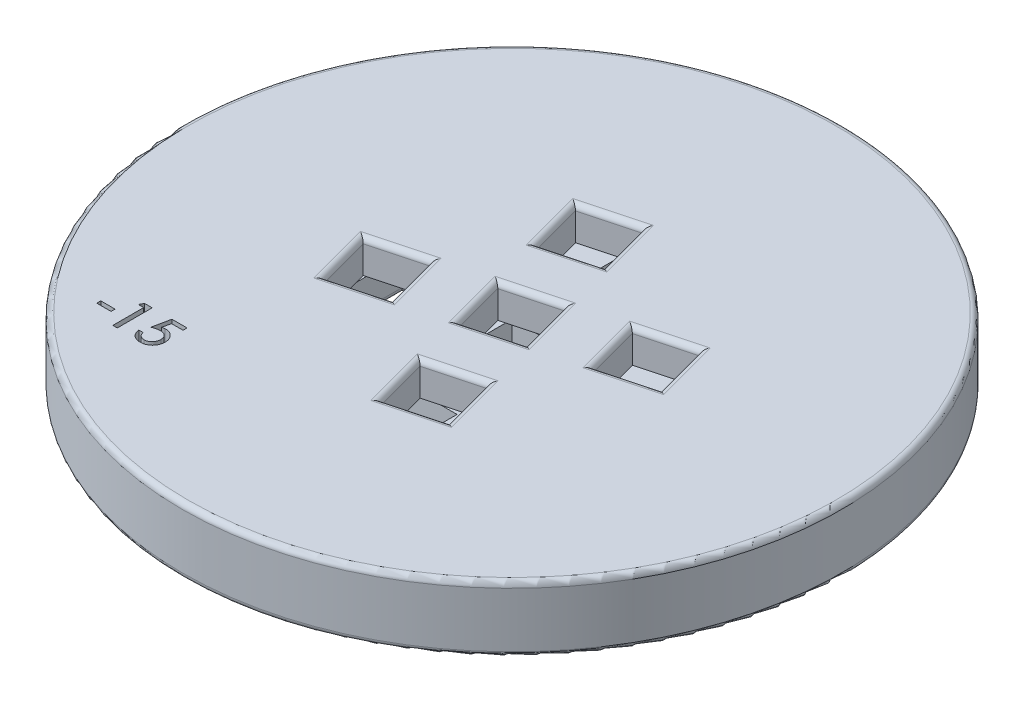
ISO-10303-21;
HEADER;
FILE_DESCRIPTION(('STEP AP214'),'2;1');
FILE_NAME('part.step','',(''),(''),'','','');
FILE_SCHEMA(('AUTOMOTIVE_DESIGN { 1 0 10303 214 1 1 1 1 }'));
ENDSEC;
DATA;
#1=APPLICATION_CONTEXT('core data for automotive mechanical design processes');
#2=APPLICATION_PROTOCOL_DEFINITION('international standard','automotive_design',2000,#1);
#3=PRODUCT_CONTEXT('',#1,'mechanical');
#4=PRODUCT('Part','Part','',(#3));
#5=PRODUCT_RELATED_PRODUCT_CATEGORY('part','',(#4));
#6=PRODUCT_DEFINITION_FORMATION('','',#4);
#7=PRODUCT_DEFINITION_CONTEXT('part definition',#1,'design');
#8=PRODUCT_DEFINITION('design','',#6,#7);
#9=PRODUCT_DEFINITION_SHAPE('','',#8);
#10=(LENGTH_UNIT() NAMED_UNIT(*) SI_UNIT(.MILLI.,.METRE.));
#11=(NAMED_UNIT(*) PLANE_ANGLE_UNIT() SI_UNIT($,.RADIAN.));
#12=(NAMED_UNIT(*) SI_UNIT($,.STERADIAN.) SOLID_ANGLE_UNIT());
#13=UNCERTAINTY_MEASURE_WITH_UNIT(LENGTH_MEASURE(1.E-05),#10,'distance_accuracy_value','');
#14=(GEOMETRIC_REPRESENTATION_CONTEXT(3) GLOBAL_UNCERTAINTY_ASSIGNED_CONTEXT((#13)) GLOBAL_UNIT_ASSIGNED_CONTEXT((#10,
#11,#12)) REPRESENTATION_CONTEXT('',''));
#15=CARTESIAN_POINT('',(0.,0.,0.));
#16=DIRECTION('',(0.,0.,1.));
#17=DIRECTION('',(1.,0.,0.));
#18=AXIS2_PLACEMENT_3D('',#15,#16,#17);
#19=CARTESIAN_POINT('',(0.,3.,0.));
#20=DIRECTION('',(0.,-1.,0.));
#21=DIRECTION('',(0.,0.,-1.));
#22=AXIS2_PLACEMENT_3D('',#19,#20,#21);
#23=PLANE('',#22);
#24=DIRECTION('',(0.,0.,-1.));
#25=VECTOR('',#24,1.);
#26=CARTESIAN_POINT('',(-12.5,3.,-2.5));
#27=LINE('',#26,#25);
#28=CARTESIAN_POINT('',(-12.5,3.,2.5));
#29=VERTEX_POINT('',#28);
#30=CARTESIAN_POINT('',(-12.5,3.,1.64565621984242));
#31=VERTEX_POINT('',#30);
#32=EDGE_CURVE('E1536',#29,#31,#27,.T.);
#33=ORIENTED_EDGE('',*,*,#32,.T.);
#34=DIRECTION('',(0.258819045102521,0.,0.965925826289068));
#35=VECTOR('',#34,1.);
#36=CARTESIAN_POINT('',(-11.427025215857,3.,5.65005262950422));
#37=LINE('',#36,#35);
#38=CARTESIAN_POINT('',(-12.2710792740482,3.,2.5));
#39=VERTEX_POINT('',#38);
#40=EDGE_CURVE('E639',#31,#39,#37,.T.);
#41=ORIENTED_EDGE('',*,*,#40,.T.);
#42=DIRECTION('',(-1.,0.,0.));
#43=VECTOR('',#42,1.);
#44=CARTESIAN_POINT('',(-7.5,3.,2.5));
#45=LINE('',#44,#43);
#46=EDGE_CURVE('E1528',#39,#29,#45,.T.);
#47=ORIENTED_EDGE('',*,*,#46,.T.);
#48=EDGE_LOOP('',(#33,#41,#47));
#49=FACE_BOUND('',#48,.T.);
#50=ADVANCED_FACE('F33',(#49),#23,.T.);
#51=DIRECTION('',(-0.258819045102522,0.,-0.965925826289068));
#52=VECTOR('',#51,1.);
#53=CARTESIAN_POINT('',(-6.5973960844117,3.,4.35595740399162));
#54=LINE('',#53,#52);
#55=CARTESIAN_POINT('',(-7.49999999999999,3.,0.987393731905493));
#56=VERTEX_POINT('',#55);
#57=CARTESIAN_POINT('',(-7.8914913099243,3.,-0.473671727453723));
#58=VERTEX_POINT('',#57);
#59=EDGE_CURVE('E655',#56,#58,#54,.T.);
#60=ORIENTED_EDGE('',*,*,#59,.T.);
#61=DIRECTION('',(-0.965925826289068,0.,0.258819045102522));
#62=VECTOR('',#61,1.);
#63=CARTESIAN_POINT('',(-12.7211204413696,3.,0.820423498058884));
#64=LINE('',#63,#62);
#65=CARTESIAN_POINT('',(-12.5,3.,0.761174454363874));
#66=VERTEX_POINT('',#65);
#67=EDGE_CURVE('E651',#58,#66,#64,.T.);
#68=ORIENTED_EDGE('',*,*,#67,.T.);
#69=CARTESIAN_POINT('',(-12.5,3.,-2.5));
#70=VERTEX_POINT('',#69);
#71=EDGE_CURVE('E1540',#66,#70,#27,.T.);
#72=ORIENTED_EDGE('',*,*,#71,.T.);
#73=DIRECTION('',(1.,0.,0.));
#74=VECTOR('',#73,1.);
#75=CARTESIAN_POINT('',(-7.5,3.,-2.5));
#76=LINE('',#75,#74);
#77=CARTESIAN_POINT('',(-7.5,3.,-2.5));
#78=VERTEX_POINT('',#77);
#79=EDGE_CURVE('E1533',#70,#78,#76,.T.);
#80=ORIENTED_EDGE('',*,*,#79,.T.);
#81=DIRECTION('',(0.,0.,1.));
#82=VECTOR('',#81,1.);
#83=CARTESIAN_POINT('',(-7.5,3.,-2.5));
#84=LINE('',#83,#82);
#85=EDGE_CURVE('E1529',#78,#56,#84,.T.);
#86=ORIENTED_EDGE('',*,*,#85,.T.);
#87=EDGE_LOOP('',(#60,#68,#72,#80,#86));
#88=FACE_BOUND('',#87,.T.);
#89=ADVANCED_FACE('F911',(#88),#23,.T.);
#90=CARTESIAN_POINT('',(0.,3.,0.));
#91=DIRECTION('',(0.,-1.,0.));
#92=DIRECTION('',(0.,0.,-1.));
#93=AXIS2_PLACEMENT_3D('',#90,#91,#92);
#94=PLANE('',#93);
#95=DIRECTION('',(0.,0.,1.));
#96=VECTOR('',#95,1.);
#97=CARTESIAN_POINT('',(12.5,3.,-2.49999999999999));
#98=LINE('',#97,#96);
#99=CARTESIAN_POINT('',(12.5,3.,-2.49999999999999));
#100=VERTEX_POINT('',#99);
#101=CARTESIAN_POINT('',(12.5,3.,-1.64565621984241));
#102=VERTEX_POINT('',#101);
#103=EDGE_CURVE('E1556',#100,#102,#98,.T.);
#104=ORIENTED_EDGE('',*,*,#103,.T.);
#105=DIRECTION('',(-0.258819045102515,0.,-0.96592582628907));
#106=VECTOR('',#105,1.);
#107=CARTESIAN_POINT('',(12.7211204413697,3.,-0.820423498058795));
#108=LINE('',#107,#106);
#109=CARTESIAN_POINT('',(12.2710792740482,3.,-2.49999999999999));
#110=VERTEX_POINT('',#109);
#111=EDGE_CURVE('E675',#102,#110,#108,.T.);
#112=ORIENTED_EDGE('',*,*,#111,.T.);
#113=DIRECTION('',(1.,0.,0.));
#114=VECTOR('',#113,1.);
#115=CARTESIAN_POINT('',(12.5,3.,-2.49999999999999));
#116=LINE('',#115,#114);
#117=EDGE_CURVE('E1563',#110,#100,#116,.T.);
#118=ORIENTED_EDGE('',*,*,#117,.T.);
#119=EDGE_LOOP('',(#104,#112,#118));
#120=FACE_BOUND('',#119,.T.);
#121=ADVANCED_FACE('F907',(#120),#94,.T.);
#122=DIRECTION('',(0.258819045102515,0.,0.96592582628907));
#123=VECTOR('',#122,1.);
#124=CARTESIAN_POINT('',(7.8914913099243,3.,0.473671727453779));
#125=LINE('',#124,#123);
#126=CARTESIAN_POINT('',(7.5,3.,-0.987393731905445));
#127=VERTEX_POINT('',#126);
#128=CARTESIAN_POINT('',(7.8914913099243,3.,0.473671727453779));
#129=VERTEX_POINT('',#128);
#130=EDGE_CURVE('E678',#127,#129,#125,.T.);
#131=ORIENTED_EDGE('',*,*,#130,.T.);
#132=DIRECTION('',(0.96592582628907,0.,-0.258819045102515));
#133=VECTOR('',#132,1.);
#134=CARTESIAN_POINT('',(12.7211204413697,3.,-0.820423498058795));
#135=LINE('',#134,#133);
#136=CARTESIAN_POINT('',(12.5,3.,-0.761174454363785));
#137=VERTEX_POINT('',#136);
#138=EDGE_CURVE('E683',#129,#137,#135,.T.);
#139=ORIENTED_EDGE('',*,*,#138,.T.);
#140=CARTESIAN_POINT('',(12.5,3.,2.5));
#141=VERTEX_POINT('',#140);
#142=EDGE_CURVE('E1560',#137,#141,#98,.T.);
#143=ORIENTED_EDGE('',*,*,#142,.T.);
#144=DIRECTION('',(-1.,0.,0.));
#145=VECTOR('',#144,1.);
#146=CARTESIAN_POINT('',(12.5,3.,2.5));
#147=LINE('',#146,#145);
#148=CARTESIAN_POINT('',(7.5,3.,2.5));
#149=VERTEX_POINT('',#148);
#150=EDGE_CURVE('E1545',#141,#149,#147,.T.);
#151=ORIENTED_EDGE('',*,*,#150,.T.);
#152=DIRECTION('',(0.,0.,-1.));
#153=VECTOR('',#152,1.);
#154=CARTESIAN_POINT('',(7.5,3.,-2.49999999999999));
#155=LINE('',#154,#153);
#156=EDGE_CURVE('E1564',#149,#127,#155,.T.);
#157=ORIENTED_EDGE('',*,*,#156,.T.);
#158=EDGE_LOOP('',(#131,#139,#143,#151,#157));
#159=FACE_BOUND('',#158,.T.);
#160=ADVANCED_FACE('F910',(#159),#94,.T.);
#161=CARTESIAN_POINT('',(0.,3.,0.));
#162=DIRECTION('',(0.,-1.,0.));
#163=DIRECTION('',(0.,0.,-1.));
#164=AXIS2_PLACEMENT_3D('',#161,#162,#163);
#165=PLANE('',#164);
#166=DIRECTION('',(-1.,0.,0.));
#167=VECTOR('',#166,1.);
#168=CARTESIAN_POINT('',(2.5,3.,12.5));
#169=LINE('',#168,#167);
#170=CARTESIAN_POINT('',(2.5,3.,12.5));
#171=VERTEX_POINT('',#170);
#172=CARTESIAN_POINT('',(1.64565621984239,3.,12.5));
#173=VERTEX_POINT('',#172);
#174=EDGE_CURVE('E1492',#171,#173,#169,.T.);
#175=ORIENTED_EDGE('',*,*,#174,.T.);
#176=DIRECTION('',(0.96592582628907,0.,-0.258819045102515));
#177=VECTOR('',#176,1.);
#178=CARTESIAN_POINT('',(5.65005262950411,3.,11.4270252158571));
#179=LINE('',#178,#177);
#180=CARTESIAN_POINT('',(2.5,3.,12.2710792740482));
#181=VERTEX_POINT('',#180);
#182=EDGE_CURVE('E714',#173,#181,#179,.T.);
#183=ORIENTED_EDGE('',*,*,#182,.T.);
#184=DIRECTION('',(0.,0.,1.));
#185=VECTOR('',#184,1.);
#186=CARTESIAN_POINT('',(2.5,3.,7.5));
#187=LINE('',#186,#185);
#188=EDGE_CURVE('E1507',#181,#171,#187,.T.);
#189=ORIENTED_EDGE('',*,*,#188,.T.);
#190=EDGE_LOOP('',(#175,#183,#189));
#191=FACE_BOUND('',#190,.T.);
#192=ADVANCED_FACE('F948',(#191),#165,.T.);
#193=DIRECTION('',(-0.96592582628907,0.,0.258819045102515));
#194=VECTOR('',#193,1.);
#195=CARTESIAN_POINT('',(4.35595740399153,3.,6.59739608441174));
#196=LINE('',#195,#194);
#197=CARTESIAN_POINT('',(0.987393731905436,3.,7.5));
#198=VERTEX_POINT('',#197);
#199=CARTESIAN_POINT('',(-0.473671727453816,3.,7.89149130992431));
#200=VERTEX_POINT('',#199);
#201=EDGE_CURVE('E701',#198,#200,#196,.T.);
#202=ORIENTED_EDGE('',*,*,#201,.T.);
#203=DIRECTION('',(0.258819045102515,0.,0.96592582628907));
#204=VECTOR('',#203,1.);
#205=CARTESIAN_POINT('',(0.820423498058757,3.,12.7211204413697));
#206=LINE('',#205,#204);
#207=CARTESIAN_POINT('',(0.761174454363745,3.,12.5));
#208=VERTEX_POINT('',#207);
#209=EDGE_CURVE('E706',#200,#208,#206,.T.);
#210=ORIENTED_EDGE('',*,*,#209,.T.);
#211=CARTESIAN_POINT('',(-2.5,3.,12.5));
#212=VERTEX_POINT('',#211);
#213=EDGE_CURVE('E1504',#208,#212,#169,.T.);
#214=ORIENTED_EDGE('',*,*,#213,.T.);
#215=DIRECTION('',(0.,0.,-1.));
#216=VECTOR('',#215,1.);
#217=CARTESIAN_POINT('',(-2.5,3.,7.5));
#218=LINE('',#217,#216);
#219=CARTESIAN_POINT('',(-2.5,3.,7.5));
#220=VERTEX_POINT('',#219);
#221=EDGE_CURVE('E1512',#212,#220,#218,.T.);
#222=ORIENTED_EDGE('',*,*,#221,.T.);
#223=DIRECTION('',(1.,0.,0.));
#224=VECTOR('',#223,1.);
#225=CARTESIAN_POINT('',(2.5,3.,7.5));
#226=LINE('',#225,#224);
#227=EDGE_CURVE('E1508',#220,#198,#226,.T.);
#228=ORIENTED_EDGE('',*,*,#227,.T.);
#229=EDGE_LOOP('',(#202,#210,#214,#222,#228));
#230=FACE_BOUND('',#229,.T.);
#231=ADVANCED_FACE('F887',(#230),#165,.T.);
#232=CARTESIAN_POINT('',(0.,3.,0.));
#233=DIRECTION('',(0.,-1.,0.));
#234=DIRECTION('',(0.,0.,-1.));
#235=AXIS2_PLACEMENT_3D('',#232,#233,#234);
#236=PLANE('',#235);
#237=DIRECTION('',(1.,0.,0.));
#238=VECTOR('',#237,1.);
#239=CARTESIAN_POINT('',(-2.5,3.,-12.5));
#240=LINE('',#239,#238);
#241=CARTESIAN_POINT('',(-2.5,3.,-12.5));
#242=VERTEX_POINT('',#241);
#243=CARTESIAN_POINT('',(-1.64565621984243,3.,-12.5));
#244=VERTEX_POINT('',#243);
#245=EDGE_CURVE('E1572',#242,#244,#240,.T.);
#246=ORIENTED_EDGE('',*,*,#245,.T.);
#247=DIRECTION('',(-0.965925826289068,0.,0.258819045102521));
#248=VECTOR('',#247,1.);
#249=CARTESIAN_POINT('',(-5.65005262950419,3.,-11.427025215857));
#250=LINE('',#249,#248);
#251=CARTESIAN_POINT('',(-2.5,3.,-12.2710792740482));
#252=VERTEX_POINT('',#251);
#253=EDGE_CURVE('E742',#244,#252,#250,.T.);
#254=ORIENTED_EDGE('',*,*,#253,.T.);
#255=DIRECTION('',(0.,0.,-1.));
#256=VECTOR('',#255,1.);
#257=CARTESIAN_POINT('',(-2.5,3.,-7.5));
#258=LINE('',#257,#256);
#259=EDGE_CURVE('E1587',#252,#242,#258,.T.);
#260=ORIENTED_EDGE('',*,*,#259,.T.);
#261=EDGE_LOOP('',(#246,#254,#260));
#262=FACE_BOUND('',#261,.T.);
#263=ADVANCED_FACE('F883',(#262),#236,.T.);
#264=DIRECTION('',(0.965925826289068,0.,-0.258819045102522));
#265=VECTOR('',#264,1.);
#266=CARTESIAN_POINT('',(-4.35595740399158,3.,-6.5973960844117));
#267=LINE('',#266,#265);
#268=CARTESIAN_POINT('',(-0.987393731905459,3.,-7.5));
#269=VERTEX_POINT('',#268);
#270=CARTESIAN_POINT('',(0.473671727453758,3.,-7.89149130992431));
#271=VERTEX_POINT('',#270);
#272=EDGE_CURVE('E729',#269,#271,#267,.T.);
#273=ORIENTED_EDGE('',*,*,#272,.T.);
#274=DIRECTION('',(-0.258819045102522,0.,-0.965925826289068));
#275=VECTOR('',#274,1.);
#276=CARTESIAN_POINT('',(0.473671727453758,3.,-7.89149130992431));
#277=LINE('',#276,#275);
#278=CARTESIAN_POINT('',(-0.761174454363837,3.,-12.5));
#279=VERTEX_POINT('',#278);
#280=EDGE_CURVE('E734',#271,#279,#277,.T.);
#281=ORIENTED_EDGE('',*,*,#280,.T.);
#282=CARTESIAN_POINT('',(2.5,3.,-12.5));
#283=VERTEX_POINT('',#282);
#284=EDGE_CURVE('E1584',#279,#283,#240,.T.);
#285=ORIENTED_EDGE('',*,*,#284,.T.);
#286=DIRECTION('',(0.,0.,1.));
#287=VECTOR('',#286,1.);
#288=CARTESIAN_POINT('',(2.5,3.,-7.5));
#289=LINE('',#288,#287);
#290=CARTESIAN_POINT('',(2.5,3.,-7.5));
#291=VERTEX_POINT('',#290);
#292=EDGE_CURVE('E1354',#283,#291,#289,.T.);
#293=ORIENTED_EDGE('',*,*,#292,.T.);
#294=DIRECTION('',(-1.,0.,0.));
#295=VECTOR('',#294,1.);
#296=CARTESIAN_POINT('',(-2.5,3.,-7.5));
#297=LINE('',#296,#295);
#298=EDGE_CURVE('E1588',#291,#269,#297,.T.);
#299=ORIENTED_EDGE('',*,*,#298,.T.);
#300=EDGE_LOOP('',(#273,#281,#285,#293,#299));
#301=FACE_BOUND('',#300,.T.);
#302=ADVANCED_FACE('F886',(#301),#236,.T.);
#303=CARTESIAN_POINT('',(0.,3.,0.));
#304=DIRECTION('',(0.,-1.,0.));
#305=DIRECTION('',(0.,0.,-1.));
#306=AXIS2_PLACEMENT_3D('',#303,#304,#305);
#307=PLANE('',#306);
#308=DIRECTION('',(0.,0.,-1.));
#309=VECTOR('',#308,1.);
#310=CARTESIAN_POINT('',(-2.5,3.,-2.5));
#311=LINE('',#310,#309);
#312=CARTESIAN_POINT('',(-2.5,3.,2.5));
#313=VERTEX_POINT('',#312);
#314=CARTESIAN_POINT('',(-2.50000000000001,3.,0.329131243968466));
#315=VERTEX_POINT('',#314);
#316=EDGE_CURVE('E1483',#313,#315,#311,.T.);
#317=ORIENTED_EDGE('',*,*,#316,.T.);
#318=DIRECTION('',(0.258819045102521,0.,0.965925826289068));
#319=VECTOR('',#318,1.);
#320=CARTESIAN_POINT('',(-1.76776695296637,3.,3.06186217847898));
#321=LINE('',#320,#319);
#322=CARTESIAN_POINT('',(-1.9183174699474,3.,2.5));
#323=VERTEX_POINT('',#322);
#324=EDGE_CURVE('E759',#315,#323,#321,.T.);
#325=ORIENTED_EDGE('',*,*,#324,.T.);
#326=DIRECTION('',(-1.,0.,0.));
#327=VECTOR('',#326,1.);
#328=CARTESIAN_POINT('',(2.5,3.,2.5));
#329=LINE('',#328,#327);
#330=EDGE_CURVE('E1472',#323,#313,#329,.T.);
#331=ORIENTED_EDGE('',*,*,#330,.T.);
#332=EDGE_LOOP('',(#317,#325,#331));
#333=FACE_BOUND('',#332,.T.);
#334=ADVANCED_FACE('F968',(#333),#307,.T.);
#335=DIRECTION('',(1.,0.,0.));
#336=VECTOR('',#335,1.);
#337=CARTESIAN_POINT('',(2.5,3.,-2.5));
#338=LINE('',#337,#336);
#339=CARTESIAN_POINT('',(-2.5,3.,-2.5));
#340=VERTEX_POINT('',#339);
#341=CARTESIAN_POINT('',(-0.329131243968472,3.,-2.5));
#342=VERTEX_POINT('',#341);
#343=EDGE_CURVE('E1478',#340,#342,#338,.T.);
#344=ORIENTED_EDGE('',*,*,#343,.T.);
#345=DIRECTION('',(-0.965925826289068,0.,0.258819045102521));
#346=VECTOR('',#345,1.);
#347=CARTESIAN_POINT('',(-3.06186217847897,3.,-1.76776695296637));
#348=LINE('',#347,#346);
#349=CARTESIAN_POINT('',(-2.5,3.,-1.9183174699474));
#350=VERTEX_POINT('',#349);
#351=EDGE_CURVE('E774',#342,#350,#348,.T.);
#352=ORIENTED_EDGE('',*,*,#351,.T.);
#353=EDGE_CURVE('E1487',#350,#340,#311,.T.);
#354=ORIENTED_EDGE('',*,*,#353,.T.);
#355=EDGE_LOOP('',(#344,#352,#354));
#356=FACE_BOUND('',#355,.T.);
#357=ADVANCED_FACE('F971',(#356),#307,.T.);
#358=DIRECTION('',(0.,0.,1.));
#359=VECTOR('',#358,1.);
#360=CARTESIAN_POINT('',(2.5,3.,-2.5));
#361=LINE('',#360,#359);
#362=CARTESIAN_POINT('',(2.5,3.,-2.5));
#363=VERTEX_POINT('',#362);
#364=CARTESIAN_POINT('',(2.49999999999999,3.,-0.329131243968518));
#365=VERTEX_POINT('',#364);
#366=EDGE_CURVE('E1473',#363,#365,#361,.T.);
#367=ORIENTED_EDGE('',*,*,#366,.T.);
#368=DIRECTION('',(-0.258819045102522,0.,-0.965925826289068));
#369=VECTOR('',#368,1.);
#370=CARTESIAN_POINT('',(3.06186217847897,3.,1.76776695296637));
#371=LINE('',#370,#369);
#372=CARTESIAN_POINT('',(1.9183174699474,3.,-2.5));
#373=VERTEX_POINT('',#372);
#374=EDGE_CURVE('E769',#365,#373,#371,.T.);
#375=ORIENTED_EDGE('',*,*,#374,.T.);
#376=EDGE_CURVE('E1482',#373,#363,#338,.T.);
#377=ORIENTED_EDGE('',*,*,#376,.T.);
#378=EDGE_LOOP('',(#367,#375,#377));
#379=FACE_BOUND('',#378,.T.);
#380=ADVANCED_FACE('F2753',(#379),#307,.T.);
#381=CARTESIAN_POINT('',(2.5,3.,2.5));
#382=VERTEX_POINT('',#381);
#383=CARTESIAN_POINT('',(0.329131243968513,3.,2.5));
#384=VERTEX_POINT('',#383);
#385=EDGE_CURVE('E1461',#382,#384,#329,.T.);
#386=ORIENTED_EDGE('',*,*,#385,.T.);
#387=DIRECTION('',(0.965925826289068,0.,-0.258819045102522));
#388=VECTOR('',#387,1.);
#389=CARTESIAN_POINT('',(-1.76776695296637,3.,3.06186217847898));
#390=LINE('',#389,#388);
#391=CARTESIAN_POINT('',(2.5,3.,1.9183174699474));
#392=VERTEX_POINT('',#391);
#393=EDGE_CURVE('E764',#384,#392,#390,.T.);
#394=ORIENTED_EDGE('',*,*,#393,.T.);
#395=EDGE_CURVE('E1477',#392,#382,#361,.T.);
#396=ORIENTED_EDGE('',*,*,#395,.T.);
#397=EDGE_LOOP('',(#386,#394,#396));
#398=FACE_BOUND('',#397,.T.);
#399=ADVANCED_FACE('F973',(#398),#307,.T.);
#400=CARTESIAN_POINT('',(0.,6.,0.));
#401=DIRECTION('',(0.,1.,0.));
#402=DIRECTION('',(0.,0.,1.));
#403=AXIS2_PLACEMENT_3D('',#400,#401,#402);
#404=PLANE('',#403);
#405=DIRECTION('',(-0.258819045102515,0.,-0.96592582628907));
#406=VECTOR('',#405,1.);
#407=CARTESIAN_POINT('',(13.2040833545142,6.,-0.949833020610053));
#408=LINE('',#407,#406);
#409=CARTESIAN_POINT('',(11.7805786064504,6.,-6.26242506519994));
#410=VERTEX_POINT('',#409);
#411=CARTESIAN_POINT('',(13.3334928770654,6.,-0.466870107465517));
#412=VERTEX_POINT('',#411);
#413=EDGE_CURVE('E1259',#410,#412,#408,.F.);
#414=ORIENTED_EDGE('',*,*,#413,.T.);
#415=DIRECTION('',(0.96592582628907,0.,-0.258819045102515));
#416=VECTOR('',#415,1.);
#417=CARTESIAN_POINT('',(8.02090083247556,6.,0.956634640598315));
#418=LINE('',#417,#416);
#419=CARTESIAN_POINT('',(7.53793791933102,6.,1.08604416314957));
#420=VERTEX_POINT('',#419);
#421=EDGE_CURVE('E1256',#412,#420,#418,.F.);
#422=ORIENTED_EDGE('',*,*,#421,.T.);
#423=DIRECTION('',(0.258819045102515,0.,0.96592582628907));
#424=VECTOR('',#423,1.);
#425=CARTESIAN_POINT('',(6.11443317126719,6.,-4.22654788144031));
#426=LINE('',#425,#424);
#427=CARTESIAN_POINT('',(5.98502364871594,6.,-4.70951079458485));
#428=VERTEX_POINT('',#427);
#429=EDGE_CURVE('E1261',#420,#428,#426,.F.);
#430=ORIENTED_EDGE('',*,*,#429,.T.);
#431=DIRECTION('',(-0.96592582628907,0.,0.258819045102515));
#432=VECTOR('',#431,1.);
#433=CARTESIAN_POINT('',(11.2976156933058,6.,-6.13301554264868));
#434=LINE('',#433,#432);
#435=EDGE_CURVE('E1263',#428,#410,#434,.F.);
#436=ORIENTED_EDGE('',*,*,#435,.T.);
#437=EDGE_LOOP('',(#414,#422,#430,#436));
#438=FACE_BOUND('',#437,.T.);
#439=DIRECTION('',(-0.258819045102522,0.,-0.965925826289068));
#440=VECTOR('',#439,1.);
#441=CARTESIAN_POINT('',(0.956634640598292,6.,-8.02090083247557));
#442=LINE('',#441,#440);
#443=CARTESIAN_POINT('',(-0.466870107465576,6.,-13.3334928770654));
#444=VERTEX_POINT('',#443);
#445=CARTESIAN_POINT('',(1.08604416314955,6.,-7.53793791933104));
#446=VERTEX_POINT('',#445);
#447=EDGE_CURVE('E1268',#444,#446,#442,.F.);
#448=ORIENTED_EDGE('',*,*,#447,.T.);
#449=DIRECTION('',(0.965925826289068,0.,-0.258819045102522));
#450=VECTOR('',#449,1.);
#451=CARTESIAN_POINT('',(-4.22654788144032,6.,-6.11443317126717));
#452=LINE('',#451,#450);
#453=CARTESIAN_POINT('',(-4.70951079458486,6.,-5.98502364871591));
#454=VERTEX_POINT('',#453);
#455=EDGE_CURVE('E1265',#446,#454,#452,.F.);
#456=ORIENTED_EDGE('',*,*,#455,.T.);
#457=DIRECTION('',(0.258819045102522,0.,0.965925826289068));
#458=VECTOR('',#457,1.);
#459=CARTESIAN_POINT('',(-6.13301554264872,6.,-11.2976156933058));
#460=LINE('',#459,#458);
#461=CARTESIAN_POINT('',(-6.26242506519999,6.,-11.7805786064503));
#462=VERTEX_POINT('',#461);
#463=EDGE_CURVE('E1272',#454,#462,#460,.F.);
#464=ORIENTED_EDGE('',*,*,#463,.T.);
#465=DIRECTION('',(-0.965925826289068,0.,0.258819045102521));
#466=VECTOR('',#465,1.);
#467=CARTESIAN_POINT('',(-0.949833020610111,6.,-13.2040833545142));
#468=LINE('',#467,#466);
#469=EDGE_CURVE('E1270',#462,#444,#468,.F.);
#470=ORIENTED_EDGE('',*,*,#469,.T.);
#471=EDGE_LOOP('',(#448,#456,#464,#470));
#472=FACE_BOUND('',#471,.T.);
#473=DIRECTION('',(-0.258819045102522,0.,-0.965925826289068));
#474=VECTOR('',#473,1.);
#475=CARTESIAN_POINT('',(3.54482509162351,6.,1.63835743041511));
#476=LINE('',#475,#474);
#477=CARTESIAN_POINT('',(2.12132034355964,6.,-3.67423461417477));
#478=VERTEX_POINT('',#477);
#479=CARTESIAN_POINT('',(3.67423461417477,6.,2.12132034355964));
#480=VERTEX_POINT('',#479);
#481=EDGE_CURVE('E1281',#478,#480,#476,.F.);
#482=ORIENTED_EDGE('',*,*,#481,.T.);
#483=DIRECTION('',(0.965925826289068,0.,-0.258819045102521));
#484=VECTOR('',#483,1.);
#485=CARTESIAN_POINT('',(-1.63835743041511,6.,3.54482509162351));
#486=LINE('',#485,#484);
#487=CARTESIAN_POINT('',(-2.12132034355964,6.,3.67423461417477));
#488=VERTEX_POINT('',#487);
#489=EDGE_CURVE('E1274',#480,#488,#486,.F.);
#490=ORIENTED_EDGE('',*,*,#489,.T.);
#491=DIRECTION('',(0.258819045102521,0.,0.965925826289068));
#492=VECTOR('',#491,1.);
#493=CARTESIAN_POINT('',(-3.54482509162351,6.,-1.6383574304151));
#494=LINE('',#493,#492);
#495=CARTESIAN_POINT('',(-3.67423461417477,6.,-2.12132034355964));
#496=VERTEX_POINT('',#495);
#497=EDGE_CURVE('E1277',#488,#496,#494,.F.);
#498=ORIENTED_EDGE('',*,*,#497,.T.);
#499=DIRECTION('',(-0.965925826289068,0.,0.258819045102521));
#500=VECTOR('',#499,1.);
#501=CARTESIAN_POINT('',(1.63835743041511,6.,-3.54482509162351));
#502=LINE('',#501,#500);
#503=EDGE_CURVE('E1279',#496,#478,#502,.F.);
#504=ORIENTED_EDGE('',*,*,#503,.T.);
#505=EDGE_LOOP('',(#482,#490,#498,#504));
#506=FACE_BOUND('',#505,.T.);
#507=DIRECTION('',(-0.258819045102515,0.,-0.96592582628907));
#508=VECTOR('',#507,1.);
#509=CARTESIAN_POINT('',(6.13301554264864,6.,11.2976156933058));
#510=LINE('',#509,#508);
#511=CARTESIAN_POINT('',(4.70951079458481,6.,5.98502364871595));
#512=VERTEX_POINT('',#511);
#513=CARTESIAN_POINT('',(6.2624250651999,6.,11.7805786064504));
#514=VERTEX_POINT('',#513);
#515=EDGE_CURVE('E1286',#512,#514,#510,.F.);
#516=ORIENTED_EDGE('',*,*,#515,.T.);
#517=DIRECTION('',(0.96592582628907,0.,-0.258819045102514));
#518=VECTOR('',#517,1.);
#519=CARTESIAN_POINT('',(0.949833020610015,6.,13.2040833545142));
#520=LINE('',#519,#518);
#521=CARTESIAN_POINT('',(0.466870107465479,6.,13.3334928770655));
#522=VERTEX_POINT('',#521);
#523=EDGE_CURVE('E1283',#514,#522,#520,.F.);
#524=ORIENTED_EDGE('',*,*,#523,.T.);
#525=DIRECTION('',(0.258819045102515,0.,0.96592582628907));
#526=VECTOR('',#525,1.);
#527=CARTESIAN_POINT('',(-0.956634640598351,6.,8.02090083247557));
#528=LINE('',#527,#526);
#529=CARTESIAN_POINT('',(-1.08604416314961,6.,7.53793791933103));
#530=VERTEX_POINT('',#529);
#531=EDGE_CURVE('E1290',#522,#530,#528,.F.);
#532=ORIENTED_EDGE('',*,*,#531,.T.);
#533=DIRECTION('',(-0.96592582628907,0.,0.258819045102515));
#534=VECTOR('',#533,1.);
#535=CARTESIAN_POINT('',(4.22654788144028,6.,6.1144331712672));
#536=LINE('',#535,#534);
#537=EDGE_CURVE('E1288',#530,#512,#536,.F.);
#538=ORIENTED_EDGE('',*,*,#537,.T.);
#539=EDGE_LOOP('',(#516,#524,#532,#538));
#540=FACE_BOUND('',#539,.T.);
#541=DIRECTION('',(-0.258819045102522,0.,-0.965925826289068));
#542=VECTOR('',#541,1.);
#543=CARTESIAN_POINT('',(-6.11443317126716,6.,4.22654788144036));
#544=LINE('',#543,#542);
#545=CARTESIAN_POINT('',(-7.53793791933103,6.,-1.08604416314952));
#546=VERTEX_POINT('',#545);
#547=CARTESIAN_POINT('',(-5.9850236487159,6.,4.70951079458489));
#548=VERTEX_POINT('',#547);
#549=EDGE_CURVE('E1294',#546,#548,#544,.F.);
#550=ORIENTED_EDGE('',*,*,#549,.T.);
#551=DIRECTION('',(0.965925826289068,0.,-0.258819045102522));
#552=VECTOR('',#551,1.);
#553=CARTESIAN_POINT('',(-11.2976156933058,6.,6.13301554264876));
#554=LINE('',#553,#552);
#555=CARTESIAN_POINT('',(-11.7805786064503,6.,6.26242506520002));
#556=VERTEX_POINT('',#555);
#557=EDGE_CURVE('E1292',#548,#556,#554,.F.);
#558=ORIENTED_EDGE('',*,*,#557,.T.);
#559=DIRECTION('',(0.258819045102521,0.,0.965925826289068));
#560=VECTOR('',#559,1.);
#561=CARTESIAN_POINT('',(-13.2040833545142,6.,0.949833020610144));
#562=LINE('',#561,#560);
#563=CARTESIAN_POINT('',(-13.3334928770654,6.,0.46687010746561));
#564=VERTEX_POINT('',#563);
#565=EDGE_CURVE('E1168',#556,#564,#562,.F.);
#566=ORIENTED_EDGE('',*,*,#565,.T.);
#567=DIRECTION('',(-0.965925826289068,0.,0.258819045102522));
#568=VECTOR('',#567,1.);
#569=CARTESIAN_POINT('',(-8.02090083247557,6.,-0.956634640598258));
#570=LINE('',#569,#568);
#571=EDGE_CURVE('E1296',#564,#546,#570,.F.);
#572=ORIENTED_EDGE('',*,*,#571,.T.);
#573=EDGE_LOOP('',(#550,#558,#566,#572));
#574=FACE_BOUND('',#573,.T.);
#575=DIRECTION('',(-1.,0.,0.));
#576=VECTOR('',#575,1.);
#577=CARTESIAN_POINT('',(-17.1873388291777,6.,16.3378246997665));
#578=LINE('',#577,#576);
#579=CARTESIAN_POINT('',(-17.1873388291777,6.,16.3378246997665));
#580=VERTEX_POINT('',#579);
#581=CARTESIAN_POINT('',(-17.6758003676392,6.,16.3378246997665));
#582=VERTEX_POINT('',#581);
#583=EDGE_CURVE('E1639',#580,#582,#578,.T.);
#584=ORIENTED_EDGE('',*,*,#583,.T.);
#585=DIRECTION('',(0.487957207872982,0.,-0.872867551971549));
#586=VECTOR('',#585,1.);
#587=CARTESIAN_POINT('',(-17.6758003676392,6.,16.3378246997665));
#588=LINE('',#587,#586);
#589=CARTESIAN_POINT('',(-17.4710026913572,6.,15.9714785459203));
#590=VERTEX_POINT('',#589);
#591=EDGE_CURVE('E1655',#582,#590,#588,.T.);
#592=ORIENTED_EDGE('',*,*,#591,.T.);
#593=DIRECTION('',(1.,0.,0.));
#594=VECTOR('',#593,1.);
#595=CARTESIAN_POINT('',(-17.4710026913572,6.,15.9714785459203));
#596=LINE('',#595,#594);
#597=CARTESIAN_POINT('',(-16.7802875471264,6.,15.9714785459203));
#598=VERTEX_POINT('',#597);
#599=EDGE_CURVE('E1652',#590,#598,#596,.T.);
#600=ORIENTED_EDGE('',*,*,#599,.T.);
#601=DIRECTION('',(0.,0.,1.));
#602=VECTOR('',#601,1.);
#603=CARTESIAN_POINT('',(-16.7802875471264,6.,15.9714785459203));
#604=LINE('',#603,#602);
#605=CARTESIAN_POINT('',(-16.7802875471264,6.,19.1464785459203));
#606=VERTEX_POINT('',#605);
#607=EDGE_CURVE('E1649',#598,#606,#604,.T.);
#608=ORIENTED_EDGE('',*,*,#607,.T.);
#609=DIRECTION('',(-1.,0.,0.));
#610=VECTOR('',#609,1.);
#611=CARTESIAN_POINT('',(-16.7802875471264,6.,19.1464785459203));
#612=LINE('',#611,#610);
#613=CARTESIAN_POINT('',(-17.1873388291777,6.,19.1464785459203));
#614=VERTEX_POINT('',#613);
#615=EDGE_CURVE('E1646',#606,#614,#612,.T.);
#616=ORIENTED_EDGE('',*,*,#615,.T.);
#617=DIRECTION('',(0.,0.,-1.));
#618=VECTOR('',#617,1.);
#619=CARTESIAN_POINT('',(-17.1873388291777,6.,19.1464785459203));
#620=LINE('',#619,#618);
#621=EDGE_CURVE('E1643',#614,#580,#620,.T.);
#622=ORIENTED_EDGE('',*,*,#621,.T.);
#623=EDGE_LOOP('',(#584,#592,#600,#608,#616,#622));
#624=FACE_BOUND('',#623,.T.);
#625=CARTESIAN_POINT('',(0.,6.,0.));
#626=DIRECTION('',(0.,1.,0.));
#627=DIRECTION('',(0.,0.,1.));
#628=AXIS2_PLACEMENT_3D('',#625,#626,#627);
#629=CIRCLE('',#628,29.5);
#630=CARTESIAN_POINT('',(0.,6.,29.5));
#631=VERTEX_POINT('',#630);
#632=EDGE_CURVE('E1305',#631,#631,#629,.T.);
#633=ORIENTED_EDGE('',*,*,#632,.T.);
#634=EDGE_LOOP('',(#633));
#635=FACE_BOUND('',#634,.T.);
#636=DIRECTION('',(-1.,0.,0.));
#637=VECTOR('',#636,1.);
#638=CARTESIAN_POINT('',(-18.3677875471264,6.,18.1288503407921));
#639=LINE('',#638,#637);
#640=CARTESIAN_POINT('',(-18.3677875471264,6.,18.1288503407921));
#641=VERTEX_POINT('',#640);
#642=CARTESIAN_POINT('',(-19.6703516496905,6.,18.1288503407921));
#643=VERTEX_POINT('',#642);
#644=EDGE_CURVE('E1604',#641,#643,#639,.T.);
#645=ORIENTED_EDGE('',*,*,#644,.T.);
#646=DIRECTION('',(0.,0.,-1.));
#647=VECTOR('',#646,1.);
#648=CARTESIAN_POINT('',(-19.6703516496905,6.,18.1288503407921));
#649=LINE('',#648,#647);
#650=CARTESIAN_POINT('',(-19.6703516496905,6.,17.762504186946));
#651=VERTEX_POINT('',#650);
#652=EDGE_CURVE('E1614',#643,#651,#649,.T.);
#653=ORIENTED_EDGE('',*,*,#652,.T.);
#654=DIRECTION('',(1.,0.,0.));
#655=VECTOR('',#654,1.);
#656=CARTESIAN_POINT('',(-19.6703516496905,6.,17.762504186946));
#657=LINE('',#656,#655);
#658=CARTESIAN_POINT('',(-18.3677875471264,6.,17.762504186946));
#659=VERTEX_POINT('',#658);
#660=EDGE_CURVE('E1611',#651,#659,#657,.T.);
#661=ORIENTED_EDGE('',*,*,#660,.T.);
#662=DIRECTION('',(0.,0.,1.));
#663=VECTOR('',#662,1.);
#664=CARTESIAN_POINT('',(-18.3677875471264,6.,17.762504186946));
#665=LINE('',#664,#663);
#666=EDGE_CURVE('E1608',#659,#641,#665,.T.);
#667=ORIENTED_EDGE('',*,*,#666,.T.);
#668=EDGE_LOOP('',(#645,#653,#661,#667));
#669=FACE_BOUND('',#668,.T.);
#670=DIRECTION('',(0.205457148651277,0.,-0.978666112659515));
#671=VECTOR('',#670,1.);
#672=CARTESIAN_POINT('',(-15.3149029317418,6.,17.5589785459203));
#673=LINE('',#672,#671);
#674=CARTESIAN_POINT('',(-15.3149029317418,6.,17.5589785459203));
#675=VERTEX_POINT('',#674);
#676=CARTESIAN_POINT('',(-14.9816296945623,6.,15.9714785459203));
#677=VERTEX_POINT('',#676);
#678=EDGE_CURVE('E791',#675,#677,#673,.T.);
#679=ORIENTED_EDGE('',*,*,#678,.T.);
#680=DIRECTION('',(1.,0.,0.));
#681=VECTOR('',#680,1.);
#682=CARTESIAN_POINT('',(-14.9816296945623,6.,15.9714785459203));
#683=LINE('',#682,#681);
#684=CARTESIAN_POINT('',(-13.6052875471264,6.,15.9714785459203));
#685=VERTEX_POINT('',#684);
#686=EDGE_CURVE('E778',#677,#685,#683,.T.);
#687=ORIENTED_EDGE('',*,*,#686,.T.);
#688=DIRECTION('',(0.,0.,1.));
#689=VECTOR('',#688,1.);
#690=CARTESIAN_POINT('',(-13.6052875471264,6.,15.9714785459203));
#691=LINE('',#690,#689);
#692=CARTESIAN_POINT('',(-13.6052875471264,6.,16.3378246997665));
#693=VERTEX_POINT('',#692);
#694=EDGE_CURVE('E1775',#685,#693,#691,.T.);
#695=ORIENTED_EDGE('',*,*,#694,.T.);
#696=DIRECTION('',(-1.,0.,0.));
#697=VECTOR('',#696,1.);
#698=CARTESIAN_POINT('',(-13.6052875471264,6.,16.3378246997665));
#699=LINE('',#698,#697);
#700=CARTESIAN_POINT('',(-14.6483564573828,6.,16.3378246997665));
#701=VERTEX_POINT('',#700);
#702=EDGE_CURVE('E1772',#693,#701,#699,.T.);
#703=ORIENTED_EDGE('',*,*,#702,.T.);
#704=DIRECTION('',(-0.220944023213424,0.,0.97528649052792));
#705=VECTOR('',#704,1.);
#706=CARTESIAN_POINT('',(-14.6483564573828,6.,16.3378246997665));
#707=LINE('',#706,#705);
#708=CARTESIAN_POINT('',(-14.8188091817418,6.,17.0902335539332));
#709=VERTEX_POINT('',#708);
#710=EDGE_CURVE('E1766',#701,#709,#707,.T.);
#711=ORIENTED_EDGE('',*,*,#710,.T.);
#712=CARTESIAN_POINT('',(-14.8188091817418,6.,17.0902335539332));
#713=CARTESIAN_POINT('',(-14.7989237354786,6.,17.0806501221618));
#714=CARTESIAN_POINT('',(-14.7579993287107,6.,17.0609273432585));
#715=CARTESIAN_POINT('',(-14.6895799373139,6.,17.0437427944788));
#716=CARTESIAN_POINT('',(-14.6152959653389,6.,17.0316517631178));
#717=CARTESIAN_POINT('',(-14.5634002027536,6.,17.0304412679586));
#718=CARTESIAN_POINT('',(-14.5364173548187,6.,17.0298118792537));
#719=B_SPLINE_CURVE_WITH_KNOTS('',3,(#712,#713,#714,#715,#716,#717,#718),.UNSPECIFIED.,.F.,.F.,
(4,1,1,1,4),(0.,0.226644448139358,0.466436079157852,0.722577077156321,1.),.UNSPECIFIED.);
#720=CARTESIAN_POINT('',(-14.5364173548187,6.,17.0298118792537));
#721=VERTEX_POINT('',#720);
#722=EDGE_CURVE('E1758',#709,#721,#719,.T.);
#723=ORIENTED_EDGE('',*,*,#722,.T.);
#724=CARTESIAN_POINT('',(-14.5364173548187,6.,17.0298118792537));
#725=CARTESIAN_POINT('',(-14.4982014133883,6.,17.0305115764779));
#726=CARTESIAN_POINT('',(-14.4231708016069,6.,17.0318853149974));
#727=CARTESIAN_POINT('',(-14.3138196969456,6.,17.0472363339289));
#728=CARTESIAN_POINT('',(-14.2096184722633,6.,17.0702342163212));
#729=CARTESIAN_POINT('',(-14.1114243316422,6.,17.1045427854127));
#730=CARTESIAN_POINT('',(-14.0181159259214,6.,17.1467782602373));
#731=CARTESIAN_POINT('',(-13.9307055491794,6.,17.1996298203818));
#732=CARTESIAN_POINT('',(-13.8492839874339,6.,17.2622009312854));
#733=CARTESIAN_POINT('',(-13.7739601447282,6.,17.3334261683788));
#734=CARTESIAN_POINT('',(-13.7053090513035,6.,17.4110075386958));
#735=CARTESIAN_POINT('',(-13.6463470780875,6.,17.49478787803));
#736=CARTESIAN_POINT('',(-13.595237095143,6.,17.5823196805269));
#737=CARTESIAN_POINT('',(-13.554724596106,6.,17.6751155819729));
#738=CARTESIAN_POINT('',(-13.5227155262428,6.,17.7722157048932));
#739=CARTESIAN_POINT('',(-13.499951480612,6.,17.8740258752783));
#740=CARTESIAN_POINT('',(-13.4854797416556,6.,17.9802410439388));
#741=CARTESIAN_POINT('',(-13.4839483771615,6.,18.0526929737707));
#742=CARTESIAN_POINT('',(-13.483172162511,6.,18.0894172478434));
#743=B_SPLINE_CURVE_WITH_KNOTS('',3,(#724,#725,#726,#727,#728,#729,#730,#731,#732,#733,#734,
#735,#736,#737,#738,#739,#740,#741,#742),.UNSPECIFIED.,.F.,.F.,(4,1,1,1,1,1,1,1,1,1,1,1,1,1,1,1,
4),(0.,0.0684308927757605,0.134352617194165,0.197478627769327,0.259348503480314,
0.320372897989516,0.380701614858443,0.441942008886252,0.504021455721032,0.566203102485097,
0.627233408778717,0.687310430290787,0.747520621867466,0.808306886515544,0.870237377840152,
0.934226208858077,1.),.UNSPECIFIED.);
#744=CARTESIAN_POINT('',(-13.483172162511,6.,18.0894172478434));
#745=VERTEX_POINT('',#744);
#746=EDGE_CURVE('E1750',#721,#745,#743,.T.);
#747=ORIENTED_EDGE('',*,*,#746,.T.);
#748=CARTESIAN_POINT('',(-13.483172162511,6.,18.0894172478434));
#749=CARTESIAN_POINT('',(-13.4837690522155,6.,18.1150793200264));
#750=CARTESIAN_POINT('',(-13.4849498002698,6.,18.1658432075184));
#751=CARTESIAN_POINT('',(-13.4911025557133,6.,18.2413258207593));
#752=CARTESIAN_POINT('',(-13.5028470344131,6.,18.315180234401));
#753=CARTESIAN_POINT('',(-13.5184405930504,6.,18.3879769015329));
#754=CARTESIAN_POINT('',(-13.5399272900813,6.,18.4590917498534));
#755=CARTESIAN_POINT('',(-13.5643871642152,6.,18.5294702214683));
#756=CARTESIAN_POINT('',(-13.5944380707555,6.,18.5979903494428));
#757=CARTESIAN_POINT('',(-13.6287460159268,6.,18.6646235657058));
#758=CARTESIAN_POINT('',(-13.6668104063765,6.,18.7288822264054));
#759=CARTESIAN_POINT('',(-13.7087210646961,6.,18.7899868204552));
#760=CARTESIAN_POINT('',(-13.7545737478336,6.,18.8474488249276));
#761=CARTESIAN_POINT('',(-13.8045311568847,6.,18.9007872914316));
#762=CARTESIAN_POINT('',(-13.8572277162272,6.,18.9513740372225));
#763=CARTESIAN_POINT('',(-13.9140380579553,6.,18.9978887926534));
#764=CARTESIAN_POINT('',(-13.9748007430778,6.,19.0405269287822));
#765=CARTESIAN_POINT('',(-14.038649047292,6.,19.079754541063));
#766=CARTESIAN_POINT('',(-14.1055524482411,6.,19.1151937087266));
#767=CARTESIAN_POINT('',(-14.1759041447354,6.,19.1445366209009));
#768=CARTESIAN_POINT('',(-14.2479576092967,6.,19.1711973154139));
#769=CARTESIAN_POINT('',(-14.3234948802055,6.,19.1911600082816));
#770=CARTESIAN_POINT('',(-14.401091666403,6.,19.2079578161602));
#771=CARTESIAN_POINT('',(-14.4816792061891,6.,19.2191053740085));
#772=CARTESIAN_POINT('',(-14.5646926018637,6.,19.2263733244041));
#773=CARTESIAN_POINT('',(-14.6209917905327,6.,19.2273778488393));
#774=CARTESIAN_POINT('',(-14.6496284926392,6.,19.2278888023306));
#775=B_SPLINE_CURVE_WITH_KNOTS('',3,(#748,#749,#750,#751,#752,#753,#754,#755,#756,#757,#758,
#759,#760,#761,#762,#763,#764,#765,#766,#767,#768,#769,#770,#771,#772,#773,#774),.UNSPECIFIED.,
.F.,.F.,(4,1,1,1,1,1,1,1,1,1,1,1,1,1,1,1,1,1,1,1,1,1,1,1,4),(0.,0.0421781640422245,
0.0834354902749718,0.124332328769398,0.16499253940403,0.205670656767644,0.246330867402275,
0.287365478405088,0.328500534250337,0.369428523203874,0.41001553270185,0.450169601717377,
0.490105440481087,0.530026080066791,0.570128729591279,0.610628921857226,0.651917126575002,
0.693212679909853,0.734887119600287,0.777094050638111,0.819352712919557,0.863151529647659,
0.907494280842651,0.952946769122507,1.),.UNSPECIFIED.);
#776=CARTESIAN_POINT('',(-14.6496284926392,6.,19.2278888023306));
#777=VERTEX_POINT('',#776);
#778=EDGE_CURVE('E1742',#745,#777,#775,.T.);
#779=ORIENTED_EDGE('',*,*,#778,.T.);
#780=CARTESIAN_POINT('',(-14.6496284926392,6.,19.2278888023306));
#781=CARTESIAN_POINT('',(-14.6818818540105,6.,19.2271144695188));
#782=CARTESIAN_POINT('',(-14.7455110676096,6.,19.2255868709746));
#783=CARTESIAN_POINT('',(-14.838963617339,6.,19.2147519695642));
#784=CARTESIAN_POINT('',(-14.9286160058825,6.,19.1963683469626));
#785=CARTESIAN_POINT('',(-15.0140883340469,6.,19.1700524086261));
#786=CARTESIAN_POINT('',(-15.0960165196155,6.,19.1370449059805));
#787=CARTESIAN_POINT('',(-15.1737020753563,6.,19.0962127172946));
#788=CARTESIAN_POINT('',(-15.2474468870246,6.,19.0479223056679));
#789=CARTESIAN_POINT('',(-15.3173459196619,6.,18.9930942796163));
#790=CARTESIAN_POINT('',(-15.3810965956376,6.,18.9305501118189));
#791=CARTESIAN_POINT('',(-15.4398606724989,6.,18.8632192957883));
#792=CARTESIAN_POINT('',(-15.4899281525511,6.,18.7886228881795));
#793=CARTESIAN_POINT('',(-15.5339723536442,6.,18.7088194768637));
#794=CARTESIAN_POINT('',(-15.5718160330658,6.,18.6231599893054));
#795=CARTESIAN_POINT('',(-15.6019225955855,6.,18.5314820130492));
#796=CARTESIAN_POINT('',(-15.6259963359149,6.,18.4341327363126));
#797=CARTESIAN_POINT('',(-15.6356183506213,6.,18.3668292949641));
#798=CARTESIAN_POINT('',(-15.6405439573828,6.,18.3323759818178));
#799=B_SPLINE_CURVE_WITH_KNOTS('',3,(#780,#781,#782,#783,#784,#785,#786,#787,#788,#789,#790,
#791,#792,#793,#794,#795,#796,#797,#798),.UNSPECIFIED.,.F.,.F.,(4,1,1,1,1,1,1,1,1,1,1,1,1,1,1,1,
4),(0.,0.0655981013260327,0.129411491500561,0.191065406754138,0.251494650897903,
0.311073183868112,0.370482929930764,0.429688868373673,0.490167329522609,0.550854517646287,
0.611098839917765,0.671620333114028,0.733191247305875,0.796329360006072,0.861785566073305,
0.929246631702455,1.),.UNSPECIFIED.);
#800=CARTESIAN_POINT('',(-15.6405439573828,6.,18.3323759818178));
#801=VERTEX_POINT('',#800);
#802=EDGE_CURVE('E1737',#777,#801,#799,.T.);
#803=ORIENTED_EDGE('',*,*,#802,.T.);
#804=DIRECTION('',(1.,0.,0.));
#805=VECTOR('',#804,1.);
#806=CARTESIAN_POINT('',(-15.6405439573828,6.,18.3323759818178));
#807=LINE('',#806,#805);
#808=CARTESIAN_POINT('',(-15.2430329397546,6.,18.3323759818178));
#809=VERTEX_POINT('',#808);
#810=EDGE_CURVE('E1731',#801,#809,#807,.T.);
#811=ORIENTED_EDGE('',*,*,#810,.T.);
#812=CARTESIAN_POINT('',(-15.2430329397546,6.,18.3323759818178));
#813=CARTESIAN_POINT('',(-15.2354674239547,6.,18.3656495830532));
#814=CARTESIAN_POINT('',(-15.2212651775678,6.,18.4281119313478));
#815=CARTESIAN_POINT('',(-15.1907546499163,6.,18.5132211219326));
#816=CARTESIAN_POINT('',(-15.158054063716,6.,18.5856071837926));
#817=CARTESIAN_POINT('',(-15.1180582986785,6.,18.6448064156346));
#818=CARTESIAN_POINT('',(-15.0721533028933,6.,18.6933998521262));
#819=CARTESIAN_POINT('',(-15.0212020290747,6.,18.7355803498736));
#820=CARTESIAN_POINT('',(-14.9652257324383,6.,18.7734171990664));
#821=CARTESIAN_POINT('',(-14.9036015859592,6.,18.8048250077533));
#822=CARTESIAN_POINT('',(-14.8386737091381,6.,18.8302703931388));
#823=CARTESIAN_POINT('',(-14.771211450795,6.,18.8480295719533));
#824=CARTESIAN_POINT('',(-14.7025772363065,6.,18.8591964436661));
#825=CARTESIAN_POINT('',(-14.6562421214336,6.,18.8607609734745));
#826=CARTESIAN_POINT('',(-14.6330920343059,6.,18.8615426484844));
#827=B_SPLINE_CURVE_WITH_KNOTS('',3,(#812,#813,#814,#815,#816,#817,#818,#819,#820,#821,#822,
#823,#824,#825,#826),.UNSPECIFIED.,.F.,.F.,(4,1,1,1,1,1,1,1,1,1,1,1,4),(0.,0.115454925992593,
0.21673595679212,0.305701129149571,0.383765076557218,0.457425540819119,0.531337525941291,
0.607408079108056,0.685762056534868,0.765096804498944,0.843121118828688,0.921619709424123,1.),.UNSPECIFIED.);
#828=CARTESIAN_POINT('',(-14.6330920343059,6.,18.8615426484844));
#829=VERTEX_POINT('',#828);
#830=EDGE_CURVE('E1723',#809,#829,#827,.T.);
#831=ORIENTED_EDGE('',*,*,#830,.T.);
#832=CARTESIAN_POINT('',(-14.6330920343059,6.,18.8615426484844));
#833=CARTESIAN_POINT('',(-14.6080488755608,6.,18.8607018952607));
#834=CARTESIAN_POINT('',(-14.5586058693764,6.,18.8590419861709));
#835=CARTESIAN_POINT('',(-14.4857683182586,6.,18.8491048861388));
#836=CARTESIAN_POINT('',(-14.4161085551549,6.,18.8307239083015));
#837=CARTESIAN_POINT('',(-14.3486208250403,6.,18.8068988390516));
#838=CARTESIAN_POINT('',(-14.2844839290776,6.,18.7744481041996));
#839=CARTESIAN_POINT('',(-14.2221235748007,6.,18.7365577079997));
#840=CARTESIAN_POINT('',(-14.1638136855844,6.,18.6900293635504));
#841=CARTESIAN_POINT('',(-14.1079245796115,6.,18.6382953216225));
#842=CARTESIAN_POINT('',(-14.0567357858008,6.,18.5809917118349));
#843=CARTESIAN_POINT('',(-14.0121630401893,6.,18.5190776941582));
#844=CARTESIAN_POINT('',(-13.9741405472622,6.,18.4537965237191));
#845=CARTESIAN_POINT('',(-13.9438398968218,6.,18.3847139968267));
#846=CARTESIAN_POINT('',(-13.9192483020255,6.,18.3124631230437));
#847=CARTESIAN_POINT('',(-13.9023450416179,6.,18.2365504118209));
#848=CARTESIAN_POINT('',(-13.8917991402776,6.,18.1571344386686));
#849=CARTESIAN_POINT('',(-13.8907555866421,6.,18.1030197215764));
#850=CARTESIAN_POINT('',(-13.8902234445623,6.,18.0754248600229));
#851=B_SPLINE_CURVE_WITH_KNOTS('',3,(#832,#833,#834,#835,#836,#837,#838,#839,#840,#841,#842,
#843,#844,#845,#846,#847,#848,#849,#850),.UNSPECIFIED.,.F.,.F.,(4,1,1,1,1,1,1,1,1,1,1,1,1,1,1,1,
4),(0.,0.0623438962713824,0.123086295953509,0.182468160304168,0.241388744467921,
0.300854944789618,0.361037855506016,0.422681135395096,0.486149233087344,0.550432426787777,
0.613550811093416,0.675727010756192,0.738088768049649,0.800995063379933,0.865382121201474,
0.931353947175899,1.),.UNSPECIFIED.);
#852=CARTESIAN_POINT('',(-13.8902234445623,6.,18.0754248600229));
#853=VERTEX_POINT('',#852);
#854=EDGE_CURVE('E1715',#829,#853,#851,.T.);
#855=ORIENTED_EDGE('',*,*,#854,.T.);
#856=CARTESIAN_POINT('',(-13.8902234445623,6.,18.0754248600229));
#857=CARTESIAN_POINT('',(-13.8908561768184,6.,18.0508039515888));
#858=CARTESIAN_POINT('',(-13.8920985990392,6.,18.0024587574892));
#859=CARTESIAN_POINT('',(-13.9011995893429,6.,17.9318005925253));
#860=CARTESIAN_POINT('',(-13.9156355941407,6.,17.864401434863));
#861=CARTESIAN_POINT('',(-13.9366123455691,6.,17.8008948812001));
#862=CARTESIAN_POINT('',(-13.9635771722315,6.,17.7409295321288));
#863=CARTESIAN_POINT('',(-13.9967355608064,6.,17.6848889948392));
#864=CARTESIAN_POINT('',(-14.0359864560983,6.,17.632461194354));
#865=CARTESIAN_POINT('',(-14.080127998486,6.,17.5834762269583));
#866=CARTESIAN_POINT('',(-14.1300971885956,6.,17.5397078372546));
#867=CARTESIAN_POINT('',(-14.1837494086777,6.,17.5005359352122));
#868=CARTESIAN_POINT('',(-14.2427138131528,6.,17.4688547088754));
#869=CARTESIAN_POINT('',(-14.3048639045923,6.,17.4417437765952));
#870=CARTESIAN_POINT('',(-14.3716372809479,6.,17.4219300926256));
#871=CARTESIAN_POINT('',(-14.4418377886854,6.,17.4059647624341));
#872=CARTESIAN_POINT('',(-14.5167444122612,6.,17.3982942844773));
#873=CARTESIAN_POINT('',(-14.5679940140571,6.,17.3968825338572));
#874=CARTESIAN_POINT('',(-14.5942949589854,6.,17.3961580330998));
#875=B_SPLINE_CURVE_WITH_KNOTS('',3,(#856,#857,#858,#859,#860,#861,#862,#863,#864,#865,#866,
#867,#868,#869,#870,#871,#872,#873,#874),.UNSPECIFIED.,.F.,.F.,(4,1,1,1,1,1,1,1,1,1,1,1,1,1,1,1,
4),(0.,0.0669695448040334,0.131500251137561,0.193498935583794,0.254237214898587,
0.313095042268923,0.372051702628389,0.430999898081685,0.491021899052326,0.551088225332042,
0.611433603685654,0.671322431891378,0.732820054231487,0.795581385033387,0.860520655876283,
0.928420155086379,1.),.UNSPECIFIED.);
#876=CARTESIAN_POINT('',(-14.5942949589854,6.,17.3961580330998));
#877=VERTEX_POINT('',#876);
#878=EDGE_CURVE('E1707',#853,#877,#875,.T.);
#879=ORIENTED_EDGE('',*,*,#878,.T.);
#880=CARTESIAN_POINT('',(-14.5942949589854,6.,17.3961580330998));
#881=CARTESIAN_POINT('',(-14.6167858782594,6.,17.3966977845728));
#882=CARTESIAN_POINT('',(-14.6640032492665,6.,17.3978309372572));
#883=CARTESIAN_POINT('',(-14.7378900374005,6.,17.4060244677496));
#884=CARTESIAN_POINT('',(-14.8182935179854,6.,17.4189117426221));
#885=CARTESIAN_POINT('',(-14.9050865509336,6.,17.4367355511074));
#886=CARTESIAN_POINT('',(-14.9983525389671,6.,17.4599563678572));
#887=CARTESIAN_POINT('',(-15.0982048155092,6.,17.488094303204));
#888=CARTESIAN_POINT('',(-15.2047538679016,6.,17.5209279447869));
#889=CARTESIAN_POINT('',(-15.2774498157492,6.,17.5460405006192));
#890=CARTESIAN_POINT('',(-15.3149029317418,6.,17.5589785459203));
#891=B_SPLINE_CURVE_WITH_KNOTS('',3,(#880,#881,#882,#883,#884,#885,#886,#887,#888,#889,#890),
.UNSPECIFIED.,.F.,.F.,(4,1,1,1,1,1,1,1,4),(0.,0.0909517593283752,0.190943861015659,
0.300331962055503,0.420227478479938,0.549160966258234,0.688963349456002,0.839753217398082,1.),.UNSPECIFIED.);
#892=EDGE_CURVE('E1702',#877,#675,#891,.T.);
#893=ORIENTED_EDGE('',*,*,#892,.T.);
#894=EDGE_LOOP('',(#679,#687,#695,#703,#711,#723,#747,#779,#803,#811,#831,#855,#879,#893));
#895=FACE_BOUND('',#894,.T.);
#896=ADVANCED_FACE('F990',(#438,#472,#506,#540,#574,#624,#635,#669,#895),#404,.T.);
#897=CARTESIAN_POINT('',(0.,6.,0.));
#898=DIRECTION('',(0.,-1.,0.));
#899=DIRECTION('',(0.,0.,-1.));
#900=AXIS2_PLACEMENT_3D('',#897,#898,#899);
#901=CYLINDRICAL_SURFACE('',#900,30.);
#902=CARTESIAN_POINT('',(0.,5.5,0.));
#903=DIRECTION('',(0.,1.,0.));
#904=DIRECTION('',(0.,0.,1.));
#905=AXIS2_PLACEMENT_3D('',#902,#903,#904);
#906=CIRCLE('',#905,30.);
#907=CARTESIAN_POINT('',(0.,5.5,30.));
#908=VERTEX_POINT('',#907);
#909=EDGE_CURVE('E1302',#908,#908,#906,.F.);
#910=ORIENTED_EDGE('',*,*,#909,.T.);
#911=EDGE_LOOP('',(#910));
#912=FACE_BOUND('',#911,.T.);
#913=CARTESIAN_POINT('',(0.,0.5,0.));
#914=DIRECTION('',(0.,1.,0.));
#915=DIRECTION('',(0.,0.,1.));
#916=AXIS2_PLACEMENT_3D('',#913,#914,#915);
#917=CIRCLE('',#916,30.);
#918=CARTESIAN_POINT('',(0.,0.5,30.));
#919=VERTEX_POINT('',#918);
#920=EDGE_CURVE('E1453',#919,#919,#917,.T.);
#921=ORIENTED_EDGE('',*,*,#920,.T.);
#922=EDGE_LOOP('',(#921));
#923=FACE_BOUND('',#922,.T.);
#924=ADVANCED_FACE('F993',(#912,#923),#901,.T.);
#925=CARTESIAN_POINT('',(0.,0.,0.));
#926=DIRECTION('',(0.,1.,0.));
#927=DIRECTION('',(0.,0.,1.));
#928=AXIS2_PLACEMENT_3D('',#925,#926,#927);
#929=PLANE('',#928);
#930=CARTESIAN_POINT('',(0.,0.,0.));
#931=DIRECTION('',(0.,1.,0.));
#932=DIRECTION('',(0.,0.,1.));
#933=AXIS2_PLACEMENT_3D('',#930,#931,#932);
#934=CIRCLE('',#933,29.5);
#935=CARTESIAN_POINT('',(0.,0.,29.5));
#936=VERTEX_POINT('',#935);
#937=EDGE_CURVE('E1405',#936,#936,#934,.F.);
#938=ORIENTED_EDGE('',*,*,#937,.T.);
#939=EDGE_LOOP('',(#938));
#940=FACE_BOUND('',#939,.T.);
#941=DIRECTION('',(-1.,0.,0.));
#942=VECTOR('',#941,1.);
#943=CARTESIAN_POINT('',(0.,0.,3.));
#944=LINE('',#943,#942);
#945=CARTESIAN_POINT('',(-3.,0.,3.));
#946=VERTEX_POINT('',#945);
#947=CARTESIAN_POINT('',(3.,0.,3.));
#948=VERTEX_POINT('',#947);
#949=EDGE_CURVE('E1411',#946,#948,#944,.F.);
#950=ORIENTED_EDGE('',*,*,#949,.T.);
#951=DIRECTION('',(0.,0.,1.));
#952=VECTOR('',#951,1.);
#953=CARTESIAN_POINT('',(3.,0.,0.));
#954=LINE('',#953,#952);
#955=CARTESIAN_POINT('',(3.,0.,-3.));
#956=VERTEX_POINT('',#955);
#957=EDGE_CURVE('E1408',#948,#956,#954,.F.);
#958=ORIENTED_EDGE('',*,*,#957,.T.);
#959=DIRECTION('',(1.,0.,0.));
#960=VECTOR('',#959,1.);
#961=CARTESIAN_POINT('',(0.,0.,-3.));
#962=LINE('',#961,#960);
#963=CARTESIAN_POINT('',(-3.,0.,-3.));
#964=VERTEX_POINT('',#963);
#965=EDGE_CURVE('E1415',#956,#964,#962,.F.);
#966=ORIENTED_EDGE('',*,*,#965,.T.);
#967=DIRECTION('',(0.,0.,-1.));
#968=VECTOR('',#967,1.);
#969=CARTESIAN_POINT('',(-3.,0.,0.));
#970=LINE('',#969,#968);
#971=EDGE_CURVE('E1413',#964,#946,#970,.F.);
#972=ORIENTED_EDGE('',*,*,#971,.T.);
#973=EDGE_LOOP('',(#950,#958,#966,#972));
#974=FACE_BOUND('',#973,.T.);
#975=DIRECTION('',(-1.,0.,0.));
#976=VECTOR('',#975,1.);
#977=CARTESIAN_POINT('',(0.,0.,13.));
#978=LINE('',#977,#976);
#979=CARTESIAN_POINT('',(-3.,0.,13.));
#980=VERTEX_POINT('',#979);
#981=CARTESIAN_POINT('',(3.,0.,13.));
#982=VERTEX_POINT('',#981);
#983=EDGE_CURVE('E1420',#980,#982,#978,.F.);
#984=ORIENTED_EDGE('',*,*,#983,.T.);
#985=DIRECTION('',(0.,0.,1.));
#986=VECTOR('',#985,1.);
#987=CARTESIAN_POINT('',(3.,0.,0.));
#988=LINE('',#987,#986);
#989=CARTESIAN_POINT('',(3.,0.,7.));
#990=VERTEX_POINT('',#989);
#991=EDGE_CURVE('E1417',#982,#990,#988,.F.);
#992=ORIENTED_EDGE('',*,*,#991,.T.);
#993=DIRECTION('',(1.,0.,0.));
#994=VECTOR('',#993,1.);
#995=CARTESIAN_POINT('',(0.,0.,7.));
#996=LINE('',#995,#994);
#997=CARTESIAN_POINT('',(-3.,0.,7.));
#998=VERTEX_POINT('',#997);
#999=EDGE_CURVE('E1424',#990,#998,#996,.F.);
#1000=ORIENTED_EDGE('',*,*,#999,.T.);
#1001=DIRECTION('',(0.,0.,-1.));
#1002=VECTOR('',#1001,1.);
#1003=CARTESIAN_POINT('',(-3.,0.,0.));
#1004=LINE('',#1003,#1002);
#1005=EDGE_CURVE('E1422',#998,#980,#1004,.F.);
#1006=ORIENTED_EDGE('',*,*,#1005,.T.);
#1007=EDGE_LOOP('',(#984,#992,#1000,#1006));
#1008=FACE_BOUND('',#1007,.T.);
#1009=DIRECTION('',(-1.,0.,0.));
#1010=VECTOR('',#1009,1.);
#1011=CARTESIAN_POINT('',(0.,0.,3.));
#1012=LINE('',#1011,#1010);
#1013=CARTESIAN_POINT('',(-13.,0.,3.));
#1014=VERTEX_POINT('',#1013);
#1015=CARTESIAN_POINT('',(-7.,0.,3.));
#1016=VERTEX_POINT('',#1015);
#1017=EDGE_CURVE('E1429',#1014,#1016,#1012,.F.);
#1018=ORIENTED_EDGE('',*,*,#1017,.T.);
#1019=DIRECTION('',(0.,0.,1.));
#1020=VECTOR('',#1019,1.);
#1021=CARTESIAN_POINT('',(-7.,0.,0.));
#1022=LINE('',#1021,#1020);
#1023=CARTESIAN_POINT('',(-7.,0.,-3.));
#1024=VERTEX_POINT('',#1023);
#1025=EDGE_CURVE('E1426',#1016,#1024,#1022,.F.);
#1026=ORIENTED_EDGE('',*,*,#1025,.T.);
#1027=DIRECTION('',(1.,0.,0.));
#1028=VECTOR('',#1027,1.);
#1029=CARTESIAN_POINT('',(0.,0.,-3.));
#1030=LINE('',#1029,#1028);
#1031=CARTESIAN_POINT('',(-13.,0.,-3.));
#1032=VERTEX_POINT('',#1031);
#1033=EDGE_CURVE('E1433',#1024,#1032,#1030,.F.);
#1034=ORIENTED_EDGE('',*,*,#1033,.T.);
#1035=DIRECTION('',(0.,0.,-1.));
#1036=VECTOR('',#1035,1.);
#1037=CARTESIAN_POINT('',(-13.,0.,0.));
#1038=LINE('',#1037,#1036);
#1039=EDGE_CURVE('E1431',#1032,#1014,#1038,.F.);
#1040=ORIENTED_EDGE('',*,*,#1039,.T.);
#1041=EDGE_LOOP('',(#1018,#1026,#1034,#1040));
#1042=FACE_BOUND('',#1041,.T.);
#1043=DIRECTION('',(-1.,0.,0.));
#1044=VECTOR('',#1043,1.);
#1045=CARTESIAN_POINT('',(0.,0.,3.));
#1046=LINE('',#1045,#1044);
#1047=CARTESIAN_POINT('',(7.,0.,3.));
#1048=VERTEX_POINT('',#1047);
#1049=CARTESIAN_POINT('',(13.,0.,3.));
#1050=VERTEX_POINT('',#1049);
#1051=EDGE_CURVE('E1438',#1048,#1050,#1046,.F.);
#1052=ORIENTED_EDGE('',*,*,#1051,.T.);
#1053=DIRECTION('',(0.,0.,1.));
#1054=VECTOR('',#1053,1.);
#1055=CARTESIAN_POINT('',(13.,0.,0.));
#1056=LINE('',#1055,#1054);
#1057=CARTESIAN_POINT('',(13.,0.,-2.99999999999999));
#1058=VERTEX_POINT('',#1057);
#1059=EDGE_CURVE('E1435',#1050,#1058,#1056,.F.);
#1060=ORIENTED_EDGE('',*,*,#1059,.T.);
#1061=DIRECTION('',(1.,0.,0.));
#1062=VECTOR('',#1061,1.);
#1063=CARTESIAN_POINT('',(0.,0.,-2.99999999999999));
#1064=LINE('',#1063,#1062);
#1065=CARTESIAN_POINT('',(7.,0.,-2.99999999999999));
#1066=VERTEX_POINT('',#1065);
#1067=EDGE_CURVE('E1442',#1058,#1066,#1064,.F.);
#1068=ORIENTED_EDGE('',*,*,#1067,.T.);
#1069=DIRECTION('',(0.,0.,-1.));
#1070=VECTOR('',#1069,1.);
#1071=CARTESIAN_POINT('',(7.,0.,0.));
#1072=LINE('',#1071,#1070);
#1073=EDGE_CURVE('E1440',#1066,#1048,#1072,.F.);
#1074=ORIENTED_EDGE('',*,*,#1073,.T.);
#1075=EDGE_LOOP('',(#1052,#1060,#1068,#1074));
#1076=FACE_BOUND('',#1075,.T.);
#1077=DIRECTION('',(1.,0.,0.));
#1078=VECTOR('',#1077,1.);
#1079=CARTESIAN_POINT('',(0.,0.,-13.));
#1080=LINE('',#1079,#1078);
#1081=CARTESIAN_POINT('',(3.,0.,-13.));
#1082=VERTEX_POINT('',#1081);
#1083=CARTESIAN_POINT('',(-3.,0.,-13.));
#1084=VERTEX_POINT('',#1083);
#1085=EDGE_CURVE('E1447',#1082,#1084,#1080,.F.);
#1086=ORIENTED_EDGE('',*,*,#1085,.T.);
#1087=DIRECTION('',(0.,0.,-1.));
#1088=VECTOR('',#1087,1.);
#1089=CARTESIAN_POINT('',(-3.,0.,0.));
#1090=LINE('',#1089,#1088);
#1091=CARTESIAN_POINT('',(-3.,0.,-7.));
#1092=VERTEX_POINT('',#1091);
#1093=EDGE_CURVE('E1444',#1084,#1092,#1090,.F.);
#1094=ORIENTED_EDGE('',*,*,#1093,.T.);
#1095=DIRECTION('',(-1.,0.,0.));
#1096=VECTOR('',#1095,1.);
#1097=CARTESIAN_POINT('',(0.,0.,-7.));
#1098=LINE('',#1097,#1096);
#1099=CARTESIAN_POINT('',(3.,0.,-7.));
#1100=VERTEX_POINT('',#1099);
#1101=EDGE_CURVE('E1451',#1092,#1100,#1098,.F.);
#1102=ORIENTED_EDGE('',*,*,#1101,.T.);
#1103=DIRECTION('',(0.,0.,1.));
#1104=VECTOR('',#1103,1.);
#1105=CARTESIAN_POINT('',(3.,0.,0.));
#1106=LINE('',#1105,#1104);
#1107=EDGE_CURVE('E1449',#1100,#1082,#1106,.F.);
#1108=ORIENTED_EDGE('',*,*,#1107,.T.);
#1109=EDGE_LOOP('',(#1086,#1094,#1102,#1108));
#1110=FACE_BOUND('',#1109,.T.);
#1111=ADVANCED_FACE('F988',(#940,#974,#1008,#1042,#1076,#1110),#929,.F.);
#1112=CARTESIAN_POINT('',(-2.5,3.,-2.5));
#1113=DIRECTION('',(-1.,0.,0.));
#1114=DIRECTION('',(0.,0.,1.));
#1115=AXIS2_PLACEMENT_3D('',#1112,#1113,#1114);
#1116=PLANE('',#1115);
#1117=DIRECTION('',(0.,-1.,0.));
#1118=VECTOR('',#1117,1.);
#1119=CARTESIAN_POINT('',(-2.5,3.,2.5));
#1120=LINE('',#1119,#1118);
#1121=CARTESIAN_POINT('',(-2.5,0.5,2.5));
#1122=VERTEX_POINT('',#1121);
#1123=EDGE_CURVE('E1456',#313,#1122,#1120,.T.);
#1124=ORIENTED_EDGE('',*,*,#1123,.T.);
#1125=DIRECTION('',(0.,0.,-1.));
#1126=VECTOR('',#1125,1.);
#1127=CARTESIAN_POINT('',(-2.5,0.5,-2.5));
#1128=LINE('',#1127,#1126);
#1129=CARTESIAN_POINT('',(-2.5,0.5,-2.5));
#1130=VERTEX_POINT('',#1129);
#1131=EDGE_CURVE('E1398',#1122,#1130,#1128,.T.);
#1132=ORIENTED_EDGE('',*,*,#1131,.T.);
#1133=DIRECTION('',(0.,-1.,0.));
#1134=VECTOR('',#1133,1.);
#1135=CARTESIAN_POINT('',(-2.5,3.,-2.5));
#1136=LINE('',#1135,#1134);
#1137=EDGE_CURVE('E1457',#340,#1130,#1136,.T.);
#1138=ORIENTED_EDGE('',*,*,#1137,.F.);
#1139=ORIENTED_EDGE('',*,*,#353,.F.);
#1140=EDGE_CURVE('E1486',#315,#350,#311,.T.);
#1141=ORIENTED_EDGE('',*,*,#1140,.F.);
#1142=ORIENTED_EDGE('',*,*,#316,.F.);
#1143=EDGE_LOOP('',(#1124,#1132,#1138,#1139,#1141,#1142));
#1144=FACE_BOUND('',#1143,.T.);
#1145=ADVANCED_FACE('F978',(#1144),#1116,.F.);
#1146=CARTESIAN_POINT('',(2.5,3.,2.5));
#1147=DIRECTION('',(0.,0.,1.));
#1148=DIRECTION('',(1.,0.,0.));
#1149=AXIS2_PLACEMENT_3D('',#1146,#1147,#1148);
#1150=PLANE('',#1149);
#1151=DIRECTION('',(0.,-1.,0.));
#1152=VECTOR('',#1151,1.);
#1153=CARTESIAN_POINT('',(2.5,3.,2.5));
#1154=LINE('',#1153,#1152);
#1155=CARTESIAN_POINT('',(2.5,0.5,2.5));
#1156=VERTEX_POINT('',#1155);
#1157=EDGE_CURVE('E1464',#382,#1156,#1154,.T.);
#1158=ORIENTED_EDGE('',*,*,#1157,.T.);
#1159=DIRECTION('',(-1.,0.,0.));
#1160=VECTOR('',#1159,1.);
#1161=CARTESIAN_POINT('',(2.5,0.5,2.5));
#1162=LINE('',#1161,#1160);
#1163=EDGE_CURVE('E1400',#1156,#1122,#1162,.T.);
#1164=ORIENTED_EDGE('',*,*,#1163,.T.);
#1165=ORIENTED_EDGE('',*,*,#1123,.F.);
#1166=ORIENTED_EDGE('',*,*,#330,.F.);
#1167=EDGE_CURVE('E1471',#384,#323,#329,.T.);
#1168=ORIENTED_EDGE('',*,*,#1167,.F.);
#1169=ORIENTED_EDGE('',*,*,#385,.F.);
#1170=EDGE_LOOP('',(#1158,#1164,#1165,#1166,#1168,#1169));
#1171=FACE_BOUND('',#1170,.T.);
#1172=ADVANCED_FACE('F974',(#1171),#1150,.F.);
#1173=CARTESIAN_POINT('',(2.5,3.,-2.5));
#1174=DIRECTION('',(1.,0.,0.));
#1175=DIRECTION('',(0.,0.,-1.));
#1176=AXIS2_PLACEMENT_3D('',#1173,#1174,#1175);
#1177=PLANE('',#1176);
#1178=DIRECTION('',(0.,-1.,0.));
#1179=VECTOR('',#1178,1.);
#1180=CARTESIAN_POINT('',(2.5,3.,-2.5));
#1181=LINE('',#1180,#1179);
#1182=CARTESIAN_POINT('',(2.5,0.5,-2.5));
#1183=VERTEX_POINT('',#1182);
#1184=EDGE_CURVE('E1460',#363,#1183,#1181,.T.);
#1185=ORIENTED_EDGE('',*,*,#1184,.T.);
#1186=DIRECTION('',(0.,0.,1.));
#1187=VECTOR('',#1186,1.);
#1188=CARTESIAN_POINT('',(2.5,0.5,-2.5));
#1189=LINE('',#1188,#1187);
#1190=EDGE_CURVE('E1402',#1183,#1156,#1189,.T.);
#1191=ORIENTED_EDGE('',*,*,#1190,.T.);
#1192=ORIENTED_EDGE('',*,*,#1157,.F.);
#1193=ORIENTED_EDGE('',*,*,#395,.F.);
#1194=EDGE_CURVE('E1476',#365,#392,#361,.T.);
#1195=ORIENTED_EDGE('',*,*,#1194,.F.);
#1196=ORIENTED_EDGE('',*,*,#366,.F.);
#1197=EDGE_LOOP('',(#1185,#1191,#1192,#1193,#1195,#1196));
#1198=FACE_BOUND('',#1197,.T.);
#1199=ADVANCED_FACE('F977',(#1198),#1177,.F.);
#1200=CARTESIAN_POINT('',(2.5,3.,-2.5));
#1201=DIRECTION('',(0.,0.,-1.));
#1202=DIRECTION('',(-1.,0.,0.));
#1203=AXIS2_PLACEMENT_3D('',#1200,#1201,#1202);
#1204=PLANE('',#1203);
#1205=ORIENTED_EDGE('',*,*,#1137,.T.);
#1206=DIRECTION('',(1.,0.,0.));
#1207=VECTOR('',#1206,1.);
#1208=CARTESIAN_POINT('',(2.5,0.5,-2.5));
#1209=LINE('',#1208,#1207);
#1210=EDGE_CURVE('E1396',#1130,#1183,#1209,.T.);
#1211=ORIENTED_EDGE('',*,*,#1210,.T.);
#1212=ORIENTED_EDGE('',*,*,#1184,.F.);
#1213=ORIENTED_EDGE('',*,*,#376,.F.);
#1214=EDGE_CURVE('E1481',#342,#373,#338,.T.);
#1215=ORIENTED_EDGE('',*,*,#1214,.F.);
#1216=ORIENTED_EDGE('',*,*,#343,.F.);
#1217=EDGE_LOOP('',(#1205,#1211,#1212,#1213,#1215,#1216));
#1218=FACE_BOUND('',#1217,.T.);
#1219=ADVANCED_FACE('F966',(#1218),#1204,.F.);
#1220=CARTESIAN_POINT('',(-2.5,3.,7.5));
#1221=DIRECTION('',(-1.,0.,0.));
#1222=DIRECTION('',(0.,0.,1.));
#1223=AXIS2_PLACEMENT_3D('',#1220,#1221,#1222);
#1224=PLANE('',#1223);
#1225=DIRECTION('',(0.,-1.,0.));
#1226=VECTOR('',#1225,1.);
#1227=CARTESIAN_POINT('',(-2.5,3.,12.5));
#1228=LINE('',#1227,#1226);
#1229=CARTESIAN_POINT('',(-2.5,0.5,12.5));
#1230=VERTEX_POINT('',#1229);
#1231=EDGE_CURVE('E1498',#212,#1230,#1228,.T.);
#1232=ORIENTED_EDGE('',*,*,#1231,.T.);
#1233=DIRECTION('',(0.,0.,-1.));
#1234=VECTOR('',#1233,1.);
#1235=CARTESIAN_POINT('',(-2.5,0.5,7.5));
#1236=LINE('',#1235,#1234);
#1237=CARTESIAN_POINT('',(-2.5,0.5,7.5));
#1238=VERTEX_POINT('',#1237);
#1239=EDGE_CURVE('E1389',#1230,#1238,#1236,.T.);
#1240=ORIENTED_EDGE('',*,*,#1239,.T.);
#1241=DIRECTION('',(0.,-1.,0.));
#1242=VECTOR('',#1241,1.);
#1243=CARTESIAN_POINT('',(-2.5,3.,7.5));
#1244=LINE('',#1243,#1242);
#1245=EDGE_CURVE('E1488',#220,#1238,#1244,.T.);
#1246=ORIENTED_EDGE('',*,*,#1245,.F.);
#1247=ORIENTED_EDGE('',*,*,#221,.F.);
#1248=EDGE_LOOP('',(#1232,#1240,#1246,#1247));
#1249=FACE_BOUND('',#1248,.T.);
#1250=ADVANCED_FACE('F956',(#1249),#1224,.F.);
#1251=CARTESIAN_POINT('',(2.5,3.,12.5));
#1252=DIRECTION('',(0.,0.,1.));
#1253=DIRECTION('',(1.,0.,0.));
#1254=AXIS2_PLACEMENT_3D('',#1251,#1252,#1253);
#1255=PLANE('',#1254);
#1256=DIRECTION('',(0.,-1.,0.));
#1257=VECTOR('',#1256,1.);
#1258=CARTESIAN_POINT('',(2.5,3.,12.5));
#1259=LINE('',#1258,#1257);
#1260=CARTESIAN_POINT('',(2.5,0.5,12.5));
#1261=VERTEX_POINT('',#1260);
#1262=EDGE_CURVE('E1495',#171,#1261,#1259,.T.);
#1263=ORIENTED_EDGE('',*,*,#1262,.T.);
#1264=DIRECTION('',(-1.,0.,0.));
#1265=VECTOR('',#1264,1.);
#1266=CARTESIAN_POINT('',(2.5,0.5,12.5));
#1267=LINE('',#1266,#1265);
#1268=EDGE_CURVE('E1391',#1261,#1230,#1267,.T.);
#1269=ORIENTED_EDGE('',*,*,#1268,.T.);
#1270=ORIENTED_EDGE('',*,*,#1231,.F.);
#1271=ORIENTED_EDGE('',*,*,#213,.F.);
#1272=EDGE_CURVE('E1503',#173,#208,#169,.T.);
#1273=ORIENTED_EDGE('',*,*,#1272,.F.);
#1274=ORIENTED_EDGE('',*,*,#174,.F.);
#1275=EDGE_LOOP('',(#1263,#1269,#1270,#1271,#1273,#1274));
#1276=FACE_BOUND('',#1275,.T.);
#1277=ADVANCED_FACE('F952',(#1276),#1255,.F.);
#1278=CARTESIAN_POINT('',(2.5,3.,7.5));
#1279=DIRECTION('',(1.,0.,0.));
#1280=DIRECTION('',(0.,0.,-1.));
#1281=AXIS2_PLACEMENT_3D('',#1278,#1279,#1280);
#1282=PLANE('',#1281);
#1283=DIRECTION('',(0.,-1.,0.));
#1284=VECTOR('',#1283,1.);
#1285=CARTESIAN_POINT('',(2.5,3.,7.5));
#1286=LINE('',#1285,#1284);
#1287=CARTESIAN_POINT('',(2.5,3.,7.5));
#1288=VERTEX_POINT('',#1287);
#1289=CARTESIAN_POINT('',(2.5,0.5,7.5));
#1290=VERTEX_POINT('',#1289);
#1291=EDGE_CURVE('E1491',#1288,#1290,#1286,.T.);
#1292=ORIENTED_EDGE('',*,*,#1291,.T.);
#1293=DIRECTION('',(0.,0.,1.));
#1294=VECTOR('',#1293,1.);
#1295=CARTESIAN_POINT('',(2.5,0.5,7.5));
#1296=LINE('',#1295,#1294);
#1297=EDGE_CURVE('E1393',#1290,#1261,#1296,.T.);
#1298=ORIENTED_EDGE('',*,*,#1297,.T.);
#1299=ORIENTED_EDGE('',*,*,#1262,.F.);
#1300=ORIENTED_EDGE('',*,*,#188,.F.);
#1301=EDGE_CURVE('E1505',#1288,#181,#187,.T.);
#1302=ORIENTED_EDGE('',*,*,#1301,.F.);
#1303=EDGE_LOOP('',(#1292,#1298,#1299,#1300,#1302));
#1304=FACE_BOUND('',#1303,.T.);
#1305=ADVANCED_FACE('F955',(#1304),#1282,.F.);
#1306=CARTESIAN_POINT('',(2.5,3.,7.5));
#1307=DIRECTION('',(0.,0.,-1.));
#1308=DIRECTION('',(-1.,0.,0.));
#1309=AXIS2_PLACEMENT_3D('',#1306,#1307,#1308);
#1310=PLANE('',#1309);
#1311=ORIENTED_EDGE('',*,*,#1245,.T.);
#1312=DIRECTION('',(1.,0.,0.));
#1313=VECTOR('',#1312,1.);
#1314=CARTESIAN_POINT('',(2.5,0.5,7.5));
#1315=LINE('',#1314,#1313);
#1316=EDGE_CURVE('E1387',#1238,#1290,#1315,.T.);
#1317=ORIENTED_EDGE('',*,*,#1316,.T.);
#1318=ORIENTED_EDGE('',*,*,#1291,.F.);
#1319=EDGE_CURVE('E1511',#198,#1288,#226,.T.);
#1320=ORIENTED_EDGE('',*,*,#1319,.F.);
#1321=ORIENTED_EDGE('',*,*,#227,.F.);
#1322=EDGE_LOOP('',(#1311,#1317,#1318,#1320,#1321));
#1323=FACE_BOUND('',#1322,.T.);
#1324=ADVANCED_FACE('F946',(#1323),#1310,.F.);
#1325=CARTESIAN_POINT('',(-12.5,3.,-2.5));
#1326=DIRECTION('',(-1.,0.,0.));
#1327=DIRECTION('',(0.,0.,1.));
#1328=AXIS2_PLACEMENT_3D('',#1325,#1326,#1327);
#1329=PLANE('',#1328);
#1330=DIRECTION('',(0.,-1.,0.));
#1331=VECTOR('',#1330,1.);
#1332=CARTESIAN_POINT('',(-12.5,3.,2.5));
#1333=LINE('',#1332,#1331);
#1334=CARTESIAN_POINT('',(-12.5,0.5,2.5));
#1335=VERTEX_POINT('',#1334);
#1336=EDGE_CURVE('E1515',#29,#1335,#1333,.T.);
#1337=ORIENTED_EDGE('',*,*,#1336,.T.);
#1338=DIRECTION('',(0.,0.,-1.));
#1339=VECTOR('',#1338,1.);
#1340=CARTESIAN_POINT('',(-12.5,0.5,-2.5));
#1341=LINE('',#1340,#1339);
#1342=CARTESIAN_POINT('',(-12.5,0.5,-2.5));
#1343=VERTEX_POINT('',#1342);
#1344=EDGE_CURVE('E1380',#1335,#1343,#1341,.T.);
#1345=ORIENTED_EDGE('',*,*,#1344,.T.);
#1346=DIRECTION('',(0.,-1.,0.));
#1347=VECTOR('',#1346,1.);
#1348=CARTESIAN_POINT('',(-12.5,3.,-2.5));
#1349=LINE('',#1348,#1347);
#1350=EDGE_CURVE('E1516',#70,#1343,#1349,.T.);
#1351=ORIENTED_EDGE('',*,*,#1350,.F.);
#1352=ORIENTED_EDGE('',*,*,#71,.F.);
#1353=EDGE_CURVE('E1539',#31,#66,#27,.T.);
#1354=ORIENTED_EDGE('',*,*,#1353,.F.);
#1355=ORIENTED_EDGE('',*,*,#32,.F.);
#1356=EDGE_LOOP('',(#1337,#1345,#1351,#1352,#1354,#1355));
#1357=FACE_BOUND('',#1356,.T.);
#1358=ADVANCED_FACE('F936',(#1357),#1329,.F.);
#1359=CARTESIAN_POINT('',(-7.5,3.,2.5));
#1360=DIRECTION('',(0.,0.,1.));
#1361=DIRECTION('',(1.,0.,0.));
#1362=AXIS2_PLACEMENT_3D('',#1359,#1360,#1361);
#1363=PLANE('',#1362);
#1364=DIRECTION('',(0.,-1.,0.));
#1365=VECTOR('',#1364,1.);
#1366=CARTESIAN_POINT('',(-7.5,3.,2.5));
#1367=LINE('',#1366,#1365);
#1368=CARTESIAN_POINT('',(-7.5,3.,2.5));
#1369=VERTEX_POINT('',#1368);
#1370=CARTESIAN_POINT('',(-7.5,0.5,2.5));
#1371=VERTEX_POINT('',#1370);
#1372=EDGE_CURVE('E1522',#1369,#1371,#1367,.T.);
#1373=ORIENTED_EDGE('',*,*,#1372,.T.);
#1374=DIRECTION('',(-1.,0.,0.));
#1375=VECTOR('',#1374,1.);
#1376=CARTESIAN_POINT('',(-7.5,0.5,2.5));
#1377=LINE('',#1376,#1375);
#1378=EDGE_CURVE('E1382',#1371,#1335,#1377,.T.);
#1379=ORIENTED_EDGE('',*,*,#1378,.T.);
#1380=ORIENTED_EDGE('',*,*,#1336,.F.);
#1381=ORIENTED_EDGE('',*,*,#46,.F.);
#1382=EDGE_CURVE('E636',#1369,#39,#45,.T.);
#1383=ORIENTED_EDGE('',*,*,#1382,.F.);
#1384=EDGE_LOOP('',(#1373,#1379,#1380,#1381,#1383));
#1385=FACE_BOUND('',#1384,.T.);
#1386=ADVANCED_FACE('F932',(#1385),#1363,.F.);
#1387=CARTESIAN_POINT('',(-7.5,3.,-2.5));
#1388=DIRECTION('',(1.,0.,0.));
#1389=DIRECTION('',(0.,0.,-1.));
#1390=AXIS2_PLACEMENT_3D('',#1387,#1388,#1389);
#1391=PLANE('',#1390);
#1392=DIRECTION('',(0.,-1.,0.));
#1393=VECTOR('',#1392,1.);
#1394=CARTESIAN_POINT('',(-7.5,3.,-2.5));
#1395=LINE('',#1394,#1393);
#1396=CARTESIAN_POINT('',(-7.5,0.5,-2.5));
#1397=VERTEX_POINT('',#1396);
#1398=EDGE_CURVE('E1519',#78,#1397,#1395,.T.);
#1399=ORIENTED_EDGE('',*,*,#1398,.T.);
#1400=DIRECTION('',(0.,0.,1.));
#1401=VECTOR('',#1400,1.);
#1402=CARTESIAN_POINT('',(-7.5,0.5,-2.5));
#1403=LINE('',#1402,#1401);
#1404=EDGE_CURVE('E1384',#1397,#1371,#1403,.T.);
#1405=ORIENTED_EDGE('',*,*,#1404,.T.);
#1406=ORIENTED_EDGE('',*,*,#1372,.F.);
#1407=EDGE_CURVE('E1532',#56,#1369,#84,.T.);
#1408=ORIENTED_EDGE('',*,*,#1407,.F.);
#1409=ORIENTED_EDGE('',*,*,#85,.F.);
#1410=EDGE_LOOP('',(#1399,#1405,#1406,#1408,#1409));
#1411=FACE_BOUND('',#1410,.T.);
#1412=ADVANCED_FACE('F935',(#1411),#1391,.F.);
#1413=CARTESIAN_POINT('',(-7.5,3.,-2.5));
#1414=DIRECTION('',(0.,0.,-1.));
#1415=DIRECTION('',(-1.,0.,0.));
#1416=AXIS2_PLACEMENT_3D('',#1413,#1414,#1415);
#1417=PLANE('',#1416);
#1418=ORIENTED_EDGE('',*,*,#1350,.T.);
#1419=DIRECTION('',(1.,0.,0.));
#1420=VECTOR('',#1419,1.);
#1421=CARTESIAN_POINT('',(-7.5,0.5,-2.5));
#1422=LINE('',#1421,#1420);
#1423=EDGE_CURVE('E1378',#1343,#1397,#1422,.T.);
#1424=ORIENTED_EDGE('',*,*,#1423,.T.);
#1425=ORIENTED_EDGE('',*,*,#1398,.F.);
#1426=ORIENTED_EDGE('',*,*,#79,.F.);
#1427=EDGE_LOOP('',(#1418,#1424,#1425,#1426));
#1428=FACE_BOUND('',#1427,.T.);
#1429=ADVANCED_FACE('F927',(#1428),#1417,.F.);
#1430=CARTESIAN_POINT('',(7.5,3.,-2.49999999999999));
#1431=DIRECTION('',(-1.,0.,0.));
#1432=DIRECTION('',(0.,0.,1.));
#1433=AXIS2_PLACEMENT_3D('',#1430,#1431,#1432);
#1434=PLANE('',#1433);
#1435=DIRECTION('',(0.,-1.,0.));
#1436=VECTOR('',#1435,1.);
#1437=CARTESIAN_POINT('',(7.5,3.,2.5));
#1438=LINE('',#1437,#1436);
#1439=CARTESIAN_POINT('',(7.5,0.5,2.5));
#1440=VERTEX_POINT('',#1439);
#1441=EDGE_CURVE('E1551',#149,#1440,#1438,.T.);
#1442=ORIENTED_EDGE('',*,*,#1441,.T.);
#1443=DIRECTION('',(0.,0.,-1.));
#1444=VECTOR('',#1443,1.);
#1445=CARTESIAN_POINT('',(7.5,0.5,-2.49999999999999));
#1446=LINE('',#1445,#1444);
#1447=CARTESIAN_POINT('',(7.5,0.5,-2.49999999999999));
#1448=VERTEX_POINT('',#1447);
#1449=EDGE_CURVE('E1371',#1440,#1448,#1446,.T.);
#1450=ORIENTED_EDGE('',*,*,#1449,.T.);
#1451=DIRECTION('',(0.,-1.,0.));
#1452=VECTOR('',#1451,1.);
#1453=CARTESIAN_POINT('',(7.5,3.,-2.49999999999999));
#1454=LINE('',#1453,#1452);
#1455=CARTESIAN_POINT('',(7.5,3.,-2.49999999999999));
#1456=VERTEX_POINT('',#1455);
#1457=EDGE_CURVE('E1541',#1456,#1448,#1454,.T.);
#1458=ORIENTED_EDGE('',*,*,#1457,.F.);
#1459=EDGE_CURVE('E1567',#127,#1456,#155,.T.);
#1460=ORIENTED_EDGE('',*,*,#1459,.F.);
#1461=ORIENTED_EDGE('',*,*,#156,.F.);
#1462=EDGE_LOOP('',(#1442,#1450,#1458,#1460,#1461));
#1463=FACE_BOUND('',#1462,.T.);
#1464=ADVANCED_FACE('F917',(#1463),#1434,.F.);
#1465=CARTESIAN_POINT('',(12.5,3.,2.5));
#1466=DIRECTION('',(0.,0.,1.));
#1467=DIRECTION('',(1.,0.,0.));
#1468=AXIS2_PLACEMENT_3D('',#1465,#1466,#1467);
#1469=PLANE('',#1468);
#1470=DIRECTION('',(0.,-1.,0.));
#1471=VECTOR('',#1470,1.);
#1472=CARTESIAN_POINT('',(12.5,3.,2.5));
#1473=LINE('',#1472,#1471);
#1474=CARTESIAN_POINT('',(12.5,0.5,2.5));
#1475=VERTEX_POINT('',#1474);
#1476=EDGE_CURVE('E1548',#141,#1475,#1473,.T.);
#1477=ORIENTED_EDGE('',*,*,#1476,.T.);
#1478=DIRECTION('',(-1.,0.,0.));
#1479=VECTOR('',#1478,1.);
#1480=CARTESIAN_POINT('',(12.5,0.5,2.5));
#1481=LINE('',#1480,#1479);
#1482=EDGE_CURVE('E1373',#1475,#1440,#1481,.T.);
#1483=ORIENTED_EDGE('',*,*,#1482,.T.);
#1484=ORIENTED_EDGE('',*,*,#1441,.F.);
#1485=ORIENTED_EDGE('',*,*,#150,.F.);
#1486=EDGE_LOOP('',(#1477,#1483,#1484,#1485));
#1487=FACE_BOUND('',#1486,.T.);
#1488=ADVANCED_FACE('F913',(#1487),#1469,.F.);
#1489=CARTESIAN_POINT('',(12.5,3.,-2.49999999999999));
#1490=DIRECTION('',(1.,0.,0.));
#1491=DIRECTION('',(0.,0.,-1.));
#1492=AXIS2_PLACEMENT_3D('',#1489,#1490,#1491);
#1493=PLANE('',#1492);
#1494=DIRECTION('',(0.,-1.,0.));
#1495=VECTOR('',#1494,1.);
#1496=CARTESIAN_POINT('',(12.5,3.,-2.49999999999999));
#1497=LINE('',#1496,#1495);
#1498=CARTESIAN_POINT('',(12.5,0.5,-2.49999999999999));
#1499=VERTEX_POINT('',#1498);
#1500=EDGE_CURVE('E1544',#100,#1499,#1497,.T.);
#1501=ORIENTED_EDGE('',*,*,#1500,.T.);
#1502=DIRECTION('',(0.,0.,1.));
#1503=VECTOR('',#1502,1.);
#1504=CARTESIAN_POINT('',(12.5,0.5,-2.49999999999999));
#1505=LINE('',#1504,#1503);
#1506=EDGE_CURVE('E1375',#1499,#1475,#1505,.T.);
#1507=ORIENTED_EDGE('',*,*,#1506,.T.);
#1508=ORIENTED_EDGE('',*,*,#1476,.F.);
#1509=ORIENTED_EDGE('',*,*,#142,.F.);
#1510=EDGE_CURVE('E1559',#102,#137,#98,.T.);
#1511=ORIENTED_EDGE('',*,*,#1510,.F.);
#1512=ORIENTED_EDGE('',*,*,#103,.F.);
#1513=EDGE_LOOP('',(#1501,#1507,#1508,#1509,#1511,#1512));
#1514=FACE_BOUND('',#1513,.T.);
#1515=ADVANCED_FACE('F916',(#1514),#1493,.F.);
#1516=CARTESIAN_POINT('',(12.5,3.,-2.49999999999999));
#1517=DIRECTION('',(0.,0.,-1.));
#1518=DIRECTION('',(-1.,0.,0.));
#1519=AXIS2_PLACEMENT_3D('',#1516,#1517,#1518);
#1520=PLANE('',#1519);
#1521=ORIENTED_EDGE('',*,*,#1457,.T.);
#1522=DIRECTION('',(1.,0.,0.));
#1523=VECTOR('',#1522,1.);
#1524=CARTESIAN_POINT('',(12.5,0.5,-2.49999999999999));
#1525=LINE('',#1524,#1523);
#1526=EDGE_CURVE('E1369',#1448,#1499,#1525,.T.);
#1527=ORIENTED_EDGE('',*,*,#1526,.T.);
#1528=ORIENTED_EDGE('',*,*,#1500,.F.);
#1529=ORIENTED_EDGE('',*,*,#117,.F.);
#1530=EDGE_CURVE('E1561',#1456,#110,#116,.T.);
#1531=ORIENTED_EDGE('',*,*,#1530,.F.);
#1532=EDGE_LOOP('',(#1521,#1527,#1528,#1529,#1531));
#1533=FACE_BOUND('',#1532,.T.);
#1534=ADVANCED_FACE('F905',(#1533),#1520,.F.);
#1535=CARTESIAN_POINT('',(2.5,3.,-7.5));
#1536=DIRECTION('',(1.,0.,0.));
#1537=DIRECTION('',(0.,0.,-1.));
#1538=AXIS2_PLACEMENT_3D('',#1535,#1536,#1537);
#1539=PLANE('',#1538);
#1540=DIRECTION('',(0.,-1.,0.));
#1541=VECTOR('',#1540,1.);
#1542=CARTESIAN_POINT('',(2.5,3.,-12.5));
#1543=LINE('',#1542,#1541);
#1544=CARTESIAN_POINT('',(2.5,0.5,-12.5));
#1545=VERTEX_POINT('',#1544);
#1546=EDGE_CURVE('E1578',#283,#1545,#1543,.T.);
#1547=ORIENTED_EDGE('',*,*,#1546,.T.);
#1548=DIRECTION('',(0.,0.,1.));
#1549=VECTOR('',#1548,1.);
#1550=CARTESIAN_POINT('',(2.5,0.5,-7.5));
#1551=LINE('',#1550,#1549);
#1552=CARTESIAN_POINT('',(2.5,0.5,-7.5));
#1553=VERTEX_POINT('',#1552);
#1554=EDGE_CURVE('E1362',#1545,#1553,#1551,.T.);
#1555=ORIENTED_EDGE('',*,*,#1554,.T.);
#1556=DIRECTION('',(0.,-1.,0.));
#1557=VECTOR('',#1556,1.);
#1558=CARTESIAN_POINT('',(2.5,3.,-7.5));
#1559=LINE('',#1558,#1557);
#1560=EDGE_CURVE('E1568',#291,#1553,#1559,.T.);
#1561=ORIENTED_EDGE('',*,*,#1560,.F.);
#1562=ORIENTED_EDGE('',*,*,#292,.F.);
#1563=EDGE_LOOP('',(#1547,#1555,#1561,#1562));
#1564=FACE_BOUND('',#1563,.T.);
#1565=ADVANCED_FACE('F893',(#1564),#1539,.F.);
#1566=CARTESIAN_POINT('',(-2.5,3.,-12.5));
#1567=DIRECTION('',(0.,0.,-1.));
#1568=DIRECTION('',(-1.,0.,0.));
#1569=AXIS2_PLACEMENT_3D('',#1566,#1567,#1568);
#1570=PLANE('',#1569);
#1571=DIRECTION('',(0.,-1.,0.));
#1572=VECTOR('',#1571,1.);
#1573=CARTESIAN_POINT('',(-2.5,3.,-12.5));
#1574=LINE('',#1573,#1572);
#1575=CARTESIAN_POINT('',(-2.5,0.5,-12.5));
#1576=VERTEX_POINT('',#1575);
#1577=EDGE_CURVE('E1575',#242,#1576,#1574,.T.);
#1578=ORIENTED_EDGE('',*,*,#1577,.T.);
#1579=DIRECTION('',(1.,0.,0.));
#1580=VECTOR('',#1579,1.);
#1581=CARTESIAN_POINT('',(-2.5,0.5,-12.5));
#1582=LINE('',#1581,#1580);
#1583=EDGE_CURVE('E1364',#1576,#1545,#1582,.T.);
#1584=ORIENTED_EDGE('',*,*,#1583,.T.);
#1585=ORIENTED_EDGE('',*,*,#1546,.F.);
#1586=ORIENTED_EDGE('',*,*,#284,.F.);
#1587=EDGE_CURVE('E1583',#244,#279,#240,.T.);
#1588=ORIENTED_EDGE('',*,*,#1587,.F.);
#1589=ORIENTED_EDGE('',*,*,#245,.F.);
#1590=EDGE_LOOP('',(#1578,#1584,#1585,#1586,#1588,#1589));
#1591=FACE_BOUND('',#1590,.T.);
#1592=ADVANCED_FACE('F889',(#1591),#1570,.F.);
#1593=CARTESIAN_POINT('',(-2.5,3.,-7.5));
#1594=DIRECTION('',(-1.,0.,0.));
#1595=DIRECTION('',(0.,0.,1.));
#1596=AXIS2_PLACEMENT_3D('',#1593,#1594,#1595);
#1597=PLANE('',#1596);
#1598=DIRECTION('',(0.,-1.,0.));
#1599=VECTOR('',#1598,1.);
#1600=CARTESIAN_POINT('',(-2.5,3.,-7.5));
#1601=LINE('',#1600,#1599);
#1602=CARTESIAN_POINT('',(-2.5,3.,-7.5));
#1603=VERTEX_POINT('',#1602);
#1604=CARTESIAN_POINT('',(-2.5,0.5,-7.5));
#1605=VERTEX_POINT('',#1604);
#1606=EDGE_CURVE('E1571',#1603,#1605,#1601,.T.);
#1607=ORIENTED_EDGE('',*,*,#1606,.T.);
#1608=DIRECTION('',(0.,0.,-1.));
#1609=VECTOR('',#1608,1.);
#1610=CARTESIAN_POINT('',(-2.5,0.5,-7.5));
#1611=LINE('',#1610,#1609);
#1612=EDGE_CURVE('E1366',#1605,#1576,#1611,.T.);
#1613=ORIENTED_EDGE('',*,*,#1612,.T.);
#1614=ORIENTED_EDGE('',*,*,#1577,.F.);
#1615=ORIENTED_EDGE('',*,*,#259,.F.);
#1616=EDGE_CURVE('E1585',#1603,#252,#258,.T.);
#1617=ORIENTED_EDGE('',*,*,#1616,.F.);
#1618=EDGE_LOOP('',(#1607,#1613,#1614,#1615,#1617));
#1619=FACE_BOUND('',#1618,.T.);
#1620=ADVANCED_FACE('F892',(#1619),#1597,.F.);
#1621=CARTESIAN_POINT('',(-2.5,3.,-7.5));
#1622=DIRECTION('',(0.,0.,1.));
#1623=DIRECTION('',(1.,0.,0.));
#1624=AXIS2_PLACEMENT_3D('',#1621,#1622,#1623);
#1625=PLANE('',#1624);
#1626=ORIENTED_EDGE('',*,*,#1560,.T.);
#1627=DIRECTION('',(-1.,0.,0.));
#1628=VECTOR('',#1627,1.);
#1629=CARTESIAN_POINT('',(-2.5,0.5,-7.5));
#1630=LINE('',#1629,#1628);
#1631=EDGE_CURVE('E1308',#1553,#1605,#1630,.T.);
#1632=ORIENTED_EDGE('',*,*,#1631,.T.);
#1633=ORIENTED_EDGE('',*,*,#1606,.F.);
#1634=EDGE_CURVE('E1591',#269,#1603,#297,.T.);
#1635=ORIENTED_EDGE('',*,*,#1634,.F.);
#1636=ORIENTED_EDGE('',*,*,#298,.F.);
#1637=EDGE_LOOP('',(#1626,#1632,#1633,#1635,#1636));
#1638=FACE_BOUND('',#1637,.T.);
#1639=ADVANCED_FACE('F897',(#1638),#1625,.F.);
#1640=CARTESIAN_POINT('',(0.,0.5,0.));
#1641=DIRECTION('',(0.,1.,0.));
#1642=DIRECTION('',(0.,0.,1.));
#1643=AXIS2_PLACEMENT_3D('',#1640,#1641,#1642);
#1644=TOROIDAL_SURFACE('',#1643,29.5,0.5);
#1645=ORIENTED_EDGE('',*,*,#937,.F.);
#1646=EDGE_LOOP('',(#1645));
#1647=FACE_BOUND('',#1646,.T.);
#1648=ORIENTED_EDGE('',*,*,#920,.F.);
#1649=EDGE_LOOP('',(#1648));
#1650=FACE_BOUND('',#1649,.T.);
#1651=ADVANCED_FACE('F901',(#1647,#1650),#1644,.T.);
#1652=CARTESIAN_POINT('',(-3.,0.5,-2.5));
#1653=DIRECTION('',(0.,0.,-1.));
#1654=DIRECTION('',(-1.,0.,0.));
#1655=AXIS2_PLACEMENT_3D('',#1652,#1653,#1654);
#1656=CYLINDRICAL_SURFACE('',#1655,0.5);
#1657=CARTESIAN_POINT('',(-3.,0.5,3.));
#1658=DIRECTION('',(-0.707106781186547,0.,-0.707106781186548));
#1659=DIRECTION('',(-0.707106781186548,0.,0.707106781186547));
#1660=AXIS2_PLACEMENT_3D('',#1657,#1658,#1659);
#1661=ELLIPSE('',#1660,0.707106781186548,0.5);
#1662=EDGE_CURVE('E1355',#946,#1122,#1661,.F.);
#1663=ORIENTED_EDGE('',*,*,#1662,.F.);
#1664=ORIENTED_EDGE('',*,*,#971,.F.);
#1665=CARTESIAN_POINT('',(-3.,0.5,-3.));
#1666=DIRECTION('',(0.707106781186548,0.,-0.707106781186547));
#1667=DIRECTION('',(-0.707106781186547,0.,-0.707106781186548));
#1668=AXIS2_PLACEMENT_3D('',#1665,#1666,#1667);
#1669=ELLIPSE('',#1668,0.707106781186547,0.5);
#1670=EDGE_CURVE('E1351',#1130,#964,#1669,.T.);
#1671=ORIENTED_EDGE('',*,*,#1670,.F.);
#1672=ORIENTED_EDGE('',*,*,#1131,.F.);
#1673=EDGE_LOOP('',(#1663,#1664,#1671,#1672));
#1674=FACE_BOUND('',#1673,.T.);
#1675=ADVANCED_FACE('F1003',(#1674),#1656,.T.);
#1676=CARTESIAN_POINT('',(2.5,0.5,-3.));
#1677=DIRECTION('',(1.,0.,0.));
#1678=DIRECTION('',(0.,0.,-1.));
#1679=AXIS2_PLACEMENT_3D('',#1676,#1677,#1678);
#1680=CYLINDRICAL_SURFACE('',#1679,0.5);
#1681=ORIENTED_EDGE('',*,*,#1670,.T.);
#1682=ORIENTED_EDGE('',*,*,#965,.F.);
#1683=CARTESIAN_POINT('',(3.,0.5,-3.));
#1684=DIRECTION('',(0.707106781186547,0.,0.707106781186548));
#1685=DIRECTION('',(-0.707106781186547,0.,0.707106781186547));
#1686=AXIS2_PLACEMENT_3D('',#1683,#1684,#1685);
#1687=ELLIPSE('',#1686,0.707106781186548,0.5);
#1688=EDGE_CURVE('E1358',#1183,#956,#1687,.T.);
#1689=ORIENTED_EDGE('',*,*,#1688,.F.);
#1690=ORIENTED_EDGE('',*,*,#1210,.F.);
#1691=EDGE_LOOP('',(#1681,#1682,#1689,#1690));
#1692=FACE_BOUND('',#1691,.T.);
#1693=ADVANCED_FACE('F1013',(#1692),#1680,.T.);
#1694=CARTESIAN_POINT('',(2.5,0.5,3.));
#1695=DIRECTION('',(-1.,0.,0.));
#1696=DIRECTION('',(0.,0.,1.));
#1697=AXIS2_PLACEMENT_3D('',#1694,#1695,#1696);
#1698=CYLINDRICAL_SURFACE('',#1697,0.5);
#1699=ORIENTED_EDGE('',*,*,#1662,.T.);
#1700=ORIENTED_EDGE('',*,*,#1163,.F.);
#1701=CARTESIAN_POINT('',(3.,0.5,3.));
#1702=DIRECTION('',(-0.707106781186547,0.,0.707106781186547));
#1703=DIRECTION('',(0.707106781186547,0.,0.707106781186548));
#1704=AXIS2_PLACEMENT_3D('',#1701,#1702,#1703);
#1705=ELLIPSE('',#1704,0.707106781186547,0.5);
#1706=EDGE_CURVE('E1344',#948,#1156,#1705,.F.);
#1707=ORIENTED_EDGE('',*,*,#1706,.F.);
#1708=ORIENTED_EDGE('',*,*,#949,.F.);
#1709=EDGE_LOOP('',(#1699,#1700,#1707,#1708));
#1710=FACE_BOUND('',#1709,.T.);
#1711=ADVANCED_FACE('F1009',(#1710),#1698,.T.);
#1712=CARTESIAN_POINT('',(3.,0.5,-2.5));
#1713=DIRECTION('',(0.,0.,1.));
#1714=DIRECTION('',(1.,0.,0.));
#1715=AXIS2_PLACEMENT_3D('',#1712,#1713,#1714);
#1716=CYLINDRICAL_SURFACE('',#1715,0.5);
#1717=ORIENTED_EDGE('',*,*,#1688,.T.);
#1718=ORIENTED_EDGE('',*,*,#957,.F.);
#1719=ORIENTED_EDGE('',*,*,#1706,.T.);
#1720=ORIENTED_EDGE('',*,*,#1190,.F.);
#1721=EDGE_LOOP('',(#1717,#1718,#1719,#1720));
#1722=FACE_BOUND('',#1721,.T.);
#1723=ADVANCED_FACE('F1005',(#1722),#1716,.T.);
#1724=CARTESIAN_POINT('',(-3.,0.5,7.5));
#1725=DIRECTION('',(0.,0.,-1.));
#1726=DIRECTION('',(-1.,0.,0.));
#1727=AXIS2_PLACEMENT_3D('',#1724,#1725,#1726);
#1728=CYLINDRICAL_SURFACE('',#1727,0.5);
#1729=CARTESIAN_POINT('',(-3.,0.5,13.));
#1730=DIRECTION('',(-0.707106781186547,0.,-0.707106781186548));
#1731=DIRECTION('',(-0.707106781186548,0.,0.707106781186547));
#1732=AXIS2_PLACEMENT_3D('',#1729,#1730,#1731);
#1733=ELLIPSE('',#1732,0.707106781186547,0.5);
#1734=EDGE_CURVE('E1345',#980,#1230,#1733,.F.);
#1735=ORIENTED_EDGE('',*,*,#1734,.F.);
#1736=ORIENTED_EDGE('',*,*,#1005,.F.);
#1737=CARTESIAN_POINT('',(-3.,0.5,7.));
#1738=DIRECTION('',(0.707106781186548,0.,-0.707106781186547));
#1739=DIRECTION('',(-0.707106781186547,0.,-0.707106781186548));
#1740=AXIS2_PLACEMENT_3D('',#1737,#1738,#1739);
#1741=ELLIPSE('',#1740,0.707106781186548,0.5);
#1742=EDGE_CURVE('E1341',#1238,#998,#1741,.T.);
#1743=ORIENTED_EDGE('',*,*,#1742,.F.);
#1744=ORIENTED_EDGE('',*,*,#1239,.F.);
#1745=EDGE_LOOP('',(#1735,#1736,#1743,#1744));
#1746=FACE_BOUND('',#1745,.T.);
#1747=ADVANCED_FACE('F1008',(#1746),#1728,.T.);
#1748=CARTESIAN_POINT('',(2.5,0.5,7.));
#1749=DIRECTION('',(1.,0.,0.));
#1750=DIRECTION('',(0.,0.,-1.));
#1751=AXIS2_PLACEMENT_3D('',#1748,#1749,#1750);
#1752=CYLINDRICAL_SURFACE('',#1751,0.5);
#1753=ORIENTED_EDGE('',*,*,#1742,.T.);
#1754=ORIENTED_EDGE('',*,*,#999,.F.);
#1755=CARTESIAN_POINT('',(3.,0.5,7.));
#1756=DIRECTION('',(0.707106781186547,0.,0.707106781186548));
#1757=DIRECTION('',(-0.707106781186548,0.,0.707106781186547));
#1758=AXIS2_PLACEMENT_3D('',#1755,#1756,#1757);
#1759=ELLIPSE('',#1758,0.707106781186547,0.5);
#1760=EDGE_CURVE('E1348',#1290,#990,#1759,.T.);
#1761=ORIENTED_EDGE('',*,*,#1760,.F.);
#1762=ORIENTED_EDGE('',*,*,#1316,.F.);
#1763=EDGE_LOOP('',(#1753,#1754,#1761,#1762));
#1764=FACE_BOUND('',#1763,.T.);
#1765=ADVANCED_FACE('F1029',(#1764),#1752,.T.);
#1766=CARTESIAN_POINT('',(2.5,0.5,13.));
#1767=DIRECTION('',(-1.,0.,0.));
#1768=DIRECTION('',(0.,0.,1.));
#1769=AXIS2_PLACEMENT_3D('',#1766,#1767,#1768);
#1770=CYLINDRICAL_SURFACE('',#1769,0.5);
#1771=ORIENTED_EDGE('',*,*,#1734,.T.);
#1772=ORIENTED_EDGE('',*,*,#1268,.F.);
#1773=CARTESIAN_POINT('',(3.,0.5,13.));
#1774=DIRECTION('',(-0.707106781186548,0.,0.707106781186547));
#1775=DIRECTION('',(0.707106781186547,0.,0.707106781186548));
#1776=AXIS2_PLACEMENT_3D('',#1773,#1774,#1775);
#1777=ELLIPSE('',#1776,0.707106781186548,0.5);
#1778=EDGE_CURVE('E1334',#982,#1261,#1777,.F.);
#1779=ORIENTED_EDGE('',*,*,#1778,.F.);
#1780=ORIENTED_EDGE('',*,*,#983,.F.);
#1781=EDGE_LOOP('',(#1771,#1772,#1779,#1780));
#1782=FACE_BOUND('',#1781,.T.);
#1783=ADVANCED_FACE('F1025',(#1782),#1770,.T.);
#1784=CARTESIAN_POINT('',(3.,0.5,7.5));
#1785=DIRECTION('',(0.,0.,1.));
#1786=DIRECTION('',(1.,0.,0.));
#1787=AXIS2_PLACEMENT_3D('',#1784,#1785,#1786);
#1788=CYLINDRICAL_SURFACE('',#1787,0.5);
#1789=ORIENTED_EDGE('',*,*,#1760,.T.);
#1790=ORIENTED_EDGE('',*,*,#991,.F.);
#1791=ORIENTED_EDGE('',*,*,#1778,.T.);
#1792=ORIENTED_EDGE('',*,*,#1297,.F.);
#1793=EDGE_LOOP('',(#1789,#1790,#1791,#1792));
#1794=FACE_BOUND('',#1793,.T.);
#1795=ADVANCED_FACE('F1021',(#1794),#1788,.T.);
#1796=CARTESIAN_POINT('',(-13.,0.5,-2.5));
#1797=DIRECTION('',(0.,0.,-1.));
#1798=DIRECTION('',(-1.,0.,0.));
#1799=AXIS2_PLACEMENT_3D('',#1796,#1797,#1798);
#1800=CYLINDRICAL_SURFACE('',#1799,0.5);
#1801=CARTESIAN_POINT('',(-13.,0.5,3.));
#1802=DIRECTION('',(-0.707106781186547,0.,-0.707106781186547));
#1803=DIRECTION('',(-0.707106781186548,0.,0.707106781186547));
#1804=AXIS2_PLACEMENT_3D('',#1801,#1802,#1803);
#1805=ELLIPSE('',#1804,0.707106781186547,0.5);
#1806=EDGE_CURVE('E1335',#1014,#1335,#1805,.F.);
#1807=ORIENTED_EDGE('',*,*,#1806,.F.);
#1808=ORIENTED_EDGE('',*,*,#1039,.F.);
#1809=CARTESIAN_POINT('',(-13.,0.5,-3.));
#1810=DIRECTION('',(0.707106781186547,0.,-0.707106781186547));
#1811=DIRECTION('',(-0.707106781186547,0.,-0.707106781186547));
#1812=AXIS2_PLACEMENT_3D('',#1809,#1810,#1811);
#1813=ELLIPSE('',#1812,0.707106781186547,0.5);
#1814=EDGE_CURVE('E1331',#1343,#1032,#1813,.T.);
#1815=ORIENTED_EDGE('',*,*,#1814,.F.);
#1816=ORIENTED_EDGE('',*,*,#1344,.F.);
#1817=EDGE_LOOP('',(#1807,#1808,#1815,#1816));
#1818=FACE_BOUND('',#1817,.T.);
#1819=ADVANCED_FACE('F1024',(#1818),#1800,.T.);
#1820=CARTESIAN_POINT('',(-7.5,0.5,-3.));
#1821=DIRECTION('',(1.,0.,0.));
#1822=DIRECTION('',(0.,0.,-1.));
#1823=AXIS2_PLACEMENT_3D('',#1820,#1821,#1822);
#1824=CYLINDRICAL_SURFACE('',#1823,0.5);
#1825=ORIENTED_EDGE('',*,*,#1814,.T.);
#1826=ORIENTED_EDGE('',*,*,#1033,.F.);
#1827=CARTESIAN_POINT('',(-7.,0.5,-3.));
#1828=DIRECTION('',(0.707106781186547,0.,0.707106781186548));
#1829=DIRECTION('',(-0.707106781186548,0.,0.707106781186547));
#1830=AXIS2_PLACEMENT_3D('',#1827,#1828,#1829);
#1831=ELLIPSE('',#1830,0.707106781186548,0.5);
#1832=EDGE_CURVE('E1338',#1397,#1024,#1831,.T.);
#1833=ORIENTED_EDGE('',*,*,#1832,.F.);
#1834=ORIENTED_EDGE('',*,*,#1423,.F.);
#1835=EDGE_LOOP('',(#1825,#1826,#1833,#1834));
#1836=FACE_BOUND('',#1835,.T.);
#1837=ADVANCED_FACE('F1045',(#1836),#1824,.T.);
#1838=CARTESIAN_POINT('',(-7.5,0.5,3.));
#1839=DIRECTION('',(-1.,0.,0.));
#1840=DIRECTION('',(0.,0.,1.));
#1841=AXIS2_PLACEMENT_3D('',#1838,#1839,#1840);
#1842=CYLINDRICAL_SURFACE('',#1841,0.5);
#1843=ORIENTED_EDGE('',*,*,#1806,.T.);
#1844=ORIENTED_EDGE('',*,*,#1378,.F.);
#1845=CARTESIAN_POINT('',(-7.,0.5,3.));
#1846=DIRECTION('',(-0.707106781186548,0.,0.707106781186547));
#1847=DIRECTION('',(0.707106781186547,0.,0.707106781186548));
#1848=AXIS2_PLACEMENT_3D('',#1845,#1846,#1847);
#1849=ELLIPSE('',#1848,0.707106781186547,0.5);
#1850=EDGE_CURVE('E1324',#1016,#1371,#1849,.F.);
#1851=ORIENTED_EDGE('',*,*,#1850,.F.);
#1852=ORIENTED_EDGE('',*,*,#1017,.F.);
#1853=EDGE_LOOP('',(#1843,#1844,#1851,#1852));
#1854=FACE_BOUND('',#1853,.T.);
#1855=ADVANCED_FACE('F1041',(#1854),#1842,.T.);
#1856=CARTESIAN_POINT('',(-7.,0.5,-2.5));
#1857=DIRECTION('',(0.,0.,1.));
#1858=DIRECTION('',(1.,0.,0.));
#1859=AXIS2_PLACEMENT_3D('',#1856,#1857,#1858);
#1860=CYLINDRICAL_SURFACE('',#1859,0.5);
#1861=ORIENTED_EDGE('',*,*,#1832,.T.);
#1862=ORIENTED_EDGE('',*,*,#1025,.F.);
#1863=ORIENTED_EDGE('',*,*,#1850,.T.);
#1864=ORIENTED_EDGE('',*,*,#1404,.F.);
#1865=EDGE_LOOP('',(#1861,#1862,#1863,#1864));
#1866=FACE_BOUND('',#1865,.T.);
#1867=ADVANCED_FACE('F1037',(#1866),#1860,.T.);
#1868=CARTESIAN_POINT('',(7.,0.5,-2.49999999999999));
#1869=DIRECTION('',(0.,0.,-1.));
#1870=DIRECTION('',(-1.,0.,0.));
#1871=AXIS2_PLACEMENT_3D('',#1868,#1869,#1870);
#1872=CYLINDRICAL_SURFACE('',#1871,0.5);
#1873=CARTESIAN_POINT('',(7.,0.5,3.));
#1874=DIRECTION('',(-0.707106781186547,0.,-0.707106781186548));
#1875=DIRECTION('',(-0.707106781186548,0.,0.707106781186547));
#1876=AXIS2_PLACEMENT_3D('',#1873,#1874,#1875);
#1877=ELLIPSE('',#1876,0.707106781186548,0.5);
#1878=EDGE_CURVE('E1325',#1048,#1440,#1877,.F.);
#1879=ORIENTED_EDGE('',*,*,#1878,.F.);
#1880=ORIENTED_EDGE('',*,*,#1073,.F.);
#1881=CARTESIAN_POINT('',(7.,0.5,-2.99999999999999));
#1882=DIRECTION('',(0.707106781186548,0.,-0.707106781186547));
#1883=DIRECTION('',(-0.707106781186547,0.,-0.707106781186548));
#1884=AXIS2_PLACEMENT_3D('',#1881,#1882,#1883);
#1885=ELLIPSE('',#1884,0.707106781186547,0.5);
#1886=EDGE_CURVE('E1321',#1448,#1066,#1885,.T.);
#1887=ORIENTED_EDGE('',*,*,#1886,.F.);
#1888=ORIENTED_EDGE('',*,*,#1449,.F.);
#1889=EDGE_LOOP('',(#1879,#1880,#1887,#1888));
#1890=FACE_BOUND('',#1889,.T.);
#1891=ADVANCED_FACE('F1040',(#1890),#1872,.T.);
#1892=CARTESIAN_POINT('',(12.5,0.5,-2.99999999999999));
#1893=DIRECTION('',(1.,0.,0.));
#1894=DIRECTION('',(0.,0.,-1.));
#1895=AXIS2_PLACEMENT_3D('',#1892,#1893,#1894);
#1896=CYLINDRICAL_SURFACE('',#1895,0.5);
#1897=ORIENTED_EDGE('',*,*,#1886,.T.);
#1898=ORIENTED_EDGE('',*,*,#1067,.F.);
#1899=CARTESIAN_POINT('',(13.,0.5,-2.99999999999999));
#1900=DIRECTION('',(0.707106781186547,0.,0.707106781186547));
#1901=DIRECTION('',(-0.707106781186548,0.,0.707106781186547));
#1902=AXIS2_PLACEMENT_3D('',#1899,#1900,#1901);
#1903=ELLIPSE('',#1902,0.707106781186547,0.5);
#1904=EDGE_CURVE('E1328',#1499,#1058,#1903,.T.);
#1905=ORIENTED_EDGE('',*,*,#1904,.F.);
#1906=ORIENTED_EDGE('',*,*,#1526,.F.);
#1907=EDGE_LOOP('',(#1897,#1898,#1905,#1906));
#1908=FACE_BOUND('',#1907,.T.);
#1909=ADVANCED_FACE('F1061',(#1908),#1896,.T.);
#1910=CARTESIAN_POINT('',(12.5,0.5,3.));
#1911=DIRECTION('',(-1.,0.,0.));
#1912=DIRECTION('',(0.,0.,1.));
#1913=AXIS2_PLACEMENT_3D('',#1910,#1911,#1912);
#1914=CYLINDRICAL_SURFACE('',#1913,0.5);
#1915=ORIENTED_EDGE('',*,*,#1878,.T.);
#1916=ORIENTED_EDGE('',*,*,#1482,.F.);
#1917=CARTESIAN_POINT('',(13.,0.5,3.));
#1918=DIRECTION('',(-0.707106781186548,0.,0.707106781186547));
#1919=DIRECTION('',(0.707106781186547,0.,0.707106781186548));
#1920=AXIS2_PLACEMENT_3D('',#1917,#1918,#1919);
#1921=ELLIPSE('',#1920,0.707106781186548,0.5);
#1922=EDGE_CURVE('E1312',#1050,#1475,#1921,.F.);
#1923=ORIENTED_EDGE('',*,*,#1922,.F.);
#1924=ORIENTED_EDGE('',*,*,#1051,.F.);
#1925=EDGE_LOOP('',(#1915,#1916,#1923,#1924));
#1926=FACE_BOUND('',#1925,.T.);
#1927=ADVANCED_FACE('F1057',(#1926),#1914,.T.);
#1928=CARTESIAN_POINT('',(13.,0.5,-2.49999999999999));
#1929=DIRECTION('',(0.,0.,1.));
#1930=DIRECTION('',(1.,0.,0.));
#1931=AXIS2_PLACEMENT_3D('',#1928,#1929,#1930);
#1932=CYLINDRICAL_SURFACE('',#1931,0.5);
#1933=ORIENTED_EDGE('',*,*,#1904,.T.);
#1934=ORIENTED_EDGE('',*,*,#1059,.F.);
#1935=ORIENTED_EDGE('',*,*,#1922,.T.);
#1936=ORIENTED_EDGE('',*,*,#1506,.F.);
#1937=EDGE_LOOP('',(#1933,#1934,#1935,#1936));
#1938=FACE_BOUND('',#1937,.T.);
#1939=ADVANCED_FACE('F1053',(#1938),#1932,.T.);
#1940=CARTESIAN_POINT('',(3.,0.5,-7.5));
#1941=DIRECTION('',(0.,0.,1.));
#1942=DIRECTION('',(1.,0.,0.));
#1943=AXIS2_PLACEMENT_3D('',#1940,#1941,#1942);
#1944=CYLINDRICAL_SURFACE('',#1943,0.5);
#1945=CARTESIAN_POINT('',(3.,0.5,-13.));
#1946=DIRECTION('',(0.707106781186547,0.,0.707106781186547));
#1947=DIRECTION('',(0.707106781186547,0.,-0.707106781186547));
#1948=AXIS2_PLACEMENT_3D('',#1945,#1946,#1947);
#1949=ELLIPSE('',#1948,0.707106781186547,0.5);
#1950=EDGE_CURVE('E1313',#1082,#1545,#1949,.F.);
#1951=ORIENTED_EDGE('',*,*,#1950,.F.);
#1952=ORIENTED_EDGE('',*,*,#1107,.F.);
#1953=CARTESIAN_POINT('',(3.,0.5,-7.));
#1954=DIRECTION('',(-0.707106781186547,0.,0.707106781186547));
#1955=DIRECTION('',(0.707106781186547,0.,0.707106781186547));
#1956=AXIS2_PLACEMENT_3D('',#1953,#1954,#1955);
#1957=ELLIPSE('',#1956,0.707106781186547,0.5);
#1958=EDGE_CURVE('E1309',#1553,#1100,#1957,.T.);
#1959=ORIENTED_EDGE('',*,*,#1958,.F.);
#1960=ORIENTED_EDGE('',*,*,#1554,.F.);
#1961=EDGE_LOOP('',(#1951,#1952,#1959,#1960));
#1962=FACE_BOUND('',#1961,.T.);
#1963=ADVANCED_FACE('F1056',(#1962),#1944,.T.);
#1964=CARTESIAN_POINT('',(-2.5,0.5,-7.));
#1965=DIRECTION('',(-1.,0.,0.));
#1966=DIRECTION('',(0.,0.,1.));
#1967=AXIS2_PLACEMENT_3D('',#1964,#1965,#1966);
#1968=CYLINDRICAL_SURFACE('',#1967,0.5);
#1969=ORIENTED_EDGE('',*,*,#1958,.T.);
#1970=ORIENTED_EDGE('',*,*,#1101,.F.);
#1971=CARTESIAN_POINT('',(-3.,0.5,-7.));
#1972=DIRECTION('',(-0.707106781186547,0.,-0.707106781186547));
#1973=DIRECTION('',(0.707106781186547,0.,-0.707106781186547));
#1974=AXIS2_PLACEMENT_3D('',#1971,#1972,#1973);
#1975=ELLIPSE('',#1974,0.707106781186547,0.5);
#1976=EDGE_CURVE('E1316',#1605,#1092,#1975,.T.);
#1977=ORIENTED_EDGE('',*,*,#1976,.F.);
#1978=ORIENTED_EDGE('',*,*,#1631,.F.);
#1979=EDGE_LOOP('',(#1969,#1970,#1977,#1978));
#1980=FACE_BOUND('',#1979,.T.);
#1981=ADVANCED_FACE('F1076',(#1980),#1968,.T.);
#1982=CARTESIAN_POINT('',(-2.5,0.5,-13.));
#1983=DIRECTION('',(1.,0.,0.));
#1984=DIRECTION('',(0.,0.,-1.));
#1985=AXIS2_PLACEMENT_3D('',#1982,#1983,#1984);
#1986=CYLINDRICAL_SURFACE('',#1985,0.5);
#1987=ORIENTED_EDGE('',*,*,#1950,.T.);
#1988=ORIENTED_EDGE('',*,*,#1583,.F.);
#1989=CARTESIAN_POINT('',(-3.,0.5,-13.));
#1990=DIRECTION('',(0.707106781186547,0.,-0.707106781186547));
#1991=DIRECTION('',(-0.707106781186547,0.,-0.707106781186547));
#1992=AXIS2_PLACEMENT_3D('',#1989,#1990,#1991);
#1993=ELLIPSE('',#1992,0.707106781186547,0.5);
#1994=EDGE_CURVE('E1318',#1084,#1576,#1993,.F.);
#1995=ORIENTED_EDGE('',*,*,#1994,.F.);
#1996=ORIENTED_EDGE('',*,*,#1085,.F.);
#1997=EDGE_LOOP('',(#1987,#1988,#1995,#1996));
#1998=FACE_BOUND('',#1997,.T.);
#1999=ADVANCED_FACE('F1072',(#1998),#1986,.T.);
#2000=CARTESIAN_POINT('',(-3.,0.5,-7.5));
#2001=DIRECTION('',(0.,0.,-1.));
#2002=DIRECTION('',(-1.,0.,0.));
#2003=AXIS2_PLACEMENT_3D('',#2000,#2001,#2002);
#2004=CYLINDRICAL_SURFACE('',#2003,0.5);
#2005=ORIENTED_EDGE('',*,*,#1976,.T.);
#2006=ORIENTED_EDGE('',*,*,#1093,.F.);
#2007=ORIENTED_EDGE('',*,*,#1994,.T.);
#2008=ORIENTED_EDGE('',*,*,#1612,.F.);
#2009=EDGE_LOOP('',(#2005,#2006,#2007,#2008));
#2010=FACE_BOUND('',#2009,.T.);
#2011=ADVANCED_FACE('F1069',(#2010),#2004,.T.);
#2012=CARTESIAN_POINT('',(0.,5.5,0.));
#2013=DIRECTION('',(0.,1.,0.));
#2014=DIRECTION('',(0.,0.,1.));
#2015=AXIS2_PLACEMENT_3D('',#2012,#2013,#2014);
#2016=TOROIDAL_SURFACE('',#2015,29.5,0.5);
#2017=ORIENTED_EDGE('',*,*,#909,.F.);
#2018=EDGE_LOOP('',(#2017));
#2019=FACE_BOUND('',#2018,.T.);
#2020=ORIENTED_EDGE('',*,*,#632,.F.);
#2021=EDGE_LOOP('',(#2020));
#2022=FACE_BOUND('',#2021,.T.);
#2023=ADVANCED_FACE('F881',(#2019,#2022),#2016,.T.);
#2024=CARTESIAN_POINT('',(-19.6703516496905,3.,18.1288503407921));
#2025=DIRECTION('',(1.,0.,0.));
#2026=DIRECTION('',(0.,0.,-1.));
#2027=AXIS2_PLACEMENT_3D('',#2024,#2025,#2026);
#2028=PLANE('',#2027);
#2029=ORIENTED_EDGE('',*,*,#652,.F.);
#2030=DIRECTION('',(0.,1.,0.));
#2031=VECTOR('',#2030,1.);
#2032=CARTESIAN_POINT('',(-19.6703516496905,3.,18.1288503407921));
#2033=LINE('',#2032,#2031);
#2034=CARTESIAN_POINT('',(-19.6703516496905,3.,18.1288503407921));
#2035=VERTEX_POINT('',#2034);
#2036=EDGE_CURVE('E1600',#2035,#643,#2033,.T.);
#2037=ORIENTED_EDGE('',*,*,#2036,.F.);
#2038=DIRECTION('',(0.,0.,-1.));
#2039=VECTOR('',#2038,1.);
#2040=CARTESIAN_POINT('',(-19.6703516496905,3.,18.1288503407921));
#2041=LINE('',#2040,#2039);
#2042=CARTESIAN_POINT('',(-19.6703516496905,3.,17.762504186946));
#2043=VERTEX_POINT('',#2042);
#2044=EDGE_CURVE('E1607',#2035,#2043,#2041,.T.);
#2045=ORIENTED_EDGE('',*,*,#2044,.T.);
#2046=DIRECTION('',(0.,1.,0.));
#2047=VECTOR('',#2046,1.);
#2048=CARTESIAN_POINT('',(-19.6703516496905,3.,17.762504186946));
#2049=LINE('',#2048,#2047);
#2050=EDGE_CURVE('E1320',#2043,#651,#2049,.T.);
#2051=ORIENTED_EDGE('',*,*,#2050,.T.);
#2052=EDGE_LOOP('',(#2029,#2037,#2045,#2051));
#2053=FACE_BOUND('',#2052,.T.);
#2054=ADVANCED_FACE('F877',(#2053),#2028,.T.);
#2055=CARTESIAN_POINT('',(-19.6703516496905,3.,17.762504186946));
#2056=DIRECTION('',(0.,0.,1.));
#2057=DIRECTION('',(1.,0.,0.));
#2058=AXIS2_PLACEMENT_3D('',#2055,#2056,#2057);
#2059=PLANE('',#2058);
#2060=ORIENTED_EDGE('',*,*,#660,.F.);
#2061=ORIENTED_EDGE('',*,*,#2050,.F.);
#2062=DIRECTION('',(1.,0.,0.));
#2063=VECTOR('',#2062,1.);
#2064=CARTESIAN_POINT('',(-19.6703516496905,3.,17.762504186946));
#2065=LINE('',#2064,#2063);
#2066=CARTESIAN_POINT('',(-18.3677875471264,3.,17.762504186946));
#2067=VERTEX_POINT('',#2066);
#2068=EDGE_CURVE('E1621',#2043,#2067,#2065,.T.);
#2069=ORIENTED_EDGE('',*,*,#2068,.T.);
#2070=DIRECTION('',(0.,1.,0.));
#2071=VECTOR('',#2070,1.);
#2072=CARTESIAN_POINT('',(-18.3677875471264,3.,17.762504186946));
#2073=LINE('',#2072,#2071);
#2074=EDGE_CURVE('E1596',#2067,#659,#2073,.T.);
#2075=ORIENTED_EDGE('',*,*,#2074,.T.);
#2076=EDGE_LOOP('',(#2060,#2061,#2069,#2075));
#2077=FACE_BOUND('',#2076,.T.);
#2078=ADVANCED_FACE('F873',(#2077),#2059,.T.);
#2079=CARTESIAN_POINT('',(-18.3677875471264,3.,17.762504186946));
#2080=DIRECTION('',(-1.,0.,0.));
#2081=DIRECTION('',(0.,0.,1.));
#2082=AXIS2_PLACEMENT_3D('',#2079,#2080,#2081);
#2083=PLANE('',#2082);
#2084=ORIENTED_EDGE('',*,*,#666,.F.);
#2085=ORIENTED_EDGE('',*,*,#2074,.F.);
#2086=DIRECTION('',(0.,0.,1.));
#2087=VECTOR('',#2086,1.);
#2088=CARTESIAN_POINT('',(-18.3677875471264,3.,17.762504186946));
#2089=LINE('',#2088,#2087);
#2090=CARTESIAN_POINT('',(-18.3677875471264,3.,18.1288503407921));
#2091=VERTEX_POINT('',#2090);
#2092=EDGE_CURVE('E1619',#2067,#2091,#2089,.T.);
#2093=ORIENTED_EDGE('',*,*,#2092,.T.);
#2094=DIRECTION('',(0.,1.,0.));
#2095=VECTOR('',#2094,1.);
#2096=CARTESIAN_POINT('',(-18.3677875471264,3.,18.1288503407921));
#2097=LINE('',#2096,#2095);
#2098=EDGE_CURVE('E1598',#2091,#641,#2097,.T.);
#2099=ORIENTED_EDGE('',*,*,#2098,.T.);
#2100=EDGE_LOOP('',(#2084,#2085,#2093,#2099));
#2101=FACE_BOUND('',#2100,.T.);
#2102=ADVANCED_FACE('F869',(#2101),#2083,.T.);
#2103=CARTESIAN_POINT('',(-18.3677875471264,3.,18.1288503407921));
#2104=DIRECTION('',(0.,0.,-1.));
#2105=DIRECTION('',(-1.,0.,0.));
#2106=AXIS2_PLACEMENT_3D('',#2103,#2104,#2105);
#2107=PLANE('',#2106);
#2108=ORIENTED_EDGE('',*,*,#644,.F.);
#2109=ORIENTED_EDGE('',*,*,#2098,.F.);
#2110=DIRECTION('',(-1.,0.,0.));
#2111=VECTOR('',#2110,1.);
#2112=CARTESIAN_POINT('',(-18.3677875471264,3.,18.1288503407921));
#2113=LINE('',#2112,#2111);
#2114=EDGE_CURVE('E1603',#2091,#2035,#2113,.T.);
#2115=ORIENTED_EDGE('',*,*,#2114,.T.);
#2116=ORIENTED_EDGE('',*,*,#2036,.T.);
#2117=EDGE_LOOP('',(#2108,#2109,#2115,#2116));
#2118=FACE_BOUND('',#2117,.T.);
#2119=ADVANCED_FACE('F865',(#2118),#2107,.T.);
#2120=CARTESIAN_POINT('',(0.,3.,0.));
#2121=DIRECTION('',(0.,-1.,0.));
#2122=DIRECTION('',(0.,0.,-1.));
#2123=AXIS2_PLACEMENT_3D('',#2120,#2121,#2122);
#2124=PLANE('',#2123);
#2125=ORIENTED_EDGE('',*,*,#2044,.F.);
#2126=ORIENTED_EDGE('',*,*,#2114,.F.);
#2127=ORIENTED_EDGE('',*,*,#2092,.F.);
#2128=ORIENTED_EDGE('',*,*,#2068,.F.);
#2129=EDGE_LOOP('',(#2125,#2126,#2127,#2128));
#2130=FACE_BOUND('',#2129,.T.);
#2131=ADVANCED_FACE('F861',(#2130),#2124,.F.);
#2132=CARTESIAN_POINT('',(-17.6758003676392,3.,16.3378246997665));
#2133=DIRECTION('',(0.872867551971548,0.,0.487957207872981));
#2134=DIRECTION('',(0.487957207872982,0.,-0.872867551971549));
#2135=AXIS2_PLACEMENT_3D('',#2132,#2133,#2134);
#2136=PLANE('',#2135);
#2137=ORIENTED_EDGE('',*,*,#591,.F.);
#2138=DIRECTION('',(0.,1.,0.));
#2139=VECTOR('',#2138,1.);
#2140=CARTESIAN_POINT('',(-17.6758003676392,3.,16.3378246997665));
#2141=LINE('',#2140,#2139);
#2142=CARTESIAN_POINT('',(-17.6758003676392,3.,16.3378246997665));
#2143=VERTEX_POINT('',#2142);
#2144=EDGE_CURVE('E1635',#2143,#582,#2141,.T.);
#2145=ORIENTED_EDGE('',*,*,#2144,.F.);
#2146=DIRECTION('',(0.487957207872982,0.,-0.872867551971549));
#2147=VECTOR('',#2146,1.);
#2148=CARTESIAN_POINT('',(-17.6758003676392,3.,16.3378246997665));
#2149=LINE('',#2148,#2147);
#2150=CARTESIAN_POINT('',(-17.4710026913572,3.,15.9714785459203));
#2151=VERTEX_POINT('',#2150);
#2152=EDGE_CURVE('E1642',#2143,#2151,#2149,.T.);
#2153=ORIENTED_EDGE('',*,*,#2152,.T.);
#2154=DIRECTION('',(0.,1.,0.));
#2155=VECTOR('',#2154,1.);
#2156=CARTESIAN_POINT('',(-17.4710026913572,3.,15.9714785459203));
#2157=LINE('',#2156,#2155);
#2158=EDGE_CURVE('E1617',#2151,#590,#2157,.T.);
#2159=ORIENTED_EDGE('',*,*,#2158,.T.);
#2160=EDGE_LOOP('',(#2137,#2145,#2153,#2159));
#2161=FACE_BOUND('',#2160,.T.);
#2162=ADVANCED_FACE('F857',(#2161),#2136,.T.);
#2163=CARTESIAN_POINT('',(-17.4710026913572,3.,15.9714785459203));
#2164=DIRECTION('',(0.,0.,1.));
#2165=DIRECTION('',(1.,0.,0.));
#2166=AXIS2_PLACEMENT_3D('',#2163,#2164,#2165);
#2167=PLANE('',#2166);
#2168=ORIENTED_EDGE('',*,*,#599,.F.);
#2169=ORIENTED_EDGE('',*,*,#2158,.F.);
#2170=DIRECTION('',(1.,0.,0.));
#2171=VECTOR('',#2170,1.);
#2172=CARTESIAN_POINT('',(-17.4710026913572,3.,15.9714785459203));
#2173=LINE('',#2172,#2171);
#2174=CARTESIAN_POINT('',(-16.7802875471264,3.,15.9714785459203));
#2175=VERTEX_POINT('',#2174);
#2176=EDGE_CURVE('E1666',#2151,#2175,#2173,.T.);
#2177=ORIENTED_EDGE('',*,*,#2176,.T.);
#2178=DIRECTION('',(0.,1.,0.));
#2179=VECTOR('',#2178,1.);
#2180=CARTESIAN_POINT('',(-16.7802875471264,3.,15.9714785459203));
#2181=LINE('',#2180,#2179);
#2182=EDGE_CURVE('E1627',#2175,#598,#2181,.T.);
#2183=ORIENTED_EDGE('',*,*,#2182,.T.);
#2184=EDGE_LOOP('',(#2168,#2169,#2177,#2183));
#2185=FACE_BOUND('',#2184,.T.);
#2186=ADVANCED_FACE('F853',(#2185),#2167,.T.);
#2187=CARTESIAN_POINT('',(-16.7802875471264,3.,15.9714785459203));
#2188=DIRECTION('',(-1.,0.,0.));
#2189=DIRECTION('',(0.,0.,1.));
#2190=AXIS2_PLACEMENT_3D('',#2187,#2188,#2189);
#2191=PLANE('',#2190);
#2192=ORIENTED_EDGE('',*,*,#607,.F.);
#2193=ORIENTED_EDGE('',*,*,#2182,.F.);
#2194=DIRECTION('',(0.,0.,1.));
#2195=VECTOR('',#2194,1.);
#2196=CARTESIAN_POINT('',(-16.7802875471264,3.,15.9714785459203));
#2197=LINE('',#2196,#2195);
#2198=CARTESIAN_POINT('',(-16.7802875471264,3.,19.1464785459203));
#2199=VERTEX_POINT('',#2198);
#2200=EDGE_CURVE('E1664',#2175,#2199,#2197,.T.);
#2201=ORIENTED_EDGE('',*,*,#2200,.T.);
#2202=DIRECTION('',(0.,1.,0.));
#2203=VECTOR('',#2202,1.);
#2204=CARTESIAN_POINT('',(-16.7802875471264,3.,19.1464785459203));
#2205=LINE('',#2204,#2203);
#2206=EDGE_CURVE('E1629',#2199,#606,#2205,.T.);
#2207=ORIENTED_EDGE('',*,*,#2206,.T.);
#2208=EDGE_LOOP('',(#2192,#2193,#2201,#2207));
#2209=FACE_BOUND('',#2208,.T.);
#2210=ADVANCED_FACE('F849',(#2209),#2191,.T.);
#2211=CARTESIAN_POINT('',(-16.7802875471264,3.,19.1464785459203));
#2212=DIRECTION('',(0.,0.,-1.));
#2213=DIRECTION('',(-1.,0.,0.));
#2214=AXIS2_PLACEMENT_3D('',#2211,#2212,#2213);
#2215=PLANE('',#2214);
#2216=ORIENTED_EDGE('',*,*,#615,.F.);
#2217=ORIENTED_EDGE('',*,*,#2206,.F.);
#2218=DIRECTION('',(-1.,0.,0.));
#2219=VECTOR('',#2218,1.);
#2220=CARTESIAN_POINT('',(-16.7802875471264,3.,19.1464785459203));
#2221=LINE('',#2220,#2219);
#2222=CARTESIAN_POINT('',(-17.1873388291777,3.,19.1464785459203));
#2223=VERTEX_POINT('',#2222);
#2224=EDGE_CURVE('E1662',#2199,#2223,#2221,.T.);
#2225=ORIENTED_EDGE('',*,*,#2224,.T.);
#2226=DIRECTION('',(0.,1.,0.));
#2227=VECTOR('',#2226,1.);
#2228=CARTESIAN_POINT('',(-17.1873388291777,3.,19.1464785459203));
#2229=LINE('',#2228,#2227);
#2230=EDGE_CURVE('E1631',#2223,#614,#2229,.T.);
#2231=ORIENTED_EDGE('',*,*,#2230,.T.);
#2232=EDGE_LOOP('',(#2216,#2217,#2225,#2231));
#2233=FACE_BOUND('',#2232,.T.);
#2234=ADVANCED_FACE('F845',(#2233),#2215,.T.);
#2235=CARTESIAN_POINT('',(-17.1873388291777,3.,19.1464785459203));
#2236=DIRECTION('',(1.,0.,0.));
#2237=DIRECTION('',(0.,0.,-1.));
#2238=AXIS2_PLACEMENT_3D('',#2235,#2236,#2237);
#2239=PLANE('',#2238);
#2240=ORIENTED_EDGE('',*,*,#621,.F.);
#2241=ORIENTED_EDGE('',*,*,#2230,.F.);
#2242=DIRECTION('',(0.,0.,-1.));
#2243=VECTOR('',#2242,1.);
#2244=CARTESIAN_POINT('',(-17.1873388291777,3.,19.1464785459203));
#2245=LINE('',#2244,#2243);
#2246=CARTESIAN_POINT('',(-17.1873388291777,3.,16.3378246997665));
#2247=VERTEX_POINT('',#2246);
#2248=EDGE_CURVE('E1660',#2223,#2247,#2245,.T.);
#2249=ORIENTED_EDGE('',*,*,#2248,.T.);
#2250=DIRECTION('',(0.,1.,0.));
#2251=VECTOR('',#2250,1.);
#2252=CARTESIAN_POINT('',(-17.1873388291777,3.,16.3378246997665));
#2253=LINE('',#2252,#2251);
#2254=EDGE_CURVE('E1633',#2247,#580,#2253,.T.);
#2255=ORIENTED_EDGE('',*,*,#2254,.T.);
#2256=EDGE_LOOP('',(#2240,#2241,#2249,#2255));
#2257=FACE_BOUND('',#2256,.T.);
#2258=ADVANCED_FACE('F841',(#2257),#2239,.T.);
#2259=CARTESIAN_POINT('',(-17.1873388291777,3.,16.3378246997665));
#2260=DIRECTION('',(0.,0.,-1.));
#2261=DIRECTION('',(-1.,0.,0.));
#2262=AXIS2_PLACEMENT_3D('',#2259,#2260,#2261);
#2263=PLANE('',#2262);
#2264=ORIENTED_EDGE('',*,*,#583,.F.);
#2265=ORIENTED_EDGE('',*,*,#2254,.F.);
#2266=DIRECTION('',(-1.,0.,0.));
#2267=VECTOR('',#2266,1.);
#2268=CARTESIAN_POINT('',(-17.1873388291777,3.,16.3378246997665));
#2269=LINE('',#2268,#2267);
#2270=EDGE_CURVE('E1638',#2247,#2143,#2269,.T.);
#2271=ORIENTED_EDGE('',*,*,#2270,.T.);
#2272=ORIENTED_EDGE('',*,*,#2144,.T.);
#2273=EDGE_LOOP('',(#2264,#2265,#2271,#2272));
#2274=FACE_BOUND('',#2273,.T.);
#2275=ADVANCED_FACE('F837',(#2274),#2263,.T.);
#2276=CARTESIAN_POINT('',(0.,3.,0.));
#2277=DIRECTION('',(0.,-1.,0.));
#2278=DIRECTION('',(0.,0.,-1.));
#2279=AXIS2_PLACEMENT_3D('',#2276,#2277,#2278);
#2280=PLANE('',#2279);
#2281=ORIENTED_EDGE('',*,*,#2152,.F.);
#2282=ORIENTED_EDGE('',*,*,#2270,.F.);
#2283=ORIENTED_EDGE('',*,*,#2248,.F.);
#2284=ORIENTED_EDGE('',*,*,#2224,.F.);
#2285=ORIENTED_EDGE('',*,*,#2200,.F.);
#2286=ORIENTED_EDGE('',*,*,#2176,.F.);
#2287=EDGE_LOOP('',(#2281,#2282,#2283,#2284,#2285,#2286));
#2288=FACE_BOUND('',#2287,.T.);
#2289=ADVANCED_FACE('F833',(#2288),#2280,.F.);
#2290=CARTESIAN_POINT('',(-14.9816296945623,3.,15.9714785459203));
#2291=DIRECTION('',(0.,0.,1.));
#2292=DIRECTION('',(1.,0.,0.));
#2293=AXIS2_PLACEMENT_3D('',#2290,#2291,#2292);
#2294=PLANE('',#2293);
#2295=ORIENTED_EDGE('',*,*,#686,.F.);
#2296=DIRECTION('',(0.,1.,0.));
#2297=VECTOR('',#2296,1.);
#2298=CARTESIAN_POINT('',(-14.9816296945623,3.,15.9714785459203));
#2299=LINE('',#2298,#2297);
#2300=CARTESIAN_POINT('',(-14.9816296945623,3.,15.9714785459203));
#2301=VERTEX_POINT('',#2300);
#2302=EDGE_CURVE('E1696',#2301,#677,#2299,.T.);
#2303=ORIENTED_EDGE('',*,*,#2302,.F.);
#2304=DIRECTION('',(1.,0.,0.));
#2305=VECTOR('',#2304,1.);
#2306=CARTESIAN_POINT('',(-14.9816296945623,3.,15.9714785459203));
#2307=LINE('',#2306,#2305);
#2308=CARTESIAN_POINT('',(-13.6052875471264,3.,15.9714785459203));
#2309=VERTEX_POINT('',#2308);
#2310=EDGE_CURVE('E787',#2301,#2309,#2307,.T.);
#2311=ORIENTED_EDGE('',*,*,#2310,.T.);
#2312=DIRECTION('',(0.,1.,0.));
#2313=VECTOR('',#2312,1.);
#2314=CARTESIAN_POINT('',(-13.6052875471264,3.,15.9714785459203));
#2315=LINE('',#2314,#2313);
#2316=EDGE_CURVE('E1658',#2309,#685,#2315,.T.);
#2317=ORIENTED_EDGE('',*,*,#2316,.T.);
#2318=EDGE_LOOP('',(#2295,#2303,#2311,#2317));
#2319=FACE_BOUND('',#2318,.T.);
#2320=ADVANCED_FACE('F829',(#2319),#2294,.T.);
#2321=CARTESIAN_POINT('',(-13.6052875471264,3.,15.9714785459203));
#2322=DIRECTION('',(-1.,0.,0.));
#2323=DIRECTION('',(0.,0.,1.));
#2324=AXIS2_PLACEMENT_3D('',#2321,#2322,#2323);
#2325=PLANE('',#2324);
#2326=ORIENTED_EDGE('',*,*,#694,.F.);
#2327=ORIENTED_EDGE('',*,*,#2316,.F.);
#2328=DIRECTION('',(0.,0.,1.));
#2329=VECTOR('',#2328,1.);
#2330=CARTESIAN_POINT('',(-13.6052875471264,3.,15.9714785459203));
#2331=LINE('',#2330,#2329);
#2332=CARTESIAN_POINT('',(-13.6052875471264,3.,16.3378246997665));
#2333=VERTEX_POINT('',#2332);
#2334=EDGE_CURVE('E790',#2309,#2333,#2331,.T.);
#2335=ORIENTED_EDGE('',*,*,#2334,.T.);
#2336=DIRECTION('',(0.,1.,0.));
#2337=VECTOR('',#2336,1.);
#2338=CARTESIAN_POINT('',(-13.6052875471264,3.,16.3378246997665));
#2339=LINE('',#2338,#2337);
#2340=EDGE_CURVE('E1672',#2333,#693,#2339,.T.);
#2341=ORIENTED_EDGE('',*,*,#2340,.T.);
#2342=EDGE_LOOP('',(#2326,#2327,#2335,#2341));
#2343=FACE_BOUND('',#2342,.T.);
#2344=ADVANCED_FACE('F825',(#2343),#2325,.T.);
#2345=CARTESIAN_POINT('',(-13.6052875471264,3.,16.3378246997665));
#2346=DIRECTION('',(0.,0.,-1.));
#2347=DIRECTION('',(-1.,0.,0.));
#2348=AXIS2_PLACEMENT_3D('',#2345,#2346,#2347);
#2349=PLANE('',#2348);
#2350=ORIENTED_EDGE('',*,*,#702,.F.);
#2351=ORIENTED_EDGE('',*,*,#2340,.F.);
#2352=DIRECTION('',(-1.,0.,0.));
#2353=VECTOR('',#2352,1.);
#2354=CARTESIAN_POINT('',(-13.6052875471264,3.,16.3378246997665));
#2355=LINE('',#2354,#2353);
#2356=CARTESIAN_POINT('',(-14.6483564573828,3.,16.3378246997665));
#2357=VERTEX_POINT('',#2356);
#2358=EDGE_CURVE('E793',#2333,#2357,#2355,.T.);
#2359=ORIENTED_EDGE('',*,*,#2358,.T.);
#2360=DIRECTION('',(0.,1.,0.));
#2361=VECTOR('',#2360,1.);
#2362=CARTESIAN_POINT('',(-14.6483564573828,3.,16.3378246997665));
#2363=LINE('',#2362,#2361);
#2364=EDGE_CURVE('E1674',#2357,#701,#2363,.T.);
#2365=ORIENTED_EDGE('',*,*,#2364,.T.);
#2366=EDGE_LOOP('',(#2350,#2351,#2359,#2365));
#2367=FACE_BOUND('',#2366,.T.);
#2368=ADVANCED_FACE('F821',(#2367),#2349,.T.);
#2369=CARTESIAN_POINT('',(-14.6483564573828,3.,16.3378246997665));
#2370=DIRECTION('',(-0.975286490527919,0.,-0.220944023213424));
#2371=DIRECTION('',(-0.220944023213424,0.,0.97528649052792));
#2372=AXIS2_PLACEMENT_3D('',#2369,#2370,#2371);
#2373=PLANE('',#2372);
#2374=ORIENTED_EDGE('',*,*,#710,.F.);
#2375=ORIENTED_EDGE('',*,*,#2364,.F.);
#2376=DIRECTION('',(-0.220944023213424,0.,0.97528649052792));
#2377=VECTOR('',#2376,1.);
#2378=CARTESIAN_POINT('',(-14.6483564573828,3.,16.3378246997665));
#2379=LINE('',#2378,#2377);
#2380=CARTESIAN_POINT('',(-14.8188091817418,3.,17.0902335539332));
#2381=VERTEX_POINT('',#2380);
#2382=EDGE_CURVE('E795',#2357,#2381,#2379,.T.);
#2383=ORIENTED_EDGE('',*,*,#2382,.T.);
#2384=DIRECTION('',(0.,1.,0.));
#2385=VECTOR('',#2384,1.);
#2386=CARTESIAN_POINT('',(-14.8188091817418,3.,17.0902335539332));
#2387=LINE('',#2386,#2385);
#2388=EDGE_CURVE('E1676',#2381,#709,#2387,.T.);
#2389=ORIENTED_EDGE('',*,*,#2388,.T.);
#2390=EDGE_LOOP('',(#2374,#2375,#2383,#2389));
#2391=FACE_BOUND('',#2390,.T.);
#2392=ADVANCED_FACE('F816',(#2391),#2373,.T.);
#2393=CARTESIAN_POINT('',(-14.8188091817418,3.,17.0902335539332));
#2394=CARTESIAN_POINT('',(-14.7989237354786,3.,17.0806501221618));
#2395=CARTESIAN_POINT('',(-14.7579993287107,3.,17.0609273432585));
#2396=CARTESIAN_POINT('',(-14.6895799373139,3.,17.0437427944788));
#2397=CARTESIAN_POINT('',(-14.6152959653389,3.,17.0316517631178));
#2398=CARTESIAN_POINT('',(-14.5634002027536,3.,17.0304412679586));
#2399=CARTESIAN_POINT('',(-14.5364173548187,3.,17.0298118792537));
#2400=B_SPLINE_CURVE_WITH_KNOTS('',3,(#2393,#2394,#2395,#2396,#2397,#2398,#2399),.UNSPECIFIED.,
.F.,.F.,(4,1,1,1,4),(0.,0.226644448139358,0.466436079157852,0.722577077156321,1.),.UNSPECIFIED.);
#2401=DIRECTION('',(0.,1.,0.));
#2402=VECTOR('',#2401,1.);
#2403=SURFACE_OF_LINEAR_EXTRUSION('',#2400,#2402);
#2404=ORIENTED_EDGE('',*,*,#722,.F.);
#2405=ORIENTED_EDGE('',*,*,#2388,.F.);
#2406=CARTESIAN_POINT('',(-14.5364173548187,3.,17.0298118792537));
#2407=VERTEX_POINT('',#2406);
#2408=EDGE_CURVE('E797',#2381,#2407,#2400,.T.);
#2409=ORIENTED_EDGE('',*,*,#2408,.T.);
#2410=DIRECTION('',(0.,1.,0.));
#2411=VECTOR('',#2410,1.);
#2412=CARTESIAN_POINT('',(-14.5364173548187,3.,17.0298118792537));
#2413=LINE('',#2412,#2411);
#2414=EDGE_CURVE('E1678',#2407,#721,#2413,.T.);
#2415=ORIENTED_EDGE('',*,*,#2414,.T.);
#2416=EDGE_LOOP('',(#2404,#2405,#2409,#2415));
#2417=FACE_BOUND('',#2416,.T.);
#2418=ADVANCED_FACE('F811',(#2417),#2403,.T.);
#2419=CARTESIAN_POINT('',(-14.5364173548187,3.,17.0298118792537));
#2420=CARTESIAN_POINT('',(-14.4982014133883,3.,17.0305115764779));
#2421=CARTESIAN_POINT('',(-14.4231708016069,3.,17.0318853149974));
#2422=CARTESIAN_POINT('',(-14.3138196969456,3.,17.0472363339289));
#2423=CARTESIAN_POINT('',(-14.2096184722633,3.,17.0702342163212));
#2424=CARTESIAN_POINT('',(-14.1114243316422,3.,17.1045427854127));
#2425=CARTESIAN_POINT('',(-14.0181159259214,3.,17.1467782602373));
#2426=CARTESIAN_POINT('',(-13.9307055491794,3.,17.1996298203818));
#2427=CARTESIAN_POINT('',(-13.8492839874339,3.,17.2622009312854));
#2428=CARTESIAN_POINT('',(-13.7739601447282,3.,17.3334261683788));
#2429=CARTESIAN_POINT('',(-13.7053090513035,3.,17.4110075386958));
#2430=CARTESIAN_POINT('',(-13.6463470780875,3.,17.49478787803));
#2431=CARTESIAN_POINT('',(-13.595237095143,3.,17.5823196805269));
#2432=CARTESIAN_POINT('',(-13.554724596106,3.,17.6751155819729));
#2433=CARTESIAN_POINT('',(-13.5227155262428,3.,17.7722157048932));
#2434=CARTESIAN_POINT('',(-13.499951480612,3.,17.8740258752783));
#2435=CARTESIAN_POINT('',(-13.4854797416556,3.,17.9802410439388));
#2436=CARTESIAN_POINT('',(-13.4839483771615,3.,18.0526929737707));
#2437=CARTESIAN_POINT('',(-13.483172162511,3.,18.0894172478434));
#2438=B_SPLINE_CURVE_WITH_KNOTS('',3,(#2419,#2420,#2421,#2422,#2423,#2424,#2425,#2426,#2427,
#2428,#2429,#2430,#2431,#2432,#2433,#2434,#2435,#2436,#2437),.UNSPECIFIED.,.F.,.F.,(4,1,1,1,1,1,
1,1,1,1,1,1,1,1,1,1,4),(0.,0.0684308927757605,0.134352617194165,0.197478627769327,
0.259348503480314,0.320372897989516,0.380701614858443,0.441942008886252,0.504021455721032,
0.566203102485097,0.627233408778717,0.687310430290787,0.747520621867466,0.808306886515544,
0.870237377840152,0.934226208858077,1.),.UNSPECIFIED.);
#2439=DIRECTION('',(0.,1.,0.));
#2440=VECTOR('',#2439,1.);
#2441=SURFACE_OF_LINEAR_EXTRUSION('',#2438,#2440);
#2442=ORIENTED_EDGE('',*,*,#746,.F.);
#2443=ORIENTED_EDGE('',*,*,#2414,.F.);
#2444=CARTESIAN_POINT('',(-13.483172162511,3.,18.0894172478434));
#2445=VERTEX_POINT('',#2444);
#2446=EDGE_CURVE('E802',#2407,#2445,#2438,.T.);
#2447=ORIENTED_EDGE('',*,*,#2446,.T.);
#2448=DIRECTION('',(0.,1.,0.));
#2449=VECTOR('',#2448,1.);
#2450=CARTESIAN_POINT('',(-13.483172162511,3.,18.0894172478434));
#2451=LINE('',#2450,#2449);
#2452=EDGE_CURVE('E1680',#2445,#745,#2451,.T.);
#2453=ORIENTED_EDGE('',*,*,#2452,.T.);
#2454=EDGE_LOOP('',(#2442,#2443,#2447,#2453));
#2455=FACE_BOUND('',#2454,.T.);
#2456=ADVANCED_FACE('F815',(#2455),#2441,.T.);
#2457=CARTESIAN_POINT('',(-13.483172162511,3.,18.0894172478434));
#2458=CARTESIAN_POINT('',(-13.4837690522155,3.,18.1150793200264));
#2459=CARTESIAN_POINT('',(-13.4849498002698,3.,18.1658432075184));
#2460=CARTESIAN_POINT('',(-13.4911025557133,3.,18.2413258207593));
#2461=CARTESIAN_POINT('',(-13.5028470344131,3.,18.315180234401));
#2462=CARTESIAN_POINT('',(-13.5184405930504,3.,18.3879769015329));
#2463=CARTESIAN_POINT('',(-13.5399272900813,3.,18.4590917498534));
#2464=CARTESIAN_POINT('',(-13.5643871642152,3.,18.5294702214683));
#2465=CARTESIAN_POINT('',(-13.5944380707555,3.,18.5979903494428));
#2466=CARTESIAN_POINT('',(-13.6287460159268,3.,18.6646235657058));
#2467=CARTESIAN_POINT('',(-13.6668104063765,3.,18.7288822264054));
#2468=CARTESIAN_POINT('',(-13.7087210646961,3.,18.7899868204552));
#2469=CARTESIAN_POINT('',(-13.7545737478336,3.,18.8474488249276));
#2470=CARTESIAN_POINT('',(-13.8045311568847,3.,18.9007872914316));
#2471=CARTESIAN_POINT('',(-13.8572277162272,3.,18.9513740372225));
#2472=CARTESIAN_POINT('',(-13.9140380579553,3.,18.9978887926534));
#2473=CARTESIAN_POINT('',(-13.9748007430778,3.,19.0405269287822));
#2474=CARTESIAN_POINT('',(-14.038649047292,3.,19.079754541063));
#2475=CARTESIAN_POINT('',(-14.1055524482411,3.,19.1151937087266));
#2476=CARTESIAN_POINT('',(-14.1759041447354,3.,19.1445366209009));
#2477=CARTESIAN_POINT('',(-14.2479576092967,3.,19.1711973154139));
#2478=CARTESIAN_POINT('',(-14.3234948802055,3.,19.1911600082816));
#2479=CARTESIAN_POINT('',(-14.401091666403,3.,19.2079578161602));
#2480=CARTESIAN_POINT('',(-14.4816792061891,3.,19.2191053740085));
#2481=CARTESIAN_POINT('',(-14.5646926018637,3.,19.2263733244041));
#2482=CARTESIAN_POINT('',(-14.6209917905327,3.,19.2273778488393));
#2483=CARTESIAN_POINT('',(-14.6496284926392,3.,19.2278888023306));
#2484=B_SPLINE_CURVE_WITH_KNOTS('',3,(#2457,#2458,#2459,#2460,#2461,#2462,#2463,#2464,#2465,
#2466,#2467,#2468,#2469,#2470,#2471,#2472,#2473,#2474,#2475,#2476,#2477,#2478,#2479,#2480,#2481,
#2482,#2483),.UNSPECIFIED.,.F.,.F.,(4,1,1,1,1,1,1,1,1,1,1,1,1,1,1,1,1,1,1,1,1,1,1,1,4),(0.,
0.0421781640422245,0.0834354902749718,0.124332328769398,0.16499253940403,0.205670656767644,
0.246330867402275,0.287365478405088,0.328500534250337,0.369428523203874,0.41001553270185,
0.450169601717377,0.490105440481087,0.530026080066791,0.570128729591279,0.610628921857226,
0.651917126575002,0.693212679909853,0.734887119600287,0.777094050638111,0.819352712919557,
0.863151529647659,0.907494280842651,0.952946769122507,1.),.UNSPECIFIED.);
#2485=DIRECTION('',(0.,1.,0.));
#2486=VECTOR('',#2485,1.);
#2487=SURFACE_OF_LINEAR_EXTRUSION('',#2484,#2486);
#2488=ORIENTED_EDGE('',*,*,#778,.F.);
#2489=ORIENTED_EDGE('',*,*,#2452,.F.);
#2490=CARTESIAN_POINT('',(-14.6496284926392,3.,19.2278888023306));
#2491=VERTEX_POINT('',#2490);
#2492=EDGE_CURVE('E1834',#2445,#2491,#2484,.T.);
#2493=ORIENTED_EDGE('',*,*,#2492,.T.);
#2494=DIRECTION('',(0.,1.,0.));
#2495=VECTOR('',#2494,1.);
#2496=CARTESIAN_POINT('',(-14.6496284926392,3.,19.2278888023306));
#2497=LINE('',#2496,#2495);
#2498=EDGE_CURVE('E1682',#2491,#777,#2497,.T.);
#2499=ORIENTED_EDGE('',*,*,#2498,.T.);
#2500=EDGE_LOOP('',(#2488,#2489,#2493,#2499));
#2501=FACE_BOUND('',#2500,.T.);
#2502=ADVANCED_FACE('F1845',(#2501),#2487,.T.);
#2503=CARTESIAN_POINT('',(-14.6496284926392,3.,19.2278888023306));
#2504=CARTESIAN_POINT('',(-14.6818818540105,3.,19.2271144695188));
#2505=CARTESIAN_POINT('',(-14.7455110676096,3.,19.2255868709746));
#2506=CARTESIAN_POINT('',(-14.838963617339,3.,19.2147519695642));
#2507=CARTESIAN_POINT('',(-14.9286160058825,3.,19.1963683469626));
#2508=CARTESIAN_POINT('',(-15.0140883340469,3.,19.1700524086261));
#2509=CARTESIAN_POINT('',(-15.0960165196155,3.,19.1370449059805));
#2510=CARTESIAN_POINT('',(-15.1737020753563,3.,19.0962127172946));
#2511=CARTESIAN_POINT('',(-15.2474468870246,3.,19.0479223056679));
#2512=CARTESIAN_POINT('',(-15.3173459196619,3.,18.9930942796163));
#2513=CARTESIAN_POINT('',(-15.3810965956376,3.,18.9305501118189));
#2514=CARTESIAN_POINT('',(-15.4398606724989,3.,18.8632192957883));
#2515=CARTESIAN_POINT('',(-15.4899281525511,3.,18.7886228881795));
#2516=CARTESIAN_POINT('',(-15.5339723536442,3.,18.7088194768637));
#2517=CARTESIAN_POINT('',(-15.5718160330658,3.,18.6231599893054));
#2518=CARTESIAN_POINT('',(-15.6019225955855,3.,18.5314820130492));
#2519=CARTESIAN_POINT('',(-15.6259963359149,3.,18.4341327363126));
#2520=CARTESIAN_POINT('',(-15.6356183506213,3.,18.3668292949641));
#2521=CARTESIAN_POINT('',(-15.6405439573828,3.,18.3323759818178));
#2522=B_SPLINE_CURVE_WITH_KNOTS('',3,(#2503,#2504,#2505,#2506,#2507,#2508,#2509,#2510,#2511,
#2512,#2513,#2514,#2515,#2516,#2517,#2518,#2519,#2520,#2521),.UNSPECIFIED.,.F.,.F.,(4,1,1,1,1,1,
1,1,1,1,1,1,1,1,1,1,4),(0.,0.0655981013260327,0.129411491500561,0.191065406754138,
0.251494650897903,0.311073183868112,0.370482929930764,0.429688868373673,0.490167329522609,
0.550854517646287,0.611098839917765,0.671620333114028,0.733191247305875,0.796329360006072,
0.861785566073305,0.929246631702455,1.),.UNSPECIFIED.);
#2523=DIRECTION('',(0.,1.,0.));
#2524=VECTOR('',#2523,1.);
#2525=SURFACE_OF_LINEAR_EXTRUSION('',#2522,#2524);
#2526=ORIENTED_EDGE('',*,*,#802,.F.);
#2527=ORIENTED_EDGE('',*,*,#2498,.F.);
#2528=CARTESIAN_POINT('',(-15.6405439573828,3.,18.3323759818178));
#2529=VERTEX_POINT('',#2528);
#2530=EDGE_CURVE('E1830',#2491,#2529,#2522,.T.);
#2531=ORIENTED_EDGE('',*,*,#2530,.T.);
#2532=DIRECTION('',(0.,1.,0.));
#2533=VECTOR('',#2532,1.);
#2534=CARTESIAN_POINT('',(-15.6405439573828,3.,18.3323759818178));
#2535=LINE('',#2534,#2533);
#2536=EDGE_CURVE('E1684',#2529,#801,#2535,.T.);
#2537=ORIENTED_EDGE('',*,*,#2536,.T.);
#2538=EDGE_LOOP('',(#2526,#2527,#2531,#2537));
#2539=FACE_BOUND('',#2538,.T.);
#2540=ADVANCED_FACE('F1842',(#2539),#2525,.T.);
#2541=CARTESIAN_POINT('',(-15.6405439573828,3.,18.3323759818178));
#2542=DIRECTION('',(0.,0.,1.));
#2543=DIRECTION('',(1.,0.,0.));
#2544=AXIS2_PLACEMENT_3D('',#2541,#2542,#2543);
#2545=PLANE('',#2544);
#2546=ORIENTED_EDGE('',*,*,#810,.F.);
#2547=ORIENTED_EDGE('',*,*,#2536,.F.);
#2548=DIRECTION('',(1.,0.,0.));
#2549=VECTOR('',#2548,1.);
#2550=CARTESIAN_POINT('',(-15.6405439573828,3.,18.3323759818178));
#2551=LINE('',#2550,#2549);
#2552=CARTESIAN_POINT('',(-15.2430329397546,3.,18.3323759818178));
#2553=VERTEX_POINT('',#2552);
#2554=EDGE_CURVE('E1825',#2529,#2553,#2551,.T.);
#2555=ORIENTED_EDGE('',*,*,#2554,.T.);
#2556=DIRECTION('',(0.,1.,0.));
#2557=VECTOR('',#2556,1.);
#2558=CARTESIAN_POINT('',(-15.2430329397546,3.,18.3323759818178));
#2559=LINE('',#2558,#2557);
#2560=EDGE_CURVE('E1686',#2553,#809,#2559,.T.);
#2561=ORIENTED_EDGE('',*,*,#2560,.T.);
#2562=EDGE_LOOP('',(#2546,#2547,#2555,#2561));
#2563=FACE_BOUND('',#2562,.T.);
#2564=ADVANCED_FACE('F1844',(#2563),#2545,.T.);
#2565=CARTESIAN_POINT('',(-15.2430329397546,3.,18.3323759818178));
#2566=CARTESIAN_POINT('',(-15.2354674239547,3.,18.3656495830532));
#2567=CARTESIAN_POINT('',(-15.2212651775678,3.,18.4281119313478));
#2568=CARTESIAN_POINT('',(-15.1907546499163,3.,18.5132211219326));
#2569=CARTESIAN_POINT('',(-15.158054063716,3.,18.5856071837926));
#2570=CARTESIAN_POINT('',(-15.1180582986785,3.,18.6448064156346));
#2571=CARTESIAN_POINT('',(-15.0721533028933,3.,18.6933998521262));
#2572=CARTESIAN_POINT('',(-15.0212020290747,3.,18.7355803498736));
#2573=CARTESIAN_POINT('',(-14.9652257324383,3.,18.7734171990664));
#2574=CARTESIAN_POINT('',(-14.9036015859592,3.,18.8048250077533));
#2575=CARTESIAN_POINT('',(-14.8386737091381,3.,18.8302703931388));
#2576=CARTESIAN_POINT('',(-14.771211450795,3.,18.8480295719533));
#2577=CARTESIAN_POINT('',(-14.7025772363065,3.,18.8591964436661));
#2578=CARTESIAN_POINT('',(-14.6562421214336,3.,18.8607609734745));
#2579=CARTESIAN_POINT('',(-14.6330920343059,3.,18.8615426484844));
#2580=B_SPLINE_CURVE_WITH_KNOTS('',3,(#2565,#2566,#2567,#2568,#2569,#2570,#2571,#2572,#2573,
#2574,#2575,#2576,#2577,#2578,#2579),.UNSPECIFIED.,.F.,.F.,(4,1,1,1,1,1,1,1,1,1,1,1,4),(0.,
0.115454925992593,0.21673595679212,0.305701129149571,0.383765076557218,0.457425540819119,
0.531337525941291,0.607408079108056,0.685762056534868,0.765096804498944,0.843121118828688,
0.921619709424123,1.),.UNSPECIFIED.);
#2581=DIRECTION('',(0.,1.,0.));
#2582=VECTOR('',#2581,1.);
#2583=SURFACE_OF_LINEAR_EXTRUSION('',#2580,#2582);
#2584=ORIENTED_EDGE('',*,*,#830,.F.);
#2585=ORIENTED_EDGE('',*,*,#2560,.F.);
#2586=CARTESIAN_POINT('',(-14.6330920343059,3.,18.8615426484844));
#2587=VERTEX_POINT('',#2586);
#2588=EDGE_CURVE('E1817',#2553,#2587,#2580,.T.);
#2589=ORIENTED_EDGE('',*,*,#2588,.T.);
#2590=DIRECTION('',(0.,1.,0.));
#2591=VECTOR('',#2590,1.);
#2592=CARTESIAN_POINT('',(-14.6330920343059,3.,18.8615426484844));
#2593=LINE('',#2592,#2591);
#2594=EDGE_CURVE('E1688',#2587,#829,#2593,.T.);
#2595=ORIENTED_EDGE('',*,*,#2594,.T.);
#2596=EDGE_LOOP('',(#2584,#2585,#2589,#2595));
#2597=FACE_BOUND('',#2596,.T.);
#2598=ADVANCED_FACE('F1809',(#2597),#2583,.T.);
#2599=CARTESIAN_POINT('',(-14.6330920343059,3.,18.8615426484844));
#2600=CARTESIAN_POINT('',(-14.6080488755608,3.,18.8607018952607));
#2601=CARTESIAN_POINT('',(-14.5586058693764,3.,18.8590419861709));
#2602=CARTESIAN_POINT('',(-14.4857683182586,3.,18.8491048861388));
#2603=CARTESIAN_POINT('',(-14.4161085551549,3.,18.8307239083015));
#2604=CARTESIAN_POINT('',(-14.3486208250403,3.,18.8068988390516));
#2605=CARTESIAN_POINT('',(-14.2844839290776,3.,18.7744481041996));
#2606=CARTESIAN_POINT('',(-14.2221235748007,3.,18.7365577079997));
#2607=CARTESIAN_POINT('',(-14.1638136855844,3.,18.6900293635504));
#2608=CARTESIAN_POINT('',(-14.1079245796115,3.,18.6382953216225));
#2609=CARTESIAN_POINT('',(-14.0567357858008,3.,18.5809917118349));
#2610=CARTESIAN_POINT('',(-14.0121630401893,3.,18.5190776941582));
#2611=CARTESIAN_POINT('',(-13.9741405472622,3.,18.4537965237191));
#2612=CARTESIAN_POINT('',(-13.9438398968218,3.,18.3847139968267));
#2613=CARTESIAN_POINT('',(-13.9192483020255,3.,18.3124631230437));
#2614=CARTESIAN_POINT('',(-13.9023450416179,3.,18.2365504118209));
#2615=CARTESIAN_POINT('',(-13.8917991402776,3.,18.1571344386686));
#2616=CARTESIAN_POINT('',(-13.8907555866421,3.,18.1030197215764));
#2617=CARTESIAN_POINT('',(-13.8902234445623,3.,18.0754248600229));
#2618=B_SPLINE_CURVE_WITH_KNOTS('',3,(#2599,#2600,#2601,#2602,#2603,#2604,#2605,#2606,#2607,
#2608,#2609,#2610,#2611,#2612,#2613,#2614,#2615,#2616,#2617),.UNSPECIFIED.,.F.,.F.,(4,1,1,1,1,1,
1,1,1,1,1,1,1,1,1,1,4),(0.,0.0623438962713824,0.123086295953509,0.182468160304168,
0.241388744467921,0.300854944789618,0.361037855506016,0.422681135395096,0.486149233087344,
0.550432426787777,0.613550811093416,0.675727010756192,0.738088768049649,0.800995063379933,
0.865382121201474,0.931353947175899,1.),.UNSPECIFIED.);
#2619=DIRECTION('',(0.,1.,0.));
#2620=VECTOR('',#2619,1.);
#2621=SURFACE_OF_LINEAR_EXTRUSION('',#2618,#2620);
#2622=ORIENTED_EDGE('',*,*,#854,.F.);
#2623=ORIENTED_EDGE('',*,*,#2594,.F.);
#2624=CARTESIAN_POINT('',(-13.8902234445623,3.,18.0754248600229));
#2625=VERTEX_POINT('',#2624);
#2626=EDGE_CURVE('E1813',#2587,#2625,#2618,.T.);
#2627=ORIENTED_EDGE('',*,*,#2626,.T.);
#2628=DIRECTION('',(0.,1.,0.));
#2629=VECTOR('',#2628,1.);
#2630=CARTESIAN_POINT('',(-13.8902234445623,3.,18.0754248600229));
#2631=LINE('',#2630,#2629);
#2632=EDGE_CURVE('E1690',#2625,#853,#2631,.T.);
#2633=ORIENTED_EDGE('',*,*,#2632,.T.);
#2634=EDGE_LOOP('',(#2622,#2623,#2627,#2633));
#2635=FACE_BOUND('',#2634,.T.);
#2636=ADVANCED_FACE('F1805',(#2635),#2621,.T.);
#2637=CARTESIAN_POINT('',(-13.8902234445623,3.,18.0754248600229));
#2638=CARTESIAN_POINT('',(-13.8908561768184,3.,18.0508039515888));
#2639=CARTESIAN_POINT('',(-13.8920985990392,3.,18.0024587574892));
#2640=CARTESIAN_POINT('',(-13.9011995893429,3.,17.9318005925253));
#2641=CARTESIAN_POINT('',(-13.9156355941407,3.,17.864401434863));
#2642=CARTESIAN_POINT('',(-13.9366123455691,3.,17.8008948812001));
#2643=CARTESIAN_POINT('',(-13.9635771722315,3.,17.7409295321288));
#2644=CARTESIAN_POINT('',(-13.9967355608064,3.,17.6848889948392));
#2645=CARTESIAN_POINT('',(-14.0359864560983,3.,17.632461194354));
#2646=CARTESIAN_POINT('',(-14.080127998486,3.,17.5834762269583));
#2647=CARTESIAN_POINT('',(-14.1300971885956,3.,17.5397078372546));
#2648=CARTESIAN_POINT('',(-14.1837494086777,3.,17.5005359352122));
#2649=CARTESIAN_POINT('',(-14.2427138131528,3.,17.4688547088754));
#2650=CARTESIAN_POINT('',(-14.3048639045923,3.,17.4417437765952));
#2651=CARTESIAN_POINT('',(-14.3716372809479,3.,17.4219300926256));
#2652=CARTESIAN_POINT('',(-14.4418377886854,3.,17.4059647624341));
#2653=CARTESIAN_POINT('',(-14.5167444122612,3.,17.3982942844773));
#2654=CARTESIAN_POINT('',(-14.5679940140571,3.,17.3968825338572));
#2655=CARTESIAN_POINT('',(-14.5942949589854,3.,17.3961580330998));
#2656=B_SPLINE_CURVE_WITH_KNOTS('',3,(#2637,#2638,#2639,#2640,#2641,#2642,#2643,#2644,#2645,
#2646,#2647,#2648,#2649,#2650,#2651,#2652,#2653,#2654,#2655),.UNSPECIFIED.,.F.,.F.,(4,1,1,1,1,1,
1,1,1,1,1,1,1,1,1,1,4),(0.,0.0669695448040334,0.131500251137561,0.193498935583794,
0.254237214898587,0.313095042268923,0.372051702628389,0.430999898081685,0.491021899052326,
0.551088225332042,0.611433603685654,0.671322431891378,0.732820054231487,0.795581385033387,
0.860520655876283,0.928420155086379,1.),.UNSPECIFIED.);
#2657=DIRECTION('',(0.,1.,0.));
#2658=VECTOR('',#2657,1.);
#2659=SURFACE_OF_LINEAR_EXTRUSION('',#2656,#2658);
#2660=ORIENTED_EDGE('',*,*,#878,.F.);
#2661=ORIENTED_EDGE('',*,*,#2632,.F.);
#2662=CARTESIAN_POINT('',(-14.5942949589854,3.,17.3961580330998));
#2663=VERTEX_POINT('',#2662);
#2664=EDGE_CURVE('E1786',#2625,#2663,#2656,.T.);
#2665=ORIENTED_EDGE('',*,*,#2664,.T.);
#2666=DIRECTION('',(0.,1.,0.));
#2667=VECTOR('',#2666,1.);
#2668=CARTESIAN_POINT('',(-14.5942949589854,3.,17.3961580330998));
#2669=LINE('',#2668,#2667);
#2670=EDGE_CURVE('E1692',#2663,#877,#2669,.T.);
#2671=ORIENTED_EDGE('',*,*,#2670,.T.);
#2672=EDGE_LOOP('',(#2660,#2661,#2665,#2671));
#2673=FACE_BOUND('',#2672,.T.);
#2674=ADVANCED_FACE('F1800',(#2673),#2659,.T.);
#2675=CARTESIAN_POINT('',(-14.5942949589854,3.,17.3961580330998));
#2676=CARTESIAN_POINT('',(-14.6167858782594,3.,17.3966977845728));
#2677=CARTESIAN_POINT('',(-14.6640032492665,3.,17.3978309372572));
#2678=CARTESIAN_POINT('',(-14.7378900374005,3.,17.4060244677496));
#2679=CARTESIAN_POINT('',(-14.8182935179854,3.,17.4189117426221));
#2680=CARTESIAN_POINT('',(-14.9050865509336,3.,17.4367355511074));
#2681=CARTESIAN_POINT('',(-14.9983525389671,3.,17.4599563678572));
#2682=CARTESIAN_POINT('',(-15.0982048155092,3.,17.488094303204));
#2683=CARTESIAN_POINT('',(-15.2047538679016,3.,17.5209279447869));
#2684=CARTESIAN_POINT('',(-15.2774498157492,3.,17.5460405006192));
#2685=CARTESIAN_POINT('',(-15.3149029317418,3.,17.5589785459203));
#2686=B_SPLINE_CURVE_WITH_KNOTS('',3,(#2675,#2676,#2677,#2678,#2679,#2680,#2681,#2682,#2683,
#2684,#2685),.UNSPECIFIED.,.F.,.F.,(4,1,1,1,1,1,1,1,4),(0.,0.0909517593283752,0.190943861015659,
0.300331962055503,0.420227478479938,0.549160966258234,0.688963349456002,0.839753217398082,1.),.UNSPECIFIED.);
#2687=DIRECTION('',(0.,1.,0.));
#2688=VECTOR('',#2687,1.);
#2689=SURFACE_OF_LINEAR_EXTRUSION('',#2686,#2688);
#2690=ORIENTED_EDGE('',*,*,#892,.F.);
#2691=ORIENTED_EDGE('',*,*,#2670,.F.);
#2692=CARTESIAN_POINT('',(-15.3149029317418,3.,17.5589785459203));
#2693=VERTEX_POINT('',#2692);
#2694=EDGE_CURVE('E1781',#2663,#2693,#2686,.T.);
#2695=ORIENTED_EDGE('',*,*,#2694,.T.);
#2696=DIRECTION('',(0.,1.,0.));
#2697=VECTOR('',#2696,1.);
#2698=CARTESIAN_POINT('',(-15.3149029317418,3.,17.5589785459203));
#2699=LINE('',#2698,#2697);
#2700=EDGE_CURVE('E1694',#2693,#675,#2699,.T.);
#2701=ORIENTED_EDGE('',*,*,#2700,.T.);
#2702=EDGE_LOOP('',(#2690,#2691,#2695,#2701));
#2703=FACE_BOUND('',#2702,.T.);
#2704=ADVANCED_FACE('F1795',(#2703),#2689,.T.);
#2705=CARTESIAN_POINT('',(-15.3149029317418,3.,17.5589785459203));
#2706=DIRECTION('',(0.978666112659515,0.,0.205457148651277));
#2707=DIRECTION('',(0.205457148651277,0.,-0.978666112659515));
#2708=AXIS2_PLACEMENT_3D('',#2705,#2706,#2707);
#2709=PLANE('',#2708);
#2710=ORIENTED_EDGE('',*,*,#678,.F.);
#2711=ORIENTED_EDGE('',*,*,#2700,.F.);
#2712=DIRECTION('',(0.205457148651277,0.,-0.978666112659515));
#2713=VECTOR('',#2712,1.);
#2714=CARTESIAN_POINT('',(-15.3149029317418,3.,17.5589785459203));
#2715=LINE('',#2714,#2713);
#2716=EDGE_CURVE('E1699',#2693,#2301,#2715,.T.);
#2717=ORIENTED_EDGE('',*,*,#2716,.T.);
#2718=ORIENTED_EDGE('',*,*,#2302,.T.);
#2719=EDGE_LOOP('',(#2710,#2711,#2717,#2718));
#2720=FACE_BOUND('',#2719,.T.);
#2721=ADVANCED_FACE('F1799',(#2720),#2709,.T.);
#2722=CARTESIAN_POINT('',(-14.6813595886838,3.,17.0431351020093));
#2723=DIRECTION('',(1.54908383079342E-13,1.,4.11938453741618E-13));
#2724=DIRECTION('',(0.,-4.11938453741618E-13,1.));
#2725=AXIS2_PLACEMENT_3D('',#2722,#2723,#2724);
#2726=PLANE('',#2725);
#2727=ORIENTED_EDGE('',*,*,#2310,.F.);
#2728=ORIENTED_EDGE('',*,*,#2716,.F.);
#2729=ORIENTED_EDGE('',*,*,#2694,.F.);
#2730=ORIENTED_EDGE('',*,*,#2664,.F.);
#2731=ORIENTED_EDGE('',*,*,#2626,.F.);
#2732=ORIENTED_EDGE('',*,*,#2588,.F.);
#2733=ORIENTED_EDGE('',*,*,#2554,.F.);
#2734=ORIENTED_EDGE('',*,*,#2530,.F.);
#2735=ORIENTED_EDGE('',*,*,#2492,.F.);
#2736=ORIENTED_EDGE('',*,*,#2446,.F.);
#2737=ORIENTED_EDGE('',*,*,#2408,.F.);
#2738=ORIENTED_EDGE('',*,*,#2382,.F.);
#2739=ORIENTED_EDGE('',*,*,#2358,.F.);
#2740=ORIENTED_EDGE('',*,*,#2334,.F.);
#2741=EDGE_LOOP('',(#2727,#2728,#2729,#2730,#2731,#2732,#2733,#2734,#2735,#2736,#2737,#2738,
#2739,#2740));
#2742=FACE_BOUND('',#2741,.T.);
#2743=ADVANCED_FACE('F1869',(#2742),#2726,.T.);
#2744=CARTESIAN_POINT('',(0.,3.,0.));
#2745=DIRECTION('',(0.,-1.,0.));
#2746=DIRECTION('',(0.,0.,-1.));
#2747=AXIS2_PLACEMENT_3D('',#2744,#2745,#2746);
#2748=PLANE('',#2747);
#2749=ORIENTED_EDGE('',*,*,#1140,.T.);
#2750=CARTESIAN_POINT('',(-3.06186217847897,3.,-1.76776695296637));
#2751=VERTEX_POINT('',#2750);
#2752=EDGE_CURVE('E768',#350,#2751,#348,.T.);
#2753=ORIENTED_EDGE('',*,*,#2752,.T.);
#2754=EDGE_CURVE('E755',#2751,#315,#321,.T.);
#2755=ORIENTED_EDGE('',*,*,#2754,.T.);
#2756=EDGE_LOOP('',(#2749,#2753,#2755));
#2757=FACE_BOUND('',#2756,.T.);
#2758=ADVANCED_FACE('F1902',(#2757),#2748,.F.);
#2759=ORIENTED_EDGE('',*,*,#1214,.T.);
#2760=CARTESIAN_POINT('',(1.76776695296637,3.,-3.06186217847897));
#2761=VERTEX_POINT('',#2760);
#2762=EDGE_CURVE('E763',#373,#2761,#371,.T.);
#2763=ORIENTED_EDGE('',*,*,#2762,.T.);
#2764=EDGE_CURVE('E770',#2761,#342,#348,.T.);
#2765=ORIENTED_EDGE('',*,*,#2764,.T.);
#2766=EDGE_LOOP('',(#2759,#2763,#2765));
#2767=FACE_BOUND('',#2766,.T.);
#2768=ADVANCED_FACE('F1906',(#2767),#2748,.F.);
#2769=ORIENTED_EDGE('',*,*,#1194,.T.);
#2770=CARTESIAN_POINT('',(3.06186217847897,3.,1.76776695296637));
#2771=VERTEX_POINT('',#2770);
#2772=EDGE_CURVE('E758',#392,#2771,#390,.T.);
#2773=ORIENTED_EDGE('',*,*,#2772,.T.);
#2774=EDGE_CURVE('E765',#2771,#365,#371,.T.);
#2775=ORIENTED_EDGE('',*,*,#2774,.T.);
#2776=EDGE_LOOP('',(#2769,#2773,#2775));
#2777=FACE_BOUND('',#2776,.T.);
#2778=ADVANCED_FACE('F1915',(#2777),#2748,.F.);
#2779=CARTESIAN_POINT('',(-1.76776695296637,3.,3.06186217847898));
#2780=DIRECTION('',(-0.965925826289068,0.,0.258819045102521));
#2781=DIRECTION('',(0.258819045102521,0.,0.965925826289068));
#2782=AXIS2_PLACEMENT_3D('',#2779,#2780,#2781);
#2783=PLANE('',#2782);
#2784=DIRECTION('',(0.,1.,0.));
#2785=VECTOR('',#2784,1.);
#2786=CARTESIAN_POINT('',(-3.06186217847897,3.,-1.76776695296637));
#2787=LINE('',#2786,#2785);
#2788=CARTESIAN_POINT('',(-3.06186217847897,5.5,-1.76776695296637));
#2789=VERTEX_POINT('',#2788);
#2790=EDGE_CURVE('E775',#2751,#2789,#2787,.T.);
#2791=ORIENTED_EDGE('',*,*,#2790,.T.);
#2792=DIRECTION('',(0.258819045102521,0.,0.965925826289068));
#2793=VECTOR('',#2792,1.);
#2794=CARTESIAN_POINT('',(-1.76776695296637,5.5,3.06186217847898));
#2795=LINE('',#2794,#2793);
#2796=CARTESIAN_POINT('',(-1.76776695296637,5.5,3.06186217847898));
#2797=VERTEX_POINT('',#2796);
#2798=EDGE_CURVE('E1236',#2789,#2797,#2795,.T.);
#2799=ORIENTED_EDGE('',*,*,#2798,.T.);
#2800=DIRECTION('',(0.,1.,0.));
#2801=VECTOR('',#2800,1.);
#2802=CARTESIAN_POINT('',(-1.76776695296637,3.,3.06186217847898));
#2803=LINE('',#2802,#2801);
#2804=CARTESIAN_POINT('',(-1.76776695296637,3.,3.06186217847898));
#2805=VERTEX_POINT('',#2804);
#2806=EDGE_CURVE('E773',#2805,#2797,#2803,.T.);
#2807=ORIENTED_EDGE('',*,*,#2806,.F.);
#2808=EDGE_CURVE('E746',#323,#2805,#321,.T.);
#2809=ORIENTED_EDGE('',*,*,#2808,.F.);
#2810=ORIENTED_EDGE('',*,*,#324,.F.);
#2811=ORIENTED_EDGE('',*,*,#2754,.F.);
#2812=EDGE_LOOP('',(#2791,#2799,#2807,#2809,#2810,#2811));
#2813=FACE_BOUND('',#2812,.T.);
#2814=ADVANCED_FACE('F1911',(#2813),#2783,.F.);
#2815=CARTESIAN_POINT('',(-3.06186217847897,3.,-1.76776695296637));
#2816=DIRECTION('',(-0.258819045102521,0.,-0.965925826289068));
#2817=DIRECTION('',(-0.965925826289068,0.,0.258819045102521));
#2818=AXIS2_PLACEMENT_3D('',#2815,#2816,#2817);
#2819=PLANE('',#2818);
#2820=DIRECTION('',(0.,1.,0.));
#2821=VECTOR('',#2820,1.);
#2822=CARTESIAN_POINT('',(1.76776695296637,3.,-3.06186217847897));
#2823=LINE('',#2822,#2821);
#2824=CARTESIAN_POINT('',(1.76776695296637,5.5,-3.06186217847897));
#2825=VERTEX_POINT('',#2824);
#2826=EDGE_CURVE('E779',#2761,#2825,#2823,.T.);
#2827=ORIENTED_EDGE('',*,*,#2826,.T.);
#2828=DIRECTION('',(-0.965925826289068,0.,0.258819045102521));
#2829=VECTOR('',#2828,1.);
#2830=CARTESIAN_POINT('',(-3.06186217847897,5.5,-1.76776695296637));
#2831=LINE('',#2830,#2829);
#2832=EDGE_CURVE('E1234',#2825,#2789,#2831,.T.);
#2833=ORIENTED_EDGE('',*,*,#2832,.T.);
#2834=ORIENTED_EDGE('',*,*,#2790,.F.);
#2835=ORIENTED_EDGE('',*,*,#2752,.F.);
#2836=ORIENTED_EDGE('',*,*,#351,.F.);
#2837=ORIENTED_EDGE('',*,*,#2764,.F.);
#2838=EDGE_LOOP('',(#2827,#2833,#2834,#2835,#2836,#2837));
#2839=FACE_BOUND('',#2838,.T.);
#2840=ADVANCED_FACE('F1914',(#2839),#2819,.F.);
#2841=CARTESIAN_POINT('',(3.06186217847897,3.,1.76776695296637));
#2842=DIRECTION('',(0.965925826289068,0.,-0.258819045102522));
#2843=DIRECTION('',(-0.258819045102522,0.,-0.965925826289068));
#2844=AXIS2_PLACEMENT_3D('',#2841,#2842,#2843);
#2845=PLANE('',#2844);
#2846=DIRECTION('',(0.,1.,0.));
#2847=VECTOR('',#2846,1.);
#2848=CARTESIAN_POINT('',(3.06186217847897,3.,1.76776695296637));
#2849=LINE('',#2848,#2847);
#2850=CARTESIAN_POINT('',(3.06186217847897,5.5,1.76776695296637));
#2851=VERTEX_POINT('',#2850);
#2852=EDGE_CURVE('E782',#2771,#2851,#2849,.T.);
#2853=ORIENTED_EDGE('',*,*,#2852,.T.);
#2854=DIRECTION('',(-0.258819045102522,0.,-0.965925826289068));
#2855=VECTOR('',#2854,1.);
#2856=CARTESIAN_POINT('',(1.76776695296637,5.5,-3.06186217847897));
#2857=LINE('',#2856,#2855);
#2858=EDGE_CURVE('E1232',#2851,#2825,#2857,.T.);
#2859=ORIENTED_EDGE('',*,*,#2858,.T.);
#2860=ORIENTED_EDGE('',*,*,#2826,.F.);
#2861=ORIENTED_EDGE('',*,*,#2762,.F.);
#2862=ORIENTED_EDGE('',*,*,#374,.F.);
#2863=ORIENTED_EDGE('',*,*,#2774,.F.);
#2864=EDGE_LOOP('',(#2853,#2859,#2860,#2861,#2862,#2863));
#2865=FACE_BOUND('',#2864,.T.);
#2866=ADVANCED_FACE('F1920',(#2865),#2845,.F.);
#2867=CARTESIAN_POINT('',(-1.76776695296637,3.,3.06186217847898));
#2868=DIRECTION('',(0.258819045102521,0.,0.965925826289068));
#2869=DIRECTION('',(0.965925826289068,0.,-0.258819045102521));
#2870=AXIS2_PLACEMENT_3D('',#2867,#2868,#2869);
#2871=PLANE('',#2870);
#2872=ORIENTED_EDGE('',*,*,#2806,.T.);
#2873=DIRECTION('',(0.965925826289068,0.,-0.258819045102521));
#2874=VECTOR('',#2873,1.);
#2875=CARTESIAN_POINT('',(3.06186217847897,5.5,1.76776695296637));
#2876=LINE('',#2875,#2874);
#2877=EDGE_CURVE('E1238',#2797,#2851,#2876,.T.);
#2878=ORIENTED_EDGE('',*,*,#2877,.T.);
#2879=ORIENTED_EDGE('',*,*,#2852,.F.);
#2880=ORIENTED_EDGE('',*,*,#2772,.F.);
#2881=ORIENTED_EDGE('',*,*,#393,.F.);
#2882=EDGE_CURVE('E760',#2805,#384,#390,.T.);
#2883=ORIENTED_EDGE('',*,*,#2882,.F.);
#2884=EDGE_LOOP('',(#2872,#2878,#2879,#2880,#2881,#2883));
#2885=FACE_BOUND('',#2884,.T.);
#2886=ADVANCED_FACE('F1917',(#2885),#2871,.F.);
#2887=ORIENTED_EDGE('',*,*,#1167,.T.);
#2888=ORIENTED_EDGE('',*,*,#2808,.T.);
#2889=ORIENTED_EDGE('',*,*,#2882,.T.);
#2890=EDGE_LOOP('',(#2887,#2888,#2889));
#2891=FACE_BOUND('',#2890,.T.);
#2892=ADVANCED_FACE('F1909',(#2891),#2748,.F.);
#2893=CARTESIAN_POINT('',(0.,3.,0.));
#2894=DIRECTION('',(0.,-1.,0.));
#2895=DIRECTION('',(0.,0.,-1.));
#2896=AXIS2_PLACEMENT_3D('',#2893,#2894,#2895);
#2897=PLANE('',#2896);
#2898=ORIENTED_EDGE('',*,*,#1634,.T.);
#2899=ORIENTED_EDGE('',*,*,#1616,.T.);
#2900=CARTESIAN_POINT('',(-5.65005262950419,3.,-11.427025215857));
#2901=VERTEX_POINT('',#2900);
#2902=EDGE_CURVE('E737',#252,#2901,#250,.T.);
#2903=ORIENTED_EDGE('',*,*,#2902,.T.);
#2904=DIRECTION('',(0.258819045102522,0.,0.965925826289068));
#2905=VECTOR('',#2904,1.);
#2906=CARTESIAN_POINT('',(-4.35595740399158,3.,-6.5973960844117));
#2907=LINE('',#2906,#2905);
#2908=CARTESIAN_POINT('',(-4.35595740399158,3.,-6.5973960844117));
#2909=VERTEX_POINT('',#2908);
#2910=EDGE_CURVE('E718',#2901,#2909,#2907,.T.);
#2911=ORIENTED_EDGE('',*,*,#2910,.T.);
#2912=EDGE_CURVE('E730',#2909,#269,#267,.T.);
#2913=ORIENTED_EDGE('',*,*,#2912,.T.);
#2914=EDGE_LOOP('',(#2898,#2899,#2903,#2911,#2913));
#2915=FACE_BOUND('',#2914,.T.);
#2916=ADVANCED_FACE('F1929',(#2915),#2897,.F.);
#2917=CARTESIAN_POINT('',(-4.35595740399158,3.,-6.5973960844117));
#2918=DIRECTION('',(-0.965925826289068,0.,0.258819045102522));
#2919=DIRECTION('',(0.258819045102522,0.,0.965925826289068));
#2920=AXIS2_PLACEMENT_3D('',#2917,#2918,#2919);
#2921=PLANE('',#2920);
#2922=DIRECTION('',(0.,1.,0.));
#2923=VECTOR('',#2922,1.);
#2924=CARTESIAN_POINT('',(-5.65005262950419,3.,-11.427025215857));
#2925=LINE('',#2924,#2923);
#2926=CARTESIAN_POINT('',(-5.65005262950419,5.5,-11.427025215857));
#2927=VERTEX_POINT('',#2926);
#2928=EDGE_CURVE('E743',#2901,#2927,#2925,.T.);
#2929=ORIENTED_EDGE('',*,*,#2928,.T.);
#2930=DIRECTION('',(0.258819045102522,0.,0.965925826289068));
#2931=VECTOR('',#2930,1.);
#2932=CARTESIAN_POINT('',(-4.35595740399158,5.5,-6.5973960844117));
#2933=LINE('',#2932,#2931);
#2934=CARTESIAN_POINT('',(-4.35595740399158,5.5,-6.5973960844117));
#2935=VERTEX_POINT('',#2934);
#2936=EDGE_CURVE('E1241',#2927,#2935,#2933,.T.);
#2937=ORIENTED_EDGE('',*,*,#2936,.T.);
#2938=DIRECTION('',(0.,1.,0.));
#2939=VECTOR('',#2938,1.);
#2940=CARTESIAN_POINT('',(-4.35595740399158,3.,-6.5973960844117));
#2941=LINE('',#2940,#2939);
#2942=EDGE_CURVE('E741',#2909,#2935,#2941,.T.);
#2943=ORIENTED_EDGE('',*,*,#2942,.F.);
#2944=ORIENTED_EDGE('',*,*,#2910,.F.);
#2945=EDGE_LOOP('',(#2929,#2937,#2943,#2944));
#2946=FACE_BOUND('',#2945,.T.);
#2947=ADVANCED_FACE('F1931',(#2946),#2921,.F.);
#2948=CARTESIAN_POINT('',(-5.65005262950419,3.,-11.427025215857));
#2949=DIRECTION('',(-0.258819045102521,0.,-0.965925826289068));
#2950=DIRECTION('',(-0.965925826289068,0.,0.258819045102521));
#2951=AXIS2_PLACEMENT_3D('',#2948,#2949,#2950);
#2952=PLANE('',#2951);
#2953=DIRECTION('',(0.,1.,0.));
#2954=VECTOR('',#2953,1.);
#2955=CARTESIAN_POINT('',(-0.82042349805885,3.,-12.7211204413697));
#2956=LINE('',#2955,#2954);
#2957=CARTESIAN_POINT('',(-0.82042349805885,3.,-12.7211204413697));
#2958=VERTEX_POINT('',#2957);
#2959=CARTESIAN_POINT('',(-0.82042349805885,5.5,-12.7211204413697));
#2960=VERTEX_POINT('',#2959);
#2961=EDGE_CURVE('E747',#2958,#2960,#2956,.T.);
#2962=ORIENTED_EDGE('',*,*,#2961,.T.);
#2963=DIRECTION('',(-0.965925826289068,0.,0.258819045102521));
#2964=VECTOR('',#2963,1.);
#2965=CARTESIAN_POINT('',(-5.65005262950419,5.5,-11.427025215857));
#2966=LINE('',#2965,#2964);
#2967=EDGE_CURVE('E1243',#2960,#2927,#2966,.T.);
#2968=ORIENTED_EDGE('',*,*,#2967,.T.);
#2969=ORIENTED_EDGE('',*,*,#2928,.F.);
#2970=ORIENTED_EDGE('',*,*,#2902,.F.);
#2971=ORIENTED_EDGE('',*,*,#253,.F.);
#2972=EDGE_CURVE('E738',#2958,#244,#250,.T.);
#2973=ORIENTED_EDGE('',*,*,#2972,.F.);
#2974=EDGE_LOOP('',(#2962,#2968,#2969,#2970,#2971,#2973));
#2975=FACE_BOUND('',#2974,.T.);
#2976=ADVANCED_FACE('F1934',(#2975),#2952,.F.);
#2977=CARTESIAN_POINT('',(0.473671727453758,3.,-7.89149130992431));
#2978=DIRECTION('',(0.965925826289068,0.,-0.258819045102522));
#2979=DIRECTION('',(-0.258819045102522,0.,-0.965925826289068));
#2980=AXIS2_PLACEMENT_3D('',#2977,#2978,#2979);
#2981=PLANE('',#2980);
#2982=DIRECTION('',(0.,1.,0.));
#2983=VECTOR('',#2982,1.);
#2984=CARTESIAN_POINT('',(0.473671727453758,3.,-7.89149130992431));
#2985=LINE('',#2984,#2983);
#2986=CARTESIAN_POINT('',(0.473671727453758,5.5,-7.89149130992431));
#2987=VERTEX_POINT('',#2986);
#2988=EDGE_CURVE('E750',#271,#2987,#2985,.T.);
#2989=ORIENTED_EDGE('',*,*,#2988,.T.);
#2990=DIRECTION('',(-0.258819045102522,0.,-0.965925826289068));
#2991=VECTOR('',#2990,1.);
#2992=CARTESIAN_POINT('',(-0.820423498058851,5.5,-12.7211204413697));
#2993=LINE('',#2992,#2991);
#2994=EDGE_CURVE('E1245',#2987,#2960,#2993,.T.);
#2995=ORIENTED_EDGE('',*,*,#2994,.T.);
#2996=ORIENTED_EDGE('',*,*,#2961,.F.);
#2997=EDGE_CURVE('E733',#279,#2958,#277,.T.);
#2998=ORIENTED_EDGE('',*,*,#2997,.F.);
#2999=ORIENTED_EDGE('',*,*,#280,.F.);
#3000=EDGE_LOOP('',(#2989,#2995,#2996,#2998,#2999));
#3001=FACE_BOUND('',#3000,.T.);
#3002=ADVANCED_FACE('F1940',(#3001),#2981,.F.);
#3003=CARTESIAN_POINT('',(-4.35595740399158,3.,-6.5973960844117));
#3004=DIRECTION('',(0.258819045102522,0.,0.965925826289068));
#3005=DIRECTION('',(0.965925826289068,0.,-0.258819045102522));
#3006=AXIS2_PLACEMENT_3D('',#3003,#3004,#3005);
#3007=PLANE('',#3006);
#3008=ORIENTED_EDGE('',*,*,#2942,.T.);
#3009=DIRECTION('',(0.965925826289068,0.,-0.258819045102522));
#3010=VECTOR('',#3009,1.);
#3011=CARTESIAN_POINT('',(0.473671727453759,5.5,-7.89149130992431));
#3012=LINE('',#3011,#3010);
#3013=EDGE_CURVE('E1247',#2935,#2987,#3012,.T.);
#3014=ORIENTED_EDGE('',*,*,#3013,.T.);
#3015=ORIENTED_EDGE('',*,*,#2988,.F.);
#3016=ORIENTED_EDGE('',*,*,#272,.F.);
#3017=ORIENTED_EDGE('',*,*,#2912,.F.);
#3018=EDGE_LOOP('',(#3008,#3014,#3015,#3016,#3017));
#3019=FACE_BOUND('',#3018,.T.);
#3020=ADVANCED_FACE('F1936',(#3019),#3007,.F.);
#3021=ORIENTED_EDGE('',*,*,#1587,.T.);
#3022=ORIENTED_EDGE('',*,*,#2997,.T.);
#3023=ORIENTED_EDGE('',*,*,#2972,.T.);
#3024=EDGE_LOOP('',(#3021,#3022,#3023));
#3025=FACE_BOUND('',#3024,.T.);
#3026=ADVANCED_FACE('F1939',(#3025),#2897,.F.);
#3027=CARTESIAN_POINT('',(0.,3.,0.));
#3028=DIRECTION('',(0.,1.,0.));
#3029=DIRECTION('',(0.,0.,1.));
#3030=AXIS2_PLACEMENT_3D('',#3027,#3028,#3029);
#3031=PLANE('',#3030);
#3032=ORIENTED_EDGE('',*,*,#1319,.T.);
#3033=ORIENTED_EDGE('',*,*,#1301,.T.);
#3034=CARTESIAN_POINT('',(5.65005262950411,3.,11.4270252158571));
#3035=VERTEX_POINT('',#3034);
#3036=EDGE_CURVE('E709',#181,#3035,#179,.T.);
#3037=ORIENTED_EDGE('',*,*,#3036,.T.);
#3038=DIRECTION('',(-0.258819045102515,0.,-0.96592582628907));
#3039=VECTOR('',#3038,1.);
#3040=CARTESIAN_POINT('',(5.65005262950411,3.,11.4270252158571));
#3041=LINE('',#3040,#3039);
#3042=CARTESIAN_POINT('',(4.35595740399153,3.,6.59739608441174));
#3043=VERTEX_POINT('',#3042);
#3044=EDGE_CURVE('E690',#3035,#3043,#3041,.T.);
#3045=ORIENTED_EDGE('',*,*,#3044,.T.);
#3046=EDGE_CURVE('E702',#3043,#198,#196,.T.);
#3047=ORIENTED_EDGE('',*,*,#3046,.T.);
#3048=EDGE_LOOP('',(#3032,#3033,#3037,#3045,#3047));
#3049=FACE_BOUND('',#3048,.T.);
#3050=ADVANCED_FACE('F1950',(#3049),#3031,.T.);
#3051=ORIENTED_EDGE('',*,*,#1272,.T.);
#3052=CARTESIAN_POINT('',(0.820423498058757,3.,12.7211204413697));
#3053=VERTEX_POINT('',#3052);
#3054=EDGE_CURVE('E705',#208,#3053,#206,.T.);
#3055=ORIENTED_EDGE('',*,*,#3054,.T.);
#3056=EDGE_CURVE('E710',#3053,#173,#179,.T.);
#3057=ORIENTED_EDGE('',*,*,#3056,.T.);
#3058=EDGE_LOOP('',(#3051,#3055,#3057));
#3059=FACE_BOUND('',#3058,.T.);
#3060=ADVANCED_FACE('F1956',(#3059),#3031,.T.);
#3061=CARTESIAN_POINT('',(5.65005262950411,3.,11.4270252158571));
#3062=DIRECTION('',(0.96592582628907,0.,-0.258819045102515));
#3063=DIRECTION('',(-0.258819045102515,0.,-0.96592582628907));
#3064=AXIS2_PLACEMENT_3D('',#3061,#3062,#3063);
#3065=PLANE('',#3064);
#3066=DIRECTION('',(0.,1.,0.));
#3067=VECTOR('',#3066,1.);
#3068=CARTESIAN_POINT('',(5.65005262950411,3.,11.4270252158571));
#3069=LINE('',#3068,#3067);
#3070=CARTESIAN_POINT('',(5.65005262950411,5.5,11.4270252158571));
#3071=VERTEX_POINT('',#3070);
#3072=EDGE_CURVE('E715',#3035,#3071,#3069,.T.);
#3073=ORIENTED_EDGE('',*,*,#3072,.T.);
#3074=DIRECTION('',(-0.258819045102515,0.,-0.96592582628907));
#3075=VECTOR('',#3074,1.);
#3076=CARTESIAN_POINT('',(4.35595740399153,5.5,6.59739608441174));
#3077=LINE('',#3076,#3075);
#3078=CARTESIAN_POINT('',(4.35595740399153,5.5,6.59739608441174));
#3079=VERTEX_POINT('',#3078);
#3080=EDGE_CURVE('E1227',#3071,#3079,#3077,.T.);
#3081=ORIENTED_EDGE('',*,*,#3080,.T.);
#3082=DIRECTION('',(0.,1.,0.));
#3083=VECTOR('',#3082,1.);
#3084=CARTESIAN_POINT('',(4.35595740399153,3.,6.59739608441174));
#3085=LINE('',#3084,#3083);
#3086=EDGE_CURVE('E713',#3043,#3079,#3085,.T.);
#3087=ORIENTED_EDGE('',*,*,#3086,.F.);
#3088=ORIENTED_EDGE('',*,*,#3044,.F.);
#3089=EDGE_LOOP('',(#3073,#3081,#3087,#3088));
#3090=FACE_BOUND('',#3089,.T.);
#3091=ADVANCED_FACE('F1952',(#3090),#3065,.F.);
#3092=CARTESIAN_POINT('',(5.65005262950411,3.,11.4270252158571));
#3093=DIRECTION('',(0.258819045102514,0.,0.96592582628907));
#3094=DIRECTION('',(0.96592582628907,0.,-0.258819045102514));
#3095=AXIS2_PLACEMENT_3D('',#3092,#3093,#3094);
#3096=PLANE('',#3095);
#3097=DIRECTION('',(0.,1.,0.));
#3098=VECTOR('',#3097,1.);
#3099=CARTESIAN_POINT('',(0.820423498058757,3.,12.7211204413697));
#3100=LINE('',#3099,#3098);
#3101=CARTESIAN_POINT('',(0.820423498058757,5.5,12.7211204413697));
#3102=VERTEX_POINT('',#3101);
#3103=EDGE_CURVE('E719',#3053,#3102,#3100,.T.);
#3104=ORIENTED_EDGE('',*,*,#3103,.T.);
#3105=DIRECTION('',(0.96592582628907,0.,-0.258819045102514));
#3106=VECTOR('',#3105,1.);
#3107=CARTESIAN_POINT('',(5.65005262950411,5.5,11.4270252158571));
#3108=LINE('',#3107,#3106);
#3109=EDGE_CURVE('E1229',#3102,#3071,#3108,.T.);
#3110=ORIENTED_EDGE('',*,*,#3109,.T.);
#3111=ORIENTED_EDGE('',*,*,#3072,.F.);
#3112=ORIENTED_EDGE('',*,*,#3036,.F.);
#3113=ORIENTED_EDGE('',*,*,#182,.F.);
#3114=ORIENTED_EDGE('',*,*,#3056,.F.);
#3115=EDGE_LOOP('',(#3104,#3110,#3111,#3112,#3113,#3114));
#3116=FACE_BOUND('',#3115,.T.);
#3117=ADVANCED_FACE('F1955',(#3116),#3096,.F.);
#3118=CARTESIAN_POINT('',(0.820423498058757,3.,12.7211204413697));
#3119=DIRECTION('',(-0.96592582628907,0.,0.258819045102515));
#3120=DIRECTION('',(0.258819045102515,0.,0.96592582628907));
#3121=AXIS2_PLACEMENT_3D('',#3118,#3119,#3120);
#3122=PLANE('',#3121);
#3123=DIRECTION('',(0.,1.,0.));
#3124=VECTOR('',#3123,1.);
#3125=CARTESIAN_POINT('',(-0.473671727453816,3.,7.89149130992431));
#3126=LINE('',#3125,#3124);
#3127=CARTESIAN_POINT('',(-0.473671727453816,5.5,7.89149130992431));
#3128=VERTEX_POINT('',#3127);
#3129=EDGE_CURVE('E722',#200,#3128,#3126,.T.);
#3130=ORIENTED_EDGE('',*,*,#3129,.T.);
#3131=DIRECTION('',(0.258819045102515,0.,0.96592582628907));
#3132=VECTOR('',#3131,1.);
#3133=CARTESIAN_POINT('',(0.820423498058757,5.5,12.7211204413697));
#3134=LINE('',#3133,#3132);
#3135=EDGE_CURVE('E1223',#3128,#3102,#3134,.T.);
#3136=ORIENTED_EDGE('',*,*,#3135,.T.);
#3137=ORIENTED_EDGE('',*,*,#3103,.F.);
#3138=ORIENTED_EDGE('',*,*,#3054,.F.);
#3139=ORIENTED_EDGE('',*,*,#209,.F.);
#3140=EDGE_LOOP('',(#3130,#3136,#3137,#3138,#3139));
#3141=FACE_BOUND('',#3140,.T.);
#3142=ADVANCED_FACE('F1962',(#3141),#3122,.F.);
#3143=CARTESIAN_POINT('',(4.35595740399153,3.,6.59739608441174));
#3144=DIRECTION('',(-0.258819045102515,0.,-0.96592582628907));
#3145=DIRECTION('',(-0.96592582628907,0.,0.258819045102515));
#3146=AXIS2_PLACEMENT_3D('',#3143,#3144,#3145);
#3147=PLANE('',#3146);
#3148=ORIENTED_EDGE('',*,*,#3086,.T.);
#3149=DIRECTION('',(-0.96592582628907,0.,0.258819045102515));
#3150=VECTOR('',#3149,1.);
#3151=CARTESIAN_POINT('',(-0.473671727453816,5.5,7.89149130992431));
#3152=LINE('',#3151,#3150);
#3153=EDGE_CURVE('E1225',#3079,#3128,#3152,.T.);
#3154=ORIENTED_EDGE('',*,*,#3153,.T.);
#3155=ORIENTED_EDGE('',*,*,#3129,.F.);
#3156=ORIENTED_EDGE('',*,*,#201,.F.);
#3157=ORIENTED_EDGE('',*,*,#3046,.F.);
#3158=EDGE_LOOP('',(#3148,#3154,#3155,#3156,#3157));
#3159=FACE_BOUND('',#3158,.T.);
#3160=ADVANCED_FACE('F1958',(#3159),#3147,.F.);
#3161=CARTESIAN_POINT('',(0.,3.,0.));
#3162=DIRECTION('',(0.,1.,0.));
#3163=DIRECTION('',(0.,0.,1.));
#3164=AXIS2_PLACEMENT_3D('',#3161,#3162,#3163);
#3165=PLANE('',#3164);
#3166=ORIENTED_EDGE('',*,*,#1459,.T.);
#3167=ORIENTED_EDGE('',*,*,#1530,.T.);
#3168=CARTESIAN_POINT('',(11.4270252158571,3.,-5.65005262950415));
#3169=VERTEX_POINT('',#3168);
#3170=EDGE_CURVE('E667',#110,#3169,#108,.T.);
#3171=ORIENTED_EDGE('',*,*,#3170,.T.);
#3172=DIRECTION('',(-0.96592582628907,0.,0.258819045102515));
#3173=VECTOR('',#3172,1.);
#3174=CARTESIAN_POINT('',(11.4270252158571,3.,-5.65005262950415));
#3175=LINE('',#3174,#3173);
#3176=CARTESIAN_POINT('',(6.59739608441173,3.,-4.35595740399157));
#3177=VERTEX_POINT('',#3176);
#3178=EDGE_CURVE('E674',#3169,#3177,#3175,.T.);
#3179=ORIENTED_EDGE('',*,*,#3178,.T.);
#3180=EDGE_CURVE('E679',#3177,#127,#125,.T.);
#3181=ORIENTED_EDGE('',*,*,#3180,.T.);
#3182=EDGE_LOOP('',(#3166,#3167,#3171,#3179,#3181));
#3183=FACE_BOUND('',#3182,.T.);
#3184=ADVANCED_FACE('F1961',(#3183),#3165,.T.);
#3185=ORIENTED_EDGE('',*,*,#1510,.T.);
#3186=CARTESIAN_POINT('',(12.7211204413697,3.,-0.820423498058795));
#3187=VERTEX_POINT('',#3186);
#3188=EDGE_CURVE('E682',#137,#3187,#135,.T.);
#3189=ORIENTED_EDGE('',*,*,#3188,.T.);
#3190=EDGE_CURVE('E671',#3187,#102,#108,.T.);
#3191=ORIENTED_EDGE('',*,*,#3190,.T.);
#3192=EDGE_LOOP('',(#3185,#3189,#3191));
#3193=FACE_BOUND('',#3192,.T.);
#3194=ADVANCED_FACE('F1977',(#3193),#3165,.T.);
#3195=CARTESIAN_POINT('',(12.7211204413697,3.,-0.820423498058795));
#3196=DIRECTION('',(0.96592582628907,0.,-0.258819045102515));
#3197=DIRECTION('',(-0.258819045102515,0.,-0.96592582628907));
#3198=AXIS2_PLACEMENT_3D('',#3195,#3196,#3197);
#3199=PLANE('',#3198);
#3200=DIRECTION('',(0.,1.,0.));
#3201=VECTOR('',#3200,1.);
#3202=CARTESIAN_POINT('',(12.7211204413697,3.,-0.820423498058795));
#3203=LINE('',#3202,#3201);
#3204=CARTESIAN_POINT('',(12.7211204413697,5.5,-0.820423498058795));
#3205=VERTEX_POINT('',#3204);
#3206=EDGE_CURVE('E687',#3187,#3205,#3203,.T.);
#3207=ORIENTED_EDGE('',*,*,#3206,.T.);
#3208=DIRECTION('',(-0.258819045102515,0.,-0.96592582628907));
#3209=VECTOR('',#3208,1.);
#3210=CARTESIAN_POINT('',(11.4270252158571,5.5,-5.65005262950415));
#3211=LINE('',#3210,#3209);
#3212=CARTESIAN_POINT('',(11.4270252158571,5.5,-5.65005262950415));
#3213=VERTEX_POINT('',#3212);
#3214=EDGE_CURVE('E1254',#3205,#3213,#3211,.T.);
#3215=ORIENTED_EDGE('',*,*,#3214,.T.);
#3216=DIRECTION('',(0.,1.,0.));
#3217=VECTOR('',#3216,1.);
#3218=CARTESIAN_POINT('',(11.4270252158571,3.,-5.65005262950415));
#3219=LINE('',#3218,#3217);
#3220=EDGE_CURVE('E686',#3169,#3213,#3219,.T.);
#3221=ORIENTED_EDGE('',*,*,#3220,.F.);
#3222=ORIENTED_EDGE('',*,*,#3170,.F.);
#3223=ORIENTED_EDGE('',*,*,#111,.F.);
#3224=ORIENTED_EDGE('',*,*,#3190,.F.);
#3225=EDGE_LOOP('',(#3207,#3215,#3221,#3222,#3223,#3224));
#3226=FACE_BOUND('',#3225,.T.);
#3227=ADVANCED_FACE('F1973',(#3226),#3199,.F.);
#3228=CARTESIAN_POINT('',(12.7211204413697,3.,-0.820423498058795));
#3229=DIRECTION('',(0.258819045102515,0.,0.96592582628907));
#3230=DIRECTION('',(0.96592582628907,0.,-0.258819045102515));
#3231=AXIS2_PLACEMENT_3D('',#3228,#3229,#3230);
#3232=PLANE('',#3231);
#3233=DIRECTION('',(0.,1.,0.));
#3234=VECTOR('',#3233,1.);
#3235=CARTESIAN_POINT('',(7.8914913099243,3.,0.473671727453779));
#3236=LINE('',#3235,#3234);
#3237=CARTESIAN_POINT('',(7.8914913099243,5.5,0.473671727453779));
#3238=VERTEX_POINT('',#3237);
#3239=EDGE_CURVE('E691',#129,#3238,#3236,.T.);
#3240=ORIENTED_EDGE('',*,*,#3239,.T.);
#3241=DIRECTION('',(0.96592582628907,0.,-0.258819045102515));
#3242=VECTOR('',#3241,1.);
#3243=CARTESIAN_POINT('',(12.7211204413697,5.5,-0.820423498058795));
#3244=LINE('',#3243,#3242);
#3245=EDGE_CURVE('E1299',#3238,#3205,#3244,.T.);
#3246=ORIENTED_EDGE('',*,*,#3245,.T.);
#3247=ORIENTED_EDGE('',*,*,#3206,.F.);
#3248=ORIENTED_EDGE('',*,*,#3188,.F.);
#3249=ORIENTED_EDGE('',*,*,#138,.F.);
#3250=EDGE_LOOP('',(#3240,#3246,#3247,#3248,#3249));
#3251=FACE_BOUND('',#3250,.T.);
#3252=ADVANCED_FACE('F1976',(#3251),#3232,.F.);
#3253=CARTESIAN_POINT('',(7.8914913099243,3.,0.473671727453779));
#3254=DIRECTION('',(-0.96592582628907,0.,0.258819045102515));
#3255=DIRECTION('',(0.258819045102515,0.,0.96592582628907));
#3256=AXIS2_PLACEMENT_3D('',#3253,#3254,#3255);
#3257=PLANE('',#3256);
#3258=DIRECTION('',(0.,1.,0.));
#3259=VECTOR('',#3258,1.);
#3260=CARTESIAN_POINT('',(6.59739608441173,3.,-4.35595740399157));
#3261=LINE('',#3260,#3259);
#3262=CARTESIAN_POINT('',(6.59739608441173,5.5,-4.35595740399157));
#3263=VERTEX_POINT('',#3262);
#3264=EDGE_CURVE('E694',#3177,#3263,#3261,.T.);
#3265=ORIENTED_EDGE('',*,*,#3264,.T.);
#3266=DIRECTION('',(0.258819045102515,0.,0.96592582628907));
#3267=VECTOR('',#3266,1.);
#3268=CARTESIAN_POINT('',(7.8914913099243,5.5,0.473671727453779));
#3269=LINE('',#3268,#3267);
#3270=EDGE_CURVE('E1252',#3263,#3238,#3269,.T.);
#3271=ORIENTED_EDGE('',*,*,#3270,.T.);
#3272=ORIENTED_EDGE('',*,*,#3239,.F.);
#3273=ORIENTED_EDGE('',*,*,#130,.F.);
#3274=ORIENTED_EDGE('',*,*,#3180,.F.);
#3275=EDGE_LOOP('',(#3265,#3271,#3272,#3273,#3274));
#3276=FACE_BOUND('',#3275,.T.);
#3277=ADVANCED_FACE('F1983',(#3276),#3257,.F.);
#3278=CARTESIAN_POINT('',(11.4270252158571,3.,-5.65005262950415));
#3279=DIRECTION('',(-0.258819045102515,0.,-0.96592582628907));
#3280=DIRECTION('',(-0.96592582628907,0.,0.258819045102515));
#3281=AXIS2_PLACEMENT_3D('',#3278,#3279,#3280);
#3282=PLANE('',#3281);
#3283=ORIENTED_EDGE('',*,*,#3220,.T.);
#3284=DIRECTION('',(-0.96592582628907,0.,0.258819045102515));
#3285=VECTOR('',#3284,1.);
#3286=CARTESIAN_POINT('',(6.59739608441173,5.5,-4.35595740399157));
#3287=LINE('',#3286,#3285);
#3288=EDGE_CURVE('E1250',#3213,#3263,#3287,.T.);
#3289=ORIENTED_EDGE('',*,*,#3288,.T.);
#3290=ORIENTED_EDGE('',*,*,#3264,.F.);
#3291=ORIENTED_EDGE('',*,*,#3178,.F.);
#3292=EDGE_LOOP('',(#3283,#3289,#3290,#3291));
#3293=FACE_BOUND('',#3292,.T.);
#3294=ADVANCED_FACE('F1979',(#3293),#3282,.F.);
#3295=CARTESIAN_POINT('',(0.,3.,0.));
#3296=DIRECTION('',(0.,-1.,0.));
#3297=DIRECTION('',(0.,0.,-1.));
#3298=AXIS2_PLACEMENT_3D('',#3295,#3296,#3297);
#3299=PLANE('',#3298);
#3300=ORIENTED_EDGE('',*,*,#1353,.T.);
#3301=CARTESIAN_POINT('',(-12.7211204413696,3.,0.820423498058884));
#3302=VERTEX_POINT('',#3301);
#3303=EDGE_CURVE('E662',#66,#3302,#64,.T.);
#3304=ORIENTED_EDGE('',*,*,#3303,.T.);
#3305=EDGE_CURVE('E642',#3302,#31,#37,.T.);
#3306=ORIENTED_EDGE('',*,*,#3305,.T.);
#3307=EDGE_LOOP('',(#3300,#3304,#3306));
#3308=FACE_BOUND('',#3307,.T.);
#3309=ADVANCED_FACE('F1982',(#3308),#3299,.F.);
#3310=CARTESIAN_POINT('',(-11.427025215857,3.,5.65005262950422));
#3311=DIRECTION('',(-0.965925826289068,0.,0.258819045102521));
#3312=DIRECTION('',(0.258819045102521,0.,0.965925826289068));
#3313=AXIS2_PLACEMENT_3D('',#3310,#3311,#3312);
#3314=PLANE('',#3313);
#3315=DIRECTION('',(0.,1.,0.));
#3316=VECTOR('',#3315,1.);
#3317=CARTESIAN_POINT('',(-12.7211204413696,3.,0.820423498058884));
#3318=LINE('',#3317,#3316);
#3319=CARTESIAN_POINT('',(-12.7211204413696,5.5,0.820423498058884));
#3320=VERTEX_POINT('',#3319);
#3321=EDGE_CURVE('E665',#3302,#3320,#3318,.T.);
#3322=ORIENTED_EDGE('',*,*,#3321,.T.);
#3323=DIRECTION('',(0.258819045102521,0.,0.965925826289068));
#3324=VECTOR('',#3323,1.);
#3325=CARTESIAN_POINT('',(-11.427025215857,5.5,5.65005262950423));
#3326=LINE('',#3325,#3324);
#3327=CARTESIAN_POINT('',(-11.427025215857,5.5,5.65005262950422));
#3328=VERTEX_POINT('',#3327);
#3329=EDGE_CURVE('E11',#3320,#3328,#3326,.T.);
#3330=ORIENTED_EDGE('',*,*,#3329,.T.);
#3331=DIRECTION('',(0.,1.,0.));
#3332=VECTOR('',#3331,1.);
#3333=CARTESIAN_POINT('',(-11.427025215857,3.,5.65005262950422));
#3334=LINE('',#3333,#3332);
#3335=CARTESIAN_POINT('',(-11.427025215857,3.,5.65005262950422));
#3336=VERTEX_POINT('',#3335);
#3337=EDGE_CURVE('E644',#3336,#3328,#3334,.T.);
#3338=ORIENTED_EDGE('',*,*,#3337,.F.);
#3339=EDGE_CURVE('E629',#39,#3336,#37,.T.);
#3340=ORIENTED_EDGE('',*,*,#3339,.F.);
#3341=ORIENTED_EDGE('',*,*,#40,.F.);
#3342=ORIENTED_EDGE('',*,*,#3305,.F.);
#3343=EDGE_LOOP('',(#3322,#3330,#3338,#3340,#3341,#3342));
#3344=FACE_BOUND('',#3343,.T.);
#3345=ADVANCED_FACE('F645',(#3344),#3314,.F.);
#3346=CARTESIAN_POINT('',(-12.7211204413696,3.,0.820423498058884));
#3347=DIRECTION('',(-0.258819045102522,0.,-0.965925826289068));
#3348=DIRECTION('',(-0.965925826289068,0.,0.258819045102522));
#3349=AXIS2_PLACEMENT_3D('',#3346,#3347,#3348);
#3350=PLANE('',#3349);
#3351=DIRECTION('',(0.,1.,0.));
#3352=VECTOR('',#3351,1.);
#3353=CARTESIAN_POINT('',(-7.8914913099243,3.,-0.473671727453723));
#3354=LINE('',#3353,#3352);
#3355=CARTESIAN_POINT('',(-7.8914913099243,5.5,-0.473671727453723));
#3356=VERTEX_POINT('',#3355);
#3357=EDGE_CURVE('E668',#58,#3356,#3354,.T.);
#3358=ORIENTED_EDGE('',*,*,#3357,.T.);
#3359=DIRECTION('',(-0.965925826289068,0.,0.258819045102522));
#3360=VECTOR('',#3359,1.);
#3361=CARTESIAN_POINT('',(-12.7211204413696,5.5,0.820423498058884));
#3362=LINE('',#3361,#3360);
#3363=EDGE_CURVE('E42',#3356,#3320,#3362,.T.);
#3364=ORIENTED_EDGE('',*,*,#3363,.T.);
#3365=ORIENTED_EDGE('',*,*,#3321,.F.);
#3366=ORIENTED_EDGE('',*,*,#3303,.F.);
#3367=ORIENTED_EDGE('',*,*,#67,.F.);
#3368=EDGE_LOOP('',(#3358,#3364,#3365,#3366,#3367));
#3369=FACE_BOUND('',#3368,.T.);
#3370=ADVANCED_FACE('F1996',(#3369),#3350,.F.);
#3371=CARTESIAN_POINT('',(-6.5973960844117,3.,4.35595740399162));
#3372=DIRECTION('',(0.965925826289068,0.,-0.258819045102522));
#3373=DIRECTION('',(-0.258819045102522,0.,-0.965925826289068));
#3374=AXIS2_PLACEMENT_3D('',#3371,#3372,#3373);
#3375=PLANE('',#3374);
#3376=DIRECTION('',(0.,1.,0.));
#3377=VECTOR('',#3376,1.);
#3378=CARTESIAN_POINT('',(-6.5973960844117,3.,4.35595740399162));
#3379=LINE('',#3378,#3377);
#3380=CARTESIAN_POINT('',(-6.5973960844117,3.,4.35595740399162));
#3381=VERTEX_POINT('',#3380);
#3382=CARTESIAN_POINT('',(-6.5973960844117,5.5,4.35595740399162));
#3383=VERTEX_POINT('',#3382);
#3384=EDGE_CURVE('E650',#3381,#3383,#3379,.T.);
#3385=ORIENTED_EDGE('',*,*,#3384,.T.);
#3386=DIRECTION('',(-0.258819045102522,0.,-0.965925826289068));
#3387=VECTOR('',#3386,1.);
#3388=CARTESIAN_POINT('',(-7.8914913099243,5.5,-0.473671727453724));
#3389=LINE('',#3388,#3387);
#3390=EDGE_CURVE('E57',#3383,#3356,#3389,.T.);
#3391=ORIENTED_EDGE('',*,*,#3390,.T.);
#3392=ORIENTED_EDGE('',*,*,#3357,.F.);
#3393=ORIENTED_EDGE('',*,*,#59,.F.);
#3394=EDGE_CURVE('E658',#3381,#56,#54,.T.);
#3395=ORIENTED_EDGE('',*,*,#3394,.F.);
#3396=EDGE_LOOP('',(#3385,#3391,#3392,#3393,#3395));
#3397=FACE_BOUND('',#3396,.T.);
#3398=ADVANCED_FACE('F1999',(#3397),#3375,.F.);
#3399=CARTESIAN_POINT('',(-11.427025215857,3.,5.65005262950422));
#3400=DIRECTION('',(0.258819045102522,0.,0.965925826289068));
#3401=DIRECTION('',(0.965925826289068,0.,-0.258819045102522));
#3402=AXIS2_PLACEMENT_3D('',#3399,#3400,#3401);
#3403=PLANE('',#3402);
#3404=ORIENTED_EDGE('',*,*,#3337,.T.);
#3405=DIRECTION('',(0.965925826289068,0.,-0.258819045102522));
#3406=VECTOR('',#3405,1.);
#3407=CARTESIAN_POINT('',(-6.5973960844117,5.5,4.35595740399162));
#3408=LINE('',#3407,#3406);
#3409=EDGE_CURVE('E1221',#3328,#3383,#3408,.T.);
#3410=ORIENTED_EDGE('',*,*,#3409,.T.);
#3411=ORIENTED_EDGE('',*,*,#3384,.F.);
#3412=DIRECTION('',(0.965925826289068,0.,-0.258819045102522));
#3413=VECTOR('',#3412,1.);
#3414=CARTESIAN_POINT('',(-11.427025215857,3.,5.65005262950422));
#3415=LINE('',#3414,#3413);
#3416=EDGE_CURVE('E634',#3336,#3381,#3415,.T.);
#3417=ORIENTED_EDGE('',*,*,#3416,.F.);
#3418=EDGE_LOOP('',(#3404,#3410,#3411,#3417));
#3419=FACE_BOUND('',#3418,.T.);
#3420=ADVANCED_FACE('F653',(#3419),#3403,.F.);
#3421=ORIENTED_EDGE('',*,*,#1407,.T.);
#3422=ORIENTED_EDGE('',*,*,#1382,.T.);
#3423=ORIENTED_EDGE('',*,*,#3339,.T.);
#3424=ORIENTED_EDGE('',*,*,#3416,.T.);
#3425=ORIENTED_EDGE('',*,*,#3394,.T.);
#3426=EDGE_LOOP('',(#3421,#3422,#3423,#3424,#3425));
#3427=FACE_BOUND('',#3426,.T.);
#3428=ADVANCED_FACE('F631',(#3427),#3299,.F.);
#3429=CARTESIAN_POINT('',(11.2976156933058,5.5,-6.13301554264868));
#3430=DIRECTION('',(0.96592582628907,0.,-0.258819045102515));
#3431=DIRECTION('',(-0.258819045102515,0.,-0.96592582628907));
#3432=AXIS2_PLACEMENT_3D('',#3429,#3430,#3431);
#3433=CYLINDRICAL_SURFACE('',#3432,0.5);
#3434=CARTESIAN_POINT('',(11.7805786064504,5.5,-6.26242506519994));
#3435=DIRECTION('',(0.866025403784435,0.,0.500000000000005));
#3436=DIRECTION('',(-0.500000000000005,0.,0.866025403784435));
#3437=AXIS2_PLACEMENT_3D('',#3434,#3435,#3436);
#3438=ELLIPSE('',#3437,0.707106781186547,0.5);
#3439=EDGE_CURVE('E1213',#410,#3213,#3438,.T.);
#3440=ORIENTED_EDGE('',*,*,#3439,.F.);
#3441=ORIENTED_EDGE('',*,*,#435,.F.);
#3442=CARTESIAN_POINT('',(5.98502364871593,5.5,-4.70951079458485));
#3443=DIRECTION('',(0.500000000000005,0.,-0.866025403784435));
#3444=DIRECTION('',(-0.866025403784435,0.,-0.500000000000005));
#3445=AXIS2_PLACEMENT_3D('',#3442,#3443,#3444);
#3446=ELLIPSE('',#3445,0.707106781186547,0.5);
#3447=EDGE_CURVE('E640',#3263,#428,#3446,.F.);
#3448=ORIENTED_EDGE('',*,*,#3447,.F.);
#3449=ORIENTED_EDGE('',*,*,#3288,.F.);
#3450=EDGE_LOOP('',(#3440,#3441,#3448,#3449));
#3451=FACE_BOUND('',#3450,.T.);
#3452=ADVANCED_FACE('F1099',(#3451),#3433,.T.);
#3453=CARTESIAN_POINT('',(7.40852839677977,5.5,0.603081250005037));
#3454=DIRECTION('',(-0.258819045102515,0.,-0.96592582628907));
#3455=DIRECTION('',(-0.96592582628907,0.,0.258819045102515));
#3456=AXIS2_PLACEMENT_3D('',#3453,#3454,#3455);
#3457=CYLINDRICAL_SURFACE('',#3456,0.5);
#3458=ORIENTED_EDGE('',*,*,#3447,.T.);
#3459=ORIENTED_EDGE('',*,*,#429,.F.);
#3460=CARTESIAN_POINT('',(7.53793791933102,5.5,1.08604416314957));
#3461=DIRECTION('',(-0.866025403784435,0.,-0.500000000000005));
#3462=DIRECTION('',(-0.500000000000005,0.,0.866025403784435));
#3463=AXIS2_PLACEMENT_3D('',#3460,#3461,#3462);
#3464=ELLIPSE('',#3463,0.707106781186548,0.5);
#3465=EDGE_CURVE('E1216',#3238,#420,#3464,.F.);
#3466=ORIENTED_EDGE('',*,*,#3465,.F.);
#3467=ORIENTED_EDGE('',*,*,#3270,.F.);
#3468=EDGE_LOOP('',(#3458,#3459,#3466,#3467));
#3469=FACE_BOUND('',#3468,.T.);
#3470=ADVANCED_FACE('F1095',(#3469),#3457,.T.);
#3471=CARTESIAN_POINT('',(13.2040833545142,5.5,-0.949833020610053));
#3472=DIRECTION('',(0.258819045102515,0.,0.96592582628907));
#3473=DIRECTION('',(0.96592582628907,0.,-0.258819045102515));
#3474=AXIS2_PLACEMENT_3D('',#3471,#3472,#3473);
#3475=CYLINDRICAL_SURFACE('',#3474,0.5);
#3476=ORIENTED_EDGE('',*,*,#3439,.T.);
#3477=ORIENTED_EDGE('',*,*,#3214,.F.);
#3478=CARTESIAN_POINT('',(13.3334928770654,5.5,-0.466870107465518));
#3479=DIRECTION('',(-0.500000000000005,0.,0.866025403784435));
#3480=DIRECTION('',(-0.866025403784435,0.,-0.500000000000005));
#3481=AXIS2_PLACEMENT_3D('',#3478,#3479,#3480);
#3482=ELLIPSE('',#3481,0.707106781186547,0.5);
#3483=EDGE_CURVE('E1204',#412,#3205,#3482,.T.);
#3484=ORIENTED_EDGE('',*,*,#3483,.F.);
#3485=ORIENTED_EDGE('',*,*,#413,.F.);
#3486=EDGE_LOOP('',(#3476,#3477,#3484,#3485));
#3487=FACE_BOUND('',#3486,.T.);
#3488=ADVANCED_FACE('F1091',(#3487),#3475,.T.);
#3489=CARTESIAN_POINT('',(12.8505299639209,5.5,-0.33746058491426));
#3490=DIRECTION('',(-0.96592582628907,0.,0.258819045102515));
#3491=DIRECTION('',(0.258819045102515,0.,0.96592582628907));
#3492=AXIS2_PLACEMENT_3D('',#3489,#3490,#3491);
#3493=CYLINDRICAL_SURFACE('',#3492,0.5);
#3494=ORIENTED_EDGE('',*,*,#3465,.T.);
#3495=ORIENTED_EDGE('',*,*,#421,.F.);
#3496=ORIENTED_EDGE('',*,*,#3483,.T.);
#3497=ORIENTED_EDGE('',*,*,#3245,.F.);
#3498=EDGE_LOOP('',(#3494,#3495,#3496,#3497));
#3499=FACE_BOUND('',#3498,.T.);
#3500=ADVANCED_FACE('F1087',(#3499),#3493,.T.);
#3501=CARTESIAN_POINT('',(-5.77946215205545,5.5,-11.9099881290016));
#3502=DIRECTION('',(0.965925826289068,0.,-0.258819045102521));
#3503=DIRECTION('',(-0.258819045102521,0.,-0.965925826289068));
#3504=AXIS2_PLACEMENT_3D('',#3501,#3502,#3503);
#3505=CYLINDRICAL_SURFACE('',#3504,0.5);
#3506=CARTESIAN_POINT('',(-0.466870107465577,5.5,-13.3334928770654));
#3507=DIRECTION('',(0.866025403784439,0.,0.499999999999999));
#3508=DIRECTION('',(-0.499999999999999,0.,0.866025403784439));
#3509=AXIS2_PLACEMENT_3D('',#3506,#3507,#3508);
#3510=ELLIPSE('',#3509,0.707106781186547,0.5);
#3511=EDGE_CURVE('E1205',#444,#2960,#3510,.T.);
#3512=ORIENTED_EDGE('',*,*,#3511,.F.);
#3513=ORIENTED_EDGE('',*,*,#469,.F.);
#3514=CARTESIAN_POINT('',(-6.26242506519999,5.5,-11.7805786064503));
#3515=DIRECTION('',(0.499999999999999,0.,-0.866025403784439));
#3516=DIRECTION('',(0.866025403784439,0.,0.499999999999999));
#3517=AXIS2_PLACEMENT_3D('',#3514,#3515,#3516);
#3518=ELLIPSE('',#3517,0.707106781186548,0.5);
#3519=EDGE_CURVE('E1201',#2927,#462,#3518,.F.);
#3520=ORIENTED_EDGE('',*,*,#3519,.F.);
#3521=ORIENTED_EDGE('',*,*,#2967,.F.);
#3522=EDGE_LOOP('',(#3512,#3513,#3520,#3521));
#3523=FACE_BOUND('',#3522,.T.);
#3524=ADVANCED_FACE('F1090',(#3523),#3505,.T.);
#3525=CARTESIAN_POINT('',(-4.83892031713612,5.5,-6.46798656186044));
#3526=DIRECTION('',(-0.258819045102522,0.,-0.965925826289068));
#3527=DIRECTION('',(-0.965925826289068,0.,0.258819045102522));
#3528=AXIS2_PLACEMENT_3D('',#3525,#3526,#3527);
#3529=CYLINDRICAL_SURFACE('',#3528,0.5);
#3530=ORIENTED_EDGE('',*,*,#3519,.T.);
#3531=ORIENTED_EDGE('',*,*,#463,.F.);
#3532=CARTESIAN_POINT('',(-4.70951079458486,5.5,-5.98502364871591));
#3533=DIRECTION('',(-0.866025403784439,0.,-0.499999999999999));
#3534=DIRECTION('',(-0.499999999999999,0.,0.866025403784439));
#3535=AXIS2_PLACEMENT_3D('',#3532,#3533,#3534);
#3536=ELLIPSE('',#3535,0.707106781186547,0.5);
#3537=EDGE_CURVE('E1208',#2935,#454,#3536,.F.);
#3538=ORIENTED_EDGE('',*,*,#3537,.F.);
#3539=ORIENTED_EDGE('',*,*,#2936,.F.);
#3540=EDGE_LOOP('',(#3530,#3531,#3538,#3539));
#3541=FACE_BOUND('',#3540,.T.);
#3542=ADVANCED_FACE('F1112',(#3541),#3529,.T.);
#3543=CARTESIAN_POINT('',(0.956634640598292,5.5,-8.02090083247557));
#3544=DIRECTION('',(0.258819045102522,0.,0.965925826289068));
#3545=DIRECTION('',(0.965925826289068,0.,-0.258819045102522));
#3546=AXIS2_PLACEMENT_3D('',#3543,#3544,#3545);
#3547=CYLINDRICAL_SURFACE('',#3546,0.5);
#3548=ORIENTED_EDGE('',*,*,#3511,.T.);
#3549=ORIENTED_EDGE('',*,*,#2994,.F.);
#3550=CARTESIAN_POINT('',(1.08604416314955,5.5,-7.53793791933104));
#3551=DIRECTION('',(-0.499999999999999,0.,0.866025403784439));
#3552=DIRECTION('',(-0.866025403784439,0.,-0.499999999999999));
#3553=AXIS2_PLACEMENT_3D('',#3550,#3551,#3552);
#3554=ELLIPSE('',#3553,0.707106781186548,0.5);
#3555=EDGE_CURVE('E1194',#446,#2987,#3554,.T.);
#3556=ORIENTED_EDGE('',*,*,#3555,.F.);
#3557=ORIENTED_EDGE('',*,*,#447,.F.);
#3558=EDGE_LOOP('',(#3548,#3549,#3556,#3557));
#3559=FACE_BOUND('',#3558,.T.);
#3560=ADVANCED_FACE('F1108',(#3559),#3547,.T.);
#3561=CARTESIAN_POINT('',(-4.22654788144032,5.5,-6.11443317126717));
#3562=DIRECTION('',(-0.965925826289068,0.,0.258819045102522));
#3563=DIRECTION('',(0.258819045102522,0.,0.965925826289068));
#3564=AXIS2_PLACEMENT_3D('',#3561,#3562,#3563);
#3565=CYLINDRICAL_SURFACE('',#3564,0.5);
#3566=ORIENTED_EDGE('',*,*,#3537,.T.);
#3567=ORIENTED_EDGE('',*,*,#455,.F.);
#3568=ORIENTED_EDGE('',*,*,#3555,.T.);
#3569=ORIENTED_EDGE('',*,*,#3013,.F.);
#3570=EDGE_LOOP('',(#3566,#3567,#3568,#3569));
#3571=FACE_BOUND('',#3570,.T.);
#3572=ADVANCED_FACE('F1104',(#3571),#3565,.T.);
#3573=CARTESIAN_POINT('',(-3.19127170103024,5.5,-2.2507298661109));
#3574=DIRECTION('',(0.965925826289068,0.,-0.258819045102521));
#3575=DIRECTION('',(-0.258819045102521,0.,-0.965925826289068));
#3576=AXIS2_PLACEMENT_3D('',#3573,#3574,#3575);
#3577=CYLINDRICAL_SURFACE('',#3576,0.5);
#3578=CARTESIAN_POINT('',(2.12132034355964,5.5,-3.67423461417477));
#3579=DIRECTION('',(0.866025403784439,0.,0.499999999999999));
#3580=DIRECTION('',(0.5,0.,-0.866025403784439));
#3581=AXIS2_PLACEMENT_3D('',#3578,#3579,#3580);
#3582=ELLIPSE('',#3581,0.707106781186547,0.5);
#3583=EDGE_CURVE('E1195',#478,#2825,#3582,.T.);
#3584=ORIENTED_EDGE('',*,*,#3583,.F.);
#3585=ORIENTED_EDGE('',*,*,#503,.F.);
#3586=CARTESIAN_POINT('',(-3.67423461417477,5.5,-2.12132034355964));
#3587=DIRECTION('',(0.5,0.,-0.866025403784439));
#3588=DIRECTION('',(-0.866025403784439,0.,-0.499999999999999));
#3589=AXIS2_PLACEMENT_3D('',#3586,#3587,#3588);
#3590=ELLIPSE('',#3589,0.707106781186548,0.5);
#3591=EDGE_CURVE('E1191',#2789,#496,#3590,.F.);
#3592=ORIENTED_EDGE('',*,*,#3591,.F.);
#3593=ORIENTED_EDGE('',*,*,#2832,.F.);
#3594=EDGE_LOOP('',(#3584,#3585,#3592,#3593));
#3595=FACE_BOUND('',#3594,.T.);
#3596=ADVANCED_FACE('F1107',(#3595),#3577,.T.);
#3597=CARTESIAN_POINT('',(-2.2507298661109,5.5,3.19127170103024));
#3598=DIRECTION('',(-0.258819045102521,0.,-0.965925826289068));
#3599=DIRECTION('',(-0.965925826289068,0.,0.258819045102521));
#3600=AXIS2_PLACEMENT_3D('',#3597,#3598,#3599);
#3601=CYLINDRICAL_SURFACE('',#3600,0.5);
#3602=ORIENTED_EDGE('',*,*,#3591,.T.);
#3603=ORIENTED_EDGE('',*,*,#497,.F.);
#3604=CARTESIAN_POINT('',(-2.12132034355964,5.5,3.67423461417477));
#3605=DIRECTION('',(-0.866025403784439,0.,-0.499999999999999));
#3606=DIRECTION('',(-0.499999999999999,0.,0.866025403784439));
#3607=AXIS2_PLACEMENT_3D('',#3604,#3605,#3606);
#3608=ELLIPSE('',#3607,0.707106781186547,0.5);
#3609=EDGE_CURVE('E1198',#2797,#488,#3608,.F.);
#3610=ORIENTED_EDGE('',*,*,#3609,.F.);
#3611=ORIENTED_EDGE('',*,*,#2798,.F.);
#3612=EDGE_LOOP('',(#3602,#3603,#3610,#3611));
#3613=FACE_BOUND('',#3612,.T.);
#3614=ADVANCED_FACE('F1128',(#3613),#3601,.T.);
#3615=CARTESIAN_POINT('',(3.54482509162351,5.5,1.63835743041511));
#3616=DIRECTION('',(0.258819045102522,0.,0.965925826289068));
#3617=DIRECTION('',(0.965925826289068,0.,-0.258819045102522));
#3618=AXIS2_PLACEMENT_3D('',#3615,#3616,#3617);
#3619=CYLINDRICAL_SURFACE('',#3618,0.5);
#3620=ORIENTED_EDGE('',*,*,#3583,.T.);
#3621=ORIENTED_EDGE('',*,*,#2858,.F.);
#3622=CARTESIAN_POINT('',(3.67423461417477,5.5,2.12132034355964));
#3623=DIRECTION('',(-0.499999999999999,0.,0.866025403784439));
#3624=DIRECTION('',(-0.866025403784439,0.,-0.499999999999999));
#3625=AXIS2_PLACEMENT_3D('',#3622,#3623,#3624);
#3626=ELLIPSE('',#3625,0.707106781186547,0.5);
#3627=EDGE_CURVE('E1186',#480,#2851,#3626,.T.);
#3628=ORIENTED_EDGE('',*,*,#3627,.F.);
#3629=ORIENTED_EDGE('',*,*,#481,.F.);
#3630=EDGE_LOOP('',(#3620,#3621,#3628,#3629));
#3631=FACE_BOUND('',#3630,.T.);
#3632=ADVANCED_FACE('F1124',(#3631),#3619,.T.);
#3633=CARTESIAN_POINT('',(-1.63835743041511,5.5,3.54482509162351));
#3634=DIRECTION('',(-0.965925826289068,0.,0.258819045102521));
#3635=DIRECTION('',(0.258819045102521,0.,0.965925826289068));
#3636=AXIS2_PLACEMENT_3D('',#3633,#3634,#3635);
#3637=CYLINDRICAL_SURFACE('',#3636,0.5);
#3638=ORIENTED_EDGE('',*,*,#3609,.T.);
#3639=ORIENTED_EDGE('',*,*,#489,.F.);
#3640=ORIENTED_EDGE('',*,*,#3627,.T.);
#3641=ORIENTED_EDGE('',*,*,#2877,.F.);
#3642=EDGE_LOOP('',(#3638,#3639,#3640,#3641));
#3643=FACE_BOUND('',#3642,.T.);
#3644=ADVANCED_FACE('F1120',(#3643),#3637,.T.);
#3645=CARTESIAN_POINT('',(4.22654788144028,5.5,6.1144331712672));
#3646=DIRECTION('',(0.96592582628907,0.,-0.258819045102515));
#3647=DIRECTION('',(-0.258819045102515,0.,-0.96592582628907));
#3648=AXIS2_PLACEMENT_3D('',#3645,#3646,#3647);
#3649=CYLINDRICAL_SURFACE('',#3648,0.5);
#3650=CARTESIAN_POINT('',(4.70951079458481,5.5,5.98502364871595));
#3651=DIRECTION('',(0.866025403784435,0.,0.500000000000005));
#3652=DIRECTION('',(-0.500000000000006,0.,0.866025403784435));
#3653=AXIS2_PLACEMENT_3D('',#3650,#3651,#3652);
#3654=ELLIPSE('',#3653,0.707106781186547,0.5);
#3655=EDGE_CURVE('E1187',#512,#3079,#3654,.T.);
#3656=ORIENTED_EDGE('',*,*,#3655,.F.);
#3657=ORIENTED_EDGE('',*,*,#537,.F.);
#3658=CARTESIAN_POINT('',(-1.08604416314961,5.5,7.53793791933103));
#3659=DIRECTION('',(0.500000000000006,0.,-0.866025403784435));
#3660=DIRECTION('',(0.866025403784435,0.,0.500000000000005));
#3661=AXIS2_PLACEMENT_3D('',#3658,#3659,#3660);
#3662=ELLIPSE('',#3661,0.707106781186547,0.5);
#3663=EDGE_CURVE('E1183',#3128,#530,#3662,.F.);
#3664=ORIENTED_EDGE('',*,*,#3663,.F.);
#3665=ORIENTED_EDGE('',*,*,#3153,.F.);
#3666=EDGE_LOOP('',(#3656,#3657,#3664,#3665));
#3667=FACE_BOUND('',#3666,.T.);
#3668=ADVANCED_FACE('F1123',(#3667),#3649,.T.);
#3669=CARTESIAN_POINT('',(0.337460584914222,5.5,12.8505299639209));
#3670=DIRECTION('',(-0.258819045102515,0.,-0.96592582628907));
#3671=DIRECTION('',(-0.96592582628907,0.,0.258819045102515));
#3672=AXIS2_PLACEMENT_3D('',#3669,#3670,#3671);
#3673=CYLINDRICAL_SURFACE('',#3672,0.5);
#3674=ORIENTED_EDGE('',*,*,#3663,.T.);
#3675=ORIENTED_EDGE('',*,*,#531,.F.);
#3676=CARTESIAN_POINT('',(0.466870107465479,5.5,13.3334928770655));
#3677=DIRECTION('',(-0.866025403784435,0.,-0.500000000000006));
#3678=DIRECTION('',(-0.500000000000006,0.,0.866025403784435));
#3679=AXIS2_PLACEMENT_3D('',#3676,#3677,#3678);
#3680=ELLIPSE('',#3679,0.707106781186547,0.5);
#3681=EDGE_CURVE('E1173',#3102,#522,#3680,.F.);
#3682=ORIENTED_EDGE('',*,*,#3681,.F.);
#3683=ORIENTED_EDGE('',*,*,#3135,.F.);
#3684=EDGE_LOOP('',(#3674,#3675,#3682,#3683));
#3685=FACE_BOUND('',#3684,.T.);
#3686=ADVANCED_FACE('F1143',(#3685),#3673,.T.);
#3687=CARTESIAN_POINT('',(6.13301554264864,5.5,11.2976156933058));
#3688=DIRECTION('',(0.258819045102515,0.,0.96592582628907));
#3689=DIRECTION('',(0.96592582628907,0.,-0.258819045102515));
#3690=AXIS2_PLACEMENT_3D('',#3687,#3688,#3689);
#3691=CYLINDRICAL_SURFACE('',#3690,0.5);
#3692=ORIENTED_EDGE('',*,*,#3655,.T.);
#3693=ORIENTED_EDGE('',*,*,#3080,.F.);
#3694=CARTESIAN_POINT('',(6.2624250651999,5.5,11.7805786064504));
#3695=DIRECTION('',(-0.500000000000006,0.,0.866025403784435));
#3696=DIRECTION('',(-0.866025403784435,0.,-0.500000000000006));
#3697=AXIS2_PLACEMENT_3D('',#3694,#3695,#3696);
#3698=ELLIPSE('',#3697,0.707106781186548,0.5);
#3699=EDGE_CURVE('E1171',#514,#3071,#3698,.T.);
#3700=ORIENTED_EDGE('',*,*,#3699,.F.);
#3701=ORIENTED_EDGE('',*,*,#515,.F.);
#3702=EDGE_LOOP('',(#3692,#3693,#3700,#3701));
#3703=FACE_BOUND('',#3702,.T.);
#3704=ADVANCED_FACE('F1139',(#3703),#3691,.T.);
#3705=CARTESIAN_POINT('',(5.77946215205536,5.5,11.9099881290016));
#3706=DIRECTION('',(-0.96592582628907,0.,0.258819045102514));
#3707=DIRECTION('',(0.258819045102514,0.,0.96592582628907));
#3708=AXIS2_PLACEMENT_3D('',#3705,#3706,#3707);
#3709=CYLINDRICAL_SURFACE('',#3708,0.5);
#3710=ORIENTED_EDGE('',*,*,#3681,.T.);
#3711=ORIENTED_EDGE('',*,*,#523,.F.);
#3712=ORIENTED_EDGE('',*,*,#3699,.T.);
#3713=ORIENTED_EDGE('',*,*,#3109,.F.);
#3714=EDGE_LOOP('',(#3710,#3711,#3712,#3713));
#3715=FACE_BOUND('',#3714,.T.);
#3716=ADVANCED_FACE('F1136',(#3715),#3709,.T.);
#3717=CARTESIAN_POINT('',(-12.8505299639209,5.5,0.33746058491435));
#3718=DIRECTION('',(0.965925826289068,0.,-0.258819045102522));
#3719=DIRECTION('',(-0.258819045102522,0.,-0.965925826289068));
#3720=AXIS2_PLACEMENT_3D('',#3717,#3718,#3719);
#3721=CYLINDRICAL_SURFACE('',#3720,0.5);
#3722=CARTESIAN_POINT('',(-7.53793791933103,5.5,-1.08604416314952));
#3723=DIRECTION('',(0.866025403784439,0.,0.499999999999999));
#3724=DIRECTION('',(-0.499999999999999,0.,0.866025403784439));
#3725=AXIS2_PLACEMENT_3D('',#3722,#3723,#3724);
#3726=ELLIPSE('',#3725,0.707106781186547,0.5);
#3727=EDGE_CURVE('E1172',#546,#3356,#3726,.T.);
#3728=ORIENTED_EDGE('',*,*,#3727,.F.);
#3729=ORIENTED_EDGE('',*,*,#571,.F.);
#3730=CARTESIAN_POINT('',(-13.3334928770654,5.5,0.466870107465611));
#3731=DIRECTION('',(0.499999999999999,0.,-0.866025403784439));
#3732=DIRECTION('',(0.866025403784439,0.,0.499999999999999));
#3733=AXIS2_PLACEMENT_3D('',#3730,#3731,#3732);
#3734=ELLIPSE('',#3733,0.707106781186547,0.5);
#3735=EDGE_CURVE('E37',#3320,#564,#3734,.F.);
#3736=ORIENTED_EDGE('',*,*,#3735,.F.);
#3737=ORIENTED_EDGE('',*,*,#3363,.F.);
#3738=EDGE_LOOP('',(#3728,#3729,#3736,#3737));
#3739=FACE_BOUND('',#3738,.T.);
#3740=ADVANCED_FACE('F35',(#3739),#3721,.T.);
#3741=CARTESIAN_POINT('',(-11.9099881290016,5.5,5.77946215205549));
#3742=DIRECTION('',(-0.258819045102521,0.,-0.965925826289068));
#3743=DIRECTION('',(-0.965925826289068,0.,0.258819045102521));
#3744=AXIS2_PLACEMENT_3D('',#3741,#3742,#3743);
#3745=CYLINDRICAL_SURFACE('',#3744,0.5);
#3746=ORIENTED_EDGE('',*,*,#3735,.T.);
#3747=ORIENTED_EDGE('',*,*,#565,.F.);
#3748=CARTESIAN_POINT('',(-11.7805786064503,5.5,6.26242506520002));
#3749=DIRECTION('',(-0.866025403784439,0.,-0.499999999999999));
#3750=DIRECTION('',(-0.499999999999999,0.,0.866025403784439));
#3751=AXIS2_PLACEMENT_3D('',#3748,#3749,#3750);
#3752=ELLIPSE('',#3751,0.707106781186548,0.5);
#3753=EDGE_CURVE('E1176',#3328,#556,#3752,.F.);
#3754=ORIENTED_EDGE('',*,*,#3753,.F.);
#3755=ORIENTED_EDGE('',*,*,#3329,.F.);
#3756=EDGE_LOOP('',(#3746,#3747,#3754,#3755));
#3757=FACE_BOUND('',#3756,.T.);
#3758=ADVANCED_FACE('F1157',(#3757),#3745,.T.);
#3759=CARTESIAN_POINT('',(-6.11443317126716,5.5,4.22654788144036));
#3760=DIRECTION('',(0.258819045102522,0.,0.965925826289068));
#3761=DIRECTION('',(0.965925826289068,0.,-0.258819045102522));
#3762=AXIS2_PLACEMENT_3D('',#3759,#3760,#3761);
#3763=CYLINDRICAL_SURFACE('',#3762,0.5);
#3764=ORIENTED_EDGE('',*,*,#3727,.T.);
#3765=ORIENTED_EDGE('',*,*,#3390,.F.);
#3766=CARTESIAN_POINT('',(-5.9850236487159,5.5,4.70951079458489));
#3767=DIRECTION('',(-0.499999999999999,0.,0.866025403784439));
#3768=DIRECTION('',(-0.866025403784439,0.,-0.499999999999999));
#3769=AXIS2_PLACEMENT_3D('',#3766,#3767,#3768);
#3770=ELLIPSE('',#3769,0.707106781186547,0.5);
#3771=EDGE_CURVE('E1179',#548,#3383,#3770,.T.);
#3772=ORIENTED_EDGE('',*,*,#3771,.F.);
#3773=ORIENTED_EDGE('',*,*,#549,.F.);
#3774=EDGE_LOOP('',(#3764,#3765,#3772,#3773));
#3775=FACE_BOUND('',#3774,.T.);
#3776=ADVANCED_FACE('F1154',(#3775),#3763,.T.);
#3777=CARTESIAN_POINT('',(-11.2976156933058,5.5,6.13301554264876));
#3778=DIRECTION('',(-0.965925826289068,0.,0.258819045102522));
#3779=DIRECTION('',(0.258819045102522,0.,0.965925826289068));
#3780=AXIS2_PLACEMENT_3D('',#3777,#3778,#3779);
#3781=CYLINDRICAL_SURFACE('',#3780,0.5);
#3782=ORIENTED_EDGE('',*,*,#3753,.T.);
#3783=ORIENTED_EDGE('',*,*,#557,.F.);
#3784=ORIENTED_EDGE('',*,*,#3771,.T.);
#3785=ORIENTED_EDGE('',*,*,#3409,.F.);
#3786=EDGE_LOOP('',(#3782,#3783,#3784,#3785));
#3787=FACE_BOUND('',#3786,.T.);
#3788=ADVANCED_FACE('F1151',(#3787),#3781,.T.);
#3789=CLOSED_SHELL('',(#50,#89,#121,#160,#192,#231,#263,#302,#334,#357,#380,#399,#896,#924,
#1111,#1145,#1172,#1199,#1219,#1250,#1277,#1305,#1324,#1358,#1386,#1412,#1429,#1464,#1488,#1515,
#1534,#1565,#1592,#1620,#1639,#1651,#1675,#1693,#1711,#1723,#1747,#1765,#1783,#1795,#1819,#1837,
#1855,#1867,#1891,#1909,#1927,#1939,#1963,#1981,#1999,#2011,#2023,#2054,#2078,#2102,#2119,#2131,
#2162,#2186,#2210,#2234,#2258,#2275,#2289,#2320,#2344,#2368,#2392,#2418,#2456,#2502,#2540,#2564,
#2598,#2636,#2674,#2704,#2721,#2743,#2758,#2768,#2778,#2814,#2840,#2866,#2886,#2892,#2916,#2947,
#2976,#3002,#3020,#3026,#3050,#3060,#3091,#3117,#3142,#3160,#3184,#3194,#3227,#3252,#3277,#3294,
#3309,#3345,#3370,#3398,#3420,#3428,#3452,#3470,#3488,#3500,#3524,#3542,#3560,#3572,#3596,#3614,
#3632,#3644,#3668,#3686,#3704,#3716,#3740,#3758,#3776,#3788));
#3790=MANIFOLD_SOLID_BREP('B2',#3789);
#3791=ADVANCED_BREP_SHAPE_REPRESENTATION('',(#18,#3790),#14);
#3792=SHAPE_DEFINITION_REPRESENTATION(#9,#3791);
ENDSEC;
END-ISO-10303-21;
